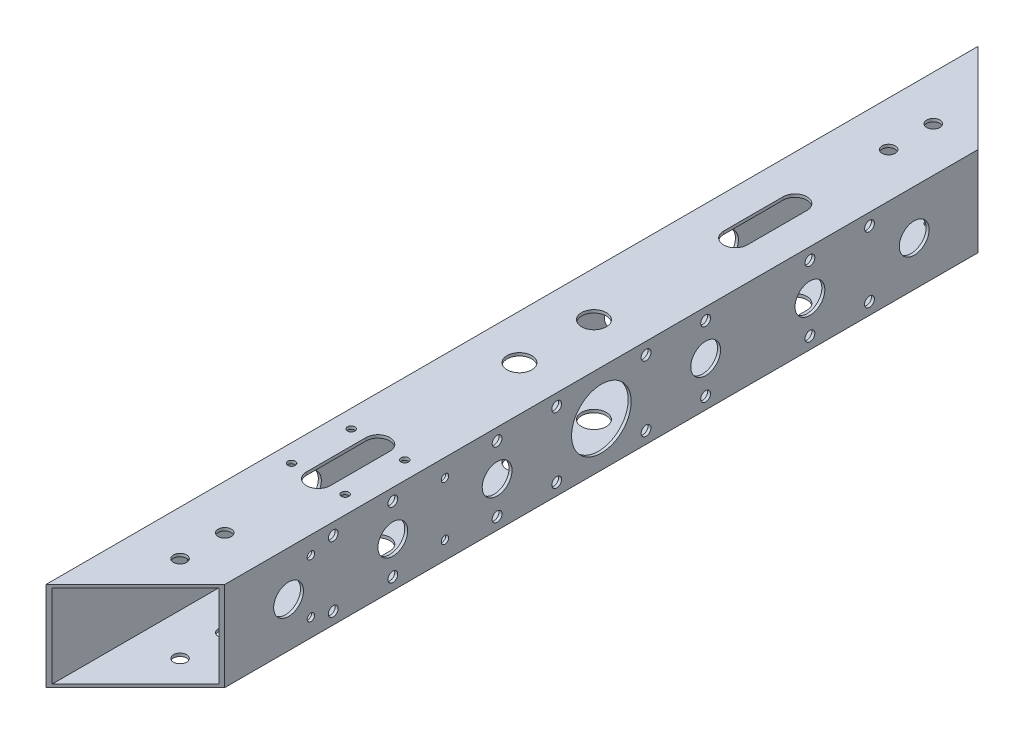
ISO-10303-21;
HEADER;
FILE_DESCRIPTION(('STEP AP214'),'2;1');
FILE_NAME('part.step','',(''),(''),'','','');
FILE_SCHEMA(('AUTOMOTIVE_DESIGN { 1 0 10303 214 1 1 1 1 }'));
ENDSEC;
DATA;
#1=APPLICATION_CONTEXT('core data for automotive mechanical design processes');
#2=APPLICATION_PROTOCOL_DEFINITION('international standard','automotive_design',2000,#1);
#3=PRODUCT_CONTEXT('',#1,'mechanical');
#4=PRODUCT('Part','Part','',(#3));
#5=PRODUCT_RELATED_PRODUCT_CATEGORY('part','',(#4));
#6=PRODUCT_DEFINITION_FORMATION('','',#4);
#7=PRODUCT_DEFINITION_CONTEXT('part definition',#1,'design');
#8=PRODUCT_DEFINITION('design','',#6,#7);
#9=PRODUCT_DEFINITION_SHAPE('','',#8);
#10=(LENGTH_UNIT() NAMED_UNIT(*) SI_UNIT(.MILLI.,.METRE.));
#11=(NAMED_UNIT(*) PLANE_ANGLE_UNIT() SI_UNIT($,.RADIAN.));
#12=(NAMED_UNIT(*) SI_UNIT($,.STERADIAN.) SOLID_ANGLE_UNIT());
#13=UNCERTAINTY_MEASURE_WITH_UNIT(LENGTH_MEASURE(1.E-05),#10,'distance_accuracy_value','');
#14=(GEOMETRIC_REPRESENTATION_CONTEXT(3) GLOBAL_UNCERTAINTY_ASSIGNED_CONTEXT((#13)) GLOBAL_UNIT_ASSIGNED_CONTEXT((#10,
#11,#12)) REPRESENTATION_CONTEXT('',''));
#15=CARTESIAN_POINT('',(0.,0.,0.));
#16=DIRECTION('',(0.,0.,1.));
#17=DIRECTION('',(1.,0.,0.));
#18=AXIS2_PLACEMENT_3D('',#15,#16,#17);
#19=CARTESIAN_POINT('',(4.,15.,201.42135623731));
#20=DIRECTION('',(1.,0.,0.));
#21=DIRECTION('',(0.,0.,-1.));
#22=AXIS2_PLACEMENT_3D('',#19,#20,#21);
#23=PLANE('',#22);
#24=DIRECTION('',(0.,0.,-1.));
#25=VECTOR('',#24,1.);
#26=CARTESIAN_POINT('',(4.,-14.,325.269119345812));
#27=LINE('',#26,#25);
#28=CARTESIAN_POINT('',(4.,-14.,221.42135623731));
#29=VERTEX_POINT('',#28);
#30=CARTESIAN_POINT('',(4.,-14.,201.42135623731));
#31=VERTEX_POINT('',#30);
#32=EDGE_CURVE('E539',#29,#31,#27,.T.);
#33=ORIENTED_EDGE('',*,*,#32,.T.);
#34=DIRECTION('',(0.,-1.,0.));
#35=VECTOR('',#34,1.);
#36=CARTESIAN_POINT('',(4.,15.,201.42135623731));
#37=LINE('',#36,#35);
#38=CARTESIAN_POINT('',(4.,-15.,201.42135623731));
#39=VERTEX_POINT('',#38);
#40=EDGE_CURVE('E718',#31,#39,#37,.T.);
#41=ORIENTED_EDGE('',*,*,#40,.T.);
#42=DIRECTION('',(0.,0.,1.));
#43=VECTOR('',#42,1.);
#44=CARTESIAN_POINT('',(4.,-15.,201.42135623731));
#45=LINE('',#44,#43);
#46=CARTESIAN_POINT('',(4.,-15.,221.42135623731));
#47=VERTEX_POINT('',#46);
#48=EDGE_CURVE('E486',#39,#47,#45,.T.);
#49=ORIENTED_EDGE('',*,*,#48,.T.);
#50=DIRECTION('',(0.,-1.,0.));
#51=VECTOR('',#50,1.);
#52=CARTESIAN_POINT('',(4.,15.,221.42135623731));
#53=LINE('',#52,#51);
#54=EDGE_CURVE('E11',#29,#47,#53,.T.);
#55=ORIENTED_EDGE('',*,*,#54,.F.);
#56=EDGE_LOOP('',(#33,#41,#49,#55));
#57=FACE_BOUND('',#56,.T.);
#58=ADVANCED_FACE('F17',(#57),#23,.F.);
#59=CARTESIAN_POINT('',(0.,15.,221.42135623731));
#60=DIRECTION('',(0.,-1.,0.));
#61=DIRECTION('',(0.,0.,-1.));
#62=AXIS2_PLACEMENT_3D('',#59,#60,#61);
#63=CYLINDRICAL_SURFACE('',#62,4.);
#64=CARTESIAN_POINT('',(0.,-14.,221.42135623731));
#65=DIRECTION('',(0.,1.,0.));
#66=DIRECTION('',(0.,0.,1.));
#67=AXIS2_PLACEMENT_3D('',#64,#65,#66);
#68=CIRCLE('',#67,4.);
#69=CARTESIAN_POINT('',(-4.,-14.,221.42135623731));
#70=VERTEX_POINT('',#69);
#71=EDGE_CURVE('E534',#70,#29,#68,.T.);
#72=ORIENTED_EDGE('',*,*,#71,.T.);
#73=ORIENTED_EDGE('',*,*,#54,.T.);
#74=CARTESIAN_POINT('',(0.,-15.,221.42135623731));
#75=DIRECTION('',(0.,-1.,0.));
#76=DIRECTION('',(0.,0.,-1.));
#77=AXIS2_PLACEMENT_3D('',#74,#75,#76);
#78=CIRCLE('',#77,4.);
#79=CARTESIAN_POINT('',(-4.,-15.,221.42135623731));
#80=VERTEX_POINT('',#79);
#81=EDGE_CURVE('E567',#47,#80,#78,.T.);
#82=ORIENTED_EDGE('',*,*,#81,.T.);
#83=DIRECTION('',(0.,-1.,0.));
#84=VECTOR('',#83,1.);
#85=CARTESIAN_POINT('',(-4.,15.,221.42135623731));
#86=LINE('',#85,#84);
#87=EDGE_CURVE('E25',#70,#80,#86,.T.);
#88=ORIENTED_EDGE('',*,*,#87,.F.);
#89=EDGE_LOOP('',(#72,#73,#82,#88));
#90=FACE_BOUND('',#89,.T.);
#91=ADVANCED_FACE('F708',(#90),#63,.F.);
#92=CARTESIAN_POINT('',(-4.,15.,201.42135623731));
#93=DIRECTION('',(-1.,0.,0.));
#94=DIRECTION('',(0.,1.,0.));
#95=AXIS2_PLACEMENT_3D('',#92,#93,#94);
#96=PLANE('',#95);
#97=DIRECTION('',(0.,0.,1.));
#98=VECTOR('',#97,1.);
#99=CARTESIAN_POINT('',(-4.,-14.,325.269119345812));
#100=LINE('',#99,#98);
#101=CARTESIAN_POINT('',(-4.,-14.,201.42135623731));
#102=VERTEX_POINT('',#101);
#103=EDGE_CURVE('E538',#102,#70,#100,.T.);
#104=ORIENTED_EDGE('',*,*,#103,.T.);
#105=ORIENTED_EDGE('',*,*,#87,.T.);
#106=DIRECTION('',(0.,0.,-1.));
#107=VECTOR('',#106,1.);
#108=CARTESIAN_POINT('',(-4.,-15.,201.42135623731));
#109=LINE('',#108,#107);
#110=CARTESIAN_POINT('',(-4.,-15.,201.42135623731));
#111=VERTEX_POINT('',#110);
#112=EDGE_CURVE('E490',#80,#111,#109,.T.);
#113=ORIENTED_EDGE('',*,*,#112,.T.);
#114=DIRECTION('',(0.,-1.,0.));
#115=VECTOR('',#114,1.);
#116=CARTESIAN_POINT('',(-4.,15.,201.42135623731));
#117=LINE('',#116,#115);
#118=EDGE_CURVE('E453',#102,#111,#117,.T.);
#119=ORIENTED_EDGE('',*,*,#118,.F.);
#120=EDGE_LOOP('',(#104,#105,#113,#119));
#121=FACE_BOUND('',#120,.T.);
#122=ADVANCED_FACE('F701',(#121),#96,.F.);
#123=CARTESIAN_POINT('',(-4.,15.,81.4213562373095));
#124=DIRECTION('',(-1.,0.,0.));
#125=DIRECTION('',(0.,0.,1.));
#126=AXIS2_PLACEMENT_3D('',#123,#124,#125);
#127=PLANE('',#126);
#128=DIRECTION('',(0.,0.,1.));
#129=VECTOR('',#128,1.);
#130=CARTESIAN_POINT('',(-4.,-14.,325.269119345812));
#131=LINE('',#130,#129);
#132=CARTESIAN_POINT('',(-4.,-14.,61.4213562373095));
#133=VERTEX_POINT('',#132);
#134=CARTESIAN_POINT('',(-4.,-14.,81.4213562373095));
#135=VERTEX_POINT('',#134);
#136=EDGE_CURVE('E639',#133,#135,#131,.T.);
#137=ORIENTED_EDGE('',*,*,#136,.T.);
#138=DIRECTION('',(0.,-1.,0.));
#139=VECTOR('',#138,1.);
#140=CARTESIAN_POINT('',(-4.,15.,81.4213562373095));
#141=LINE('',#140,#139);
#142=CARTESIAN_POINT('',(-4.,-15.,81.4213562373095));
#143=VERTEX_POINT('',#142);
#144=EDGE_CURVE('E682',#135,#143,#141,.T.);
#145=ORIENTED_EDGE('',*,*,#144,.T.);
#146=DIRECTION('',(0.,0.,-1.));
#147=VECTOR('',#146,1.);
#148=CARTESIAN_POINT('',(-4.,-15.,81.4213562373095));
#149=LINE('',#148,#147);
#150=CARTESIAN_POINT('',(-4.,-15.,61.4213562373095));
#151=VERTEX_POINT('',#150);
#152=EDGE_CURVE('E571',#143,#151,#149,.T.);
#153=ORIENTED_EDGE('',*,*,#152,.T.);
#154=DIRECTION('',(0.,-1.,0.));
#155=VECTOR('',#154,1.);
#156=CARTESIAN_POINT('',(-4.,15.,61.4213562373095));
#157=LINE('',#156,#155);
#158=EDGE_CURVE('E457',#133,#151,#157,.T.);
#159=ORIENTED_EDGE('',*,*,#158,.F.);
#160=EDGE_LOOP('',(#137,#145,#153,#159));
#161=FACE_BOUND('',#160,.T.);
#162=ADVANCED_FACE('F1103',(#161),#127,.F.);
#163=CARTESIAN_POINT('',(4.,15.,81.4213562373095));
#164=DIRECTION('',(1.,0.,0.));
#165=DIRECTION('',(0.,0.,1.));
#166=AXIS2_PLACEMENT_3D('',#163,#164,#165);
#167=PLANE('',#166);
#168=DIRECTION('',(0.,0.,-1.));
#169=VECTOR('',#168,1.);
#170=CARTESIAN_POINT('',(4.,-14.,325.269119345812));
#171=LINE('',#170,#169);
#172=CARTESIAN_POINT('',(4.,-14.,81.4213562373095));
#173=VERTEX_POINT('',#172);
#174=CARTESIAN_POINT('',(4.,-14.,61.4213562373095));
#175=VERTEX_POINT('',#174);
#176=EDGE_CURVE('E643',#173,#175,#171,.T.);
#177=ORIENTED_EDGE('',*,*,#176,.T.);
#178=DIRECTION('',(0.,-1.,0.));
#179=VECTOR('',#178,1.);
#180=CARTESIAN_POINT('',(4.,15.,61.4213562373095));
#181=LINE('',#180,#179);
#182=CARTESIAN_POINT('',(4.,-15.,61.4213562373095));
#183=VERTEX_POINT('',#182);
#184=EDGE_CURVE('E1052',#175,#183,#181,.T.);
#185=ORIENTED_EDGE('',*,*,#184,.T.);
#186=DIRECTION('',(0.,0.,1.));
#187=VECTOR('',#186,1.);
#188=CARTESIAN_POINT('',(4.,-15.,81.4213562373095));
#189=LINE('',#188,#187);
#190=CARTESIAN_POINT('',(4.,-15.,81.4213562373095));
#191=VERTEX_POINT('',#190);
#192=EDGE_CURVE('E264',#183,#191,#189,.T.);
#193=ORIENTED_EDGE('',*,*,#192,.T.);
#194=DIRECTION('',(0.,-1.,0.));
#195=VECTOR('',#194,1.);
#196=CARTESIAN_POINT('',(4.,15.,81.4213562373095));
#197=LINE('',#196,#195);
#198=EDGE_CURVE('E694',#173,#191,#197,.T.);
#199=ORIENTED_EDGE('',*,*,#198,.F.);
#200=EDGE_LOOP('',(#177,#185,#193,#199));
#201=FACE_BOUND('',#200,.T.);
#202=ADVANCED_FACE('F1107',(#201),#167,.F.);
#203=CARTESIAN_POINT('',(0.,15.,81.4213562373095));
#204=DIRECTION('',(0.,-1.,0.));
#205=DIRECTION('',(0.,0.,-1.));
#206=AXIS2_PLACEMENT_3D('',#203,#204,#205);
#207=CYLINDRICAL_SURFACE('',#206,4.);
#208=CARTESIAN_POINT('',(0.,-14.,81.4213562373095));
#209=DIRECTION('',(0.,1.,0.));
#210=DIRECTION('',(0.,0.,1.));
#211=AXIS2_PLACEMENT_3D('',#208,#209,#210);
#212=CIRCLE('',#211,4.);
#213=EDGE_CURVE('E635',#135,#173,#212,.T.);
#214=ORIENTED_EDGE('',*,*,#213,.T.);
#215=ORIENTED_EDGE('',*,*,#198,.T.);
#216=CARTESIAN_POINT('',(0.,-15.,81.4213562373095));
#217=DIRECTION('',(0.,-1.,0.));
#218=DIRECTION('',(0.,0.,1.));
#219=AXIS2_PLACEMENT_3D('',#216,#217,#218);
#220=CIRCLE('',#219,4.);
#221=EDGE_CURVE('E271',#191,#143,#220,.T.);
#222=ORIENTED_EDGE('',*,*,#221,.T.);
#223=ORIENTED_EDGE('',*,*,#144,.F.);
#224=EDGE_LOOP('',(#214,#215,#222,#223));
#225=FACE_BOUND('',#224,.T.);
#226=ADVANCED_FACE('F1091',(#225),#207,.F.);
#227=CARTESIAN_POINT('',(-4.,15.,201.42135623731));
#228=DIRECTION('',(-1.,0.,0.));
#229=DIRECTION('',(0.,1.,0.));
#230=AXIS2_PLACEMENT_3D('',#227,#228,#229);
#231=PLANE('',#230);
#232=DIRECTION('',(0.,0.,-1.));
#233=VECTOR('',#232,1.);
#234=CARTESIAN_POINT('',(-4.,14.,325.269119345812));
#235=LINE('',#234,#233);
#236=CARTESIAN_POINT('',(-4.,14.,221.42135623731));
#237=VERTEX_POINT('',#236);
#238=CARTESIAN_POINT('',(-4.,14.,201.42135623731));
#239=VERTEX_POINT('',#238);
#240=EDGE_CURVE('E659',#237,#239,#235,.T.);
#241=ORIENTED_EDGE('',*,*,#240,.T.);
#242=DIRECTION('',(0.,-1.,0.));
#243=VECTOR('',#242,1.);
#244=CARTESIAN_POINT('',(-4.,15.,201.42135623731));
#245=LINE('',#244,#243);
#246=CARTESIAN_POINT('',(-4.,15.,201.42135623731));
#247=VERTEX_POINT('',#246);
#248=EDGE_CURVE('E693',#247,#239,#245,.T.);
#249=ORIENTED_EDGE('',*,*,#248,.F.);
#250=DIRECTION('',(0.,0.,-1.));
#251=VECTOR('',#250,1.);
#252=CARTESIAN_POINT('',(-4.,15.,201.42135623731));
#253=LINE('',#252,#251);
#254=CARTESIAN_POINT('',(-4.,15.,221.42135623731));
#255=VERTEX_POINT('',#254);
#256=EDGE_CURVE('E478',#255,#247,#253,.T.);
#257=ORIENTED_EDGE('',*,*,#256,.F.);
#258=DIRECTION('',(0.,-1.,0.));
#259=VECTOR('',#258,1.);
#260=CARTESIAN_POINT('',(-4.,15.,221.42135623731));
#261=LINE('',#260,#259);
#262=EDGE_CURVE('E690',#255,#237,#261,.T.);
#263=ORIENTED_EDGE('',*,*,#262,.T.);
#264=EDGE_LOOP('',(#241,#249,#257,#263));
#265=FACE_BOUND('',#264,.T.);
#266=ADVANCED_FACE('F1071',(#265),#231,.F.);
#267=CARTESIAN_POINT('',(0.,15.,221.42135623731));
#268=DIRECTION('',(0.,-1.,0.));
#269=DIRECTION('',(0.,0.,-1.));
#270=AXIS2_PLACEMENT_3D('',#267,#268,#269);
#271=CYLINDRICAL_SURFACE('',#270,4.);
#272=CARTESIAN_POINT('',(0.,14.,221.42135623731));
#273=DIRECTION('',(0.,-1.,0.));
#274=DIRECTION('',(0.,0.,-1.));
#275=AXIS2_PLACEMENT_3D('',#272,#273,#274);
#276=CIRCLE('',#275,4.);
#277=CARTESIAN_POINT('',(4.,14.,221.42135623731));
#278=VERTEX_POINT('',#277);
#279=EDGE_CURVE('E663',#278,#237,#276,.T.);
#280=ORIENTED_EDGE('',*,*,#279,.T.);
#281=ORIENTED_EDGE('',*,*,#262,.F.);
#282=CARTESIAN_POINT('',(0.,15.,221.42135623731));
#283=DIRECTION('',(0.,-1.,0.));
#284=DIRECTION('',(0.,0.,-1.));
#285=AXIS2_PLACEMENT_3D('',#282,#283,#284);
#286=CIRCLE('',#285,4.);
#287=CARTESIAN_POINT('',(4.,15.,221.42135623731));
#288=VERTEX_POINT('',#287);
#289=EDGE_CURVE('E593',#288,#255,#286,.T.);
#290=ORIENTED_EDGE('',*,*,#289,.F.);
#291=DIRECTION('',(0.,-1.,0.));
#292=VECTOR('',#291,1.);
#293=CARTESIAN_POINT('',(4.,15.,221.42135623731));
#294=LINE('',#293,#292);
#295=EDGE_CURVE('E687',#288,#278,#294,.T.);
#296=ORIENTED_EDGE('',*,*,#295,.T.);
#297=EDGE_LOOP('',(#280,#281,#290,#296));
#298=FACE_BOUND('',#297,.T.);
#299=ADVANCED_FACE('F1081',(#298),#271,.F.);
#300=CARTESIAN_POINT('',(4.,15.,201.42135623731));
#301=DIRECTION('',(1.,0.,0.));
#302=DIRECTION('',(0.,0.,-1.));
#303=AXIS2_PLACEMENT_3D('',#300,#301,#302);
#304=PLANE('',#303);
#305=DIRECTION('',(0.,0.,1.));
#306=VECTOR('',#305,1.);
#307=CARTESIAN_POINT('',(4.,14.,325.269119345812));
#308=LINE('',#307,#306);
#309=CARTESIAN_POINT('',(4.,14.,201.42135623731));
#310=VERTEX_POINT('',#309);
#311=EDGE_CURVE('E506',#310,#278,#308,.T.);
#312=ORIENTED_EDGE('',*,*,#311,.T.);
#313=ORIENTED_EDGE('',*,*,#295,.F.);
#314=DIRECTION('',(0.,0.,1.));
#315=VECTOR('',#314,1.);
#316=CARTESIAN_POINT('',(4.,15.,201.42135623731));
#317=LINE('',#316,#315);
#318=CARTESIAN_POINT('',(4.,15.,201.42135623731));
#319=VERTEX_POINT('',#318);
#320=EDGE_CURVE('E482',#319,#288,#317,.T.);
#321=ORIENTED_EDGE('',*,*,#320,.F.);
#322=DIRECTION('',(0.,-1.,0.));
#323=VECTOR('',#322,1.);
#324=CARTESIAN_POINT('',(4.,15.,201.42135623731));
#325=LINE('',#324,#323);
#326=EDGE_CURVE('E281',#319,#310,#325,.T.);
#327=ORIENTED_EDGE('',*,*,#326,.T.);
#328=EDGE_LOOP('',(#312,#313,#321,#327));
#329=FACE_BOUND('',#328,.T.);
#330=ADVANCED_FACE('F1078',(#329),#304,.F.);
#331=CARTESIAN_POINT('',(0.,15.,81.4213562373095));
#332=DIRECTION('',(0.,-1.,0.));
#333=DIRECTION('',(0.,0.,-1.));
#334=AXIS2_PLACEMENT_3D('',#331,#332,#333);
#335=CYLINDRICAL_SURFACE('',#334,4.);
#336=CARTESIAN_POINT('',(0.,14.,81.4213562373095));
#337=DIRECTION('',(0.,-1.,0.));
#338=DIRECTION('',(0.,0.,-1.));
#339=AXIS2_PLACEMENT_3D('',#336,#337,#338);
#340=CIRCLE('',#339,4.);
#341=CARTESIAN_POINT('',(4.,14.,81.4213562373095));
#342=VERTEX_POINT('',#341);
#343=CARTESIAN_POINT('',(-4.,14.,81.4213562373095));
#344=VERTEX_POINT('',#343);
#345=EDGE_CURVE('E501',#342,#344,#340,.T.);
#346=ORIENTED_EDGE('',*,*,#345,.T.);
#347=DIRECTION('',(0.,-1.,0.));
#348=VECTOR('',#347,1.);
#349=CARTESIAN_POINT('',(-4.,15.,81.4213562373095));
#350=LINE('',#349,#348);
#351=CARTESIAN_POINT('',(-4.,15.,81.4213562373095));
#352=VERTEX_POINT('',#351);
#353=EDGE_CURVE('E49',#352,#344,#350,.T.);
#354=ORIENTED_EDGE('',*,*,#353,.F.);
#355=CARTESIAN_POINT('',(0.,15.,81.4213562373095));
#356=DIRECTION('',(0.,-1.,0.));
#357=DIRECTION('',(0.,0.,1.));
#358=AXIS2_PLACEMENT_3D('',#355,#356,#357);
#359=CIRCLE('',#358,4.);
#360=CARTESIAN_POINT('',(4.,15.,81.4213562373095));
#361=VERTEX_POINT('',#360);
#362=EDGE_CURVE('E601',#361,#352,#359,.T.);
#363=ORIENTED_EDGE('',*,*,#362,.F.);
#364=DIRECTION('',(0.,-1.,0.));
#365=VECTOR('',#364,1.);
#366=CARTESIAN_POINT('',(4.,15.,81.4213562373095));
#367=LINE('',#366,#365);
#368=EDGE_CURVE('E386',#361,#342,#367,.T.);
#369=ORIENTED_EDGE('',*,*,#368,.T.);
#370=EDGE_LOOP('',(#346,#354,#363,#369));
#371=FACE_BOUND('',#370,.T.);
#372=ADVANCED_FACE('F1089',(#371),#335,.F.);
#373=CARTESIAN_POINT('',(4.,15.,81.4213562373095));
#374=DIRECTION('',(1.,0.,0.));
#375=DIRECTION('',(0.,0.,1.));
#376=AXIS2_PLACEMENT_3D('',#373,#374,#375);
#377=PLANE('',#376);
#378=DIRECTION('',(0.,0.,1.));
#379=VECTOR('',#378,1.);
#380=CARTESIAN_POINT('',(4.,14.,325.269119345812));
#381=LINE('',#380,#379);
#382=CARTESIAN_POINT('',(4.,14.,61.4213562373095));
#383=VERTEX_POINT('',#382);
#384=EDGE_CURVE('E505',#383,#342,#381,.T.);
#385=ORIENTED_EDGE('',*,*,#384,.T.);
#386=ORIENTED_EDGE('',*,*,#368,.F.);
#387=DIRECTION('',(0.,0.,1.));
#388=VECTOR('',#387,1.);
#389=CARTESIAN_POINT('',(4.,15.,81.4213562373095));
#390=LINE('',#389,#388);
#391=CARTESIAN_POINT('',(4.,15.,61.4213562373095));
#392=VERTEX_POINT('',#391);
#393=EDGE_CURVE('E597',#392,#361,#390,.T.);
#394=ORIENTED_EDGE('',*,*,#393,.F.);
#395=DIRECTION('',(0.,-1.,0.));
#396=VECTOR('',#395,1.);
#397=CARTESIAN_POINT('',(4.,15.,61.4213562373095));
#398=LINE('',#397,#396);
#399=EDGE_CURVE('E296',#392,#383,#398,.T.);
#400=ORIENTED_EDGE('',*,*,#399,.T.);
#401=EDGE_LOOP('',(#385,#386,#394,#400));
#402=FACE_BOUND('',#401,.T.);
#403=ADVANCED_FACE('F1112',(#402),#377,.F.);
#404=CARTESIAN_POINT('',(-4.,15.,81.4213562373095));
#405=DIRECTION('',(-1.,0.,0.));
#406=DIRECTION('',(0.,0.,1.));
#407=AXIS2_PLACEMENT_3D('',#404,#405,#406);
#408=PLANE('',#407);
#409=DIRECTION('',(0.,0.,-1.));
#410=VECTOR('',#409,1.);
#411=CARTESIAN_POINT('',(-4.,14.,325.269119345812));
#412=LINE('',#411,#410);
#413=CARTESIAN_POINT('',(-4.,14.,61.4213562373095));
#414=VERTEX_POINT('',#413);
#415=EDGE_CURVE('E670',#344,#414,#412,.T.);
#416=ORIENTED_EDGE('',*,*,#415,.T.);
#417=DIRECTION('',(0.,-1.,0.));
#418=VECTOR('',#417,1.);
#419=CARTESIAN_POINT('',(-4.,15.,61.4213562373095));
#420=LINE('',#419,#418);
#421=CARTESIAN_POINT('',(-4.,15.,61.4213562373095));
#422=VERTEX_POINT('',#421);
#423=EDGE_CURVE('E387',#422,#414,#420,.T.);
#424=ORIENTED_EDGE('',*,*,#423,.F.);
#425=DIRECTION('',(0.,0.,-1.));
#426=VECTOR('',#425,1.);
#427=CARTESIAN_POINT('',(-4.,15.,81.4213562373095));
#428=LINE('',#427,#426);
#429=EDGE_CURVE('E605',#352,#422,#428,.T.);
#430=ORIENTED_EDGE('',*,*,#429,.F.);
#431=ORIENTED_EDGE('',*,*,#353,.T.);
#432=EDGE_LOOP('',(#416,#424,#430,#431));
#433=FACE_BOUND('',#432,.T.);
#434=ADVANCED_FACE('F1115',(#433),#408,.F.);
#435=CARTESIAN_POINT('',(141.421356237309,-15.,141.421356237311));
#436=DIRECTION('',(0.707106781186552,0.,-0.707106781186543));
#437=DIRECTION('',(0.,-1.,0.));
#438=AXIS2_PLACEMENT_3D('',#435,#436,#437);
#439=PLANE('',#438);
#440=DIRECTION('',(0.,-1.,0.));
#441=VECTOR('',#440,1.);
#442=CARTESIAN_POINT('',(-14.,-15.,-14.0000000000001));
#443=LINE('',#442,#441);
#444=CARTESIAN_POINT('',(-14.,14.,-14.0000000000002));
#445=VERTEX_POINT('',#444);
#446=CARTESIAN_POINT('',(-14.,-14.,-14.0000000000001));
#447=VERTEX_POINT('',#446);
#448=EDGE_CURVE('E246',#445,#447,#443,.T.);
#449=ORIENTED_EDGE('',*,*,#448,.T.);
#450=DIRECTION('',(-0.707106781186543,0.,-0.707106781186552));
#451=VECTOR('',#450,1.);
#452=CARTESIAN_POINT('',(155.634559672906,-14.,155.634559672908));
#453=LINE('',#452,#451);
#454=CARTESIAN_POINT('',(14.,-14.,14.0000000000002));
#455=VERTEX_POINT('',#454);
#456=EDGE_CURVE('E620',#455,#447,#453,.T.);
#457=ORIENTED_EDGE('',*,*,#456,.F.);
#458=DIRECTION('',(0.,-1.,0.));
#459=VECTOR('',#458,1.);
#460=CARTESIAN_POINT('',(14.,-14.,14.0000000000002));
#461=LINE('',#460,#459);
#462=CARTESIAN_POINT('',(14.,14.,14.0000000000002));
#463=VERTEX_POINT('',#462);
#464=EDGE_CURVE('E673',#463,#455,#461,.T.);
#465=ORIENTED_EDGE('',*,*,#464,.F.);
#466=DIRECTION('',(0.707106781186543,0.,0.707106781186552));
#467=VECTOR('',#466,1.);
#468=CARTESIAN_POINT('',(155.634559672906,14.,155.634559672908));
#469=LINE('',#468,#467);
#470=EDGE_CURVE('E658',#445,#463,#469,.T.);
#471=ORIENTED_EDGE('',*,*,#470,.F.);
#472=EDGE_LOOP('',(#449,#457,#465,#471));
#473=FACE_BOUND('',#472,.T.);
#474=DIRECTION('',(0.,1.,0.));
#475=VECTOR('',#474,1.);
#476=CARTESIAN_POINT('',(-15.,-15.,-15.));
#477=LINE('',#476,#475);
#478=CARTESIAN_POINT('',(-15.,-15.,-15.));
#479=VERTEX_POINT('',#478);
#480=CARTESIAN_POINT('',(-15.,15.,-15.));
#481=VERTEX_POINT('',#480);
#482=EDGE_CURVE('E235',#479,#481,#477,.T.);
#483=ORIENTED_EDGE('',*,*,#482,.T.);
#484=DIRECTION('',(-0.707106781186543,0.,-0.707106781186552));
#485=VECTOR('',#484,1.);
#486=CARTESIAN_POINT('',(141.421356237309,15.,141.421356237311));
#487=LINE('',#486,#485);
#488=CARTESIAN_POINT('',(15.,15.,15.0000000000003));
#489=VERTEX_POINT('',#488);
#490=EDGE_CURVE('E239',#489,#481,#487,.T.);
#491=ORIENTED_EDGE('',*,*,#490,.F.);
#492=DIRECTION('',(0.,1.,0.));
#493=VECTOR('',#492,1.);
#494=CARTESIAN_POINT('',(15.,-15.,15.0000000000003));
#495=LINE('',#494,#493);
#496=CARTESIAN_POINT('',(15.,-15.,15.0000000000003));
#497=VERTEX_POINT('',#496);
#498=EDGE_CURVE('E609',#497,#489,#495,.T.);
#499=ORIENTED_EDGE('',*,*,#498,.F.);
#500=DIRECTION('',(-0.707106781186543,0.,-0.707106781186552));
#501=VECTOR('',#500,1.);
#502=CARTESIAN_POINT('',(141.421356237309,-15.,141.421356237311));
#503=LINE('',#502,#501);
#504=EDGE_CURVE('E241',#497,#479,#503,.T.);
#505=ORIENTED_EDGE('',*,*,#504,.T.);
#506=EDGE_LOOP('',(#483,#491,#499,#505));
#507=FACE_BOUND('',#506,.T.);
#508=ADVANCED_FACE('F237',(#473,#507),#439,.T.);
#509=CARTESIAN_POINT('',(-14.,-14.,325.269119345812));
#510=DIRECTION('',(1.,0.,0.));
#511=DIRECTION('',(0.,1.,0.));
#512=AXIS2_PLACEMENT_3D('',#509,#510,#511);
#513=PLANE('',#512);
#514=CARTESIAN_POINT('',(-14.,0.,141.421356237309));
#515=DIRECTION('',(1.,0.,0.));
#516=DIRECTION('',(0.,0.,-1.));
#517=AXIS2_PLACEMENT_3D('',#514,#515,#516);
#518=CIRCLE('',#517,10.);
#519=CARTESIAN_POINT('',(-14.,0.,131.421356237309));
#520=VERTEX_POINT('',#519);
#521=EDGE_CURVE('E528',#520,#520,#518,.T.);
#522=ORIENTED_EDGE('',*,*,#521,.F.);
#523=EDGE_LOOP('',(#522));
#524=FACE_BOUND('',#523,.T.);
#525=CARTESIAN_POINT('',(-14.,-2.4440369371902E-13,106.421356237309));
#526=DIRECTION('',(1.,0.,0.));
#527=DIRECTION('',(0.,0.,-1.));
#528=AXIS2_PLACEMENT_3D('',#525,#526,#527);
#529=CIRCLE('',#528,5.);
#530=CARTESIAN_POINT('',(-14.,-2.4440369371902E-13,101.421356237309));
#531=VERTEX_POINT('',#530);
#532=EDGE_CURVE('E523',#531,#531,#529,.T.);
#533=ORIENTED_EDGE('',*,*,#532,.F.);
#534=EDGE_LOOP('',(#533));
#535=FACE_BOUND('',#534,.T.);
#536=CARTESIAN_POINT('',(-14.,0.,246.42135623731));
#537=DIRECTION('',(1.,0.,0.));
#538=DIRECTION('',(0.,0.,-1.));
#539=AXIS2_PLACEMENT_3D('',#536,#537,#538);
#540=CIRCLE('',#539,5.);
#541=CARTESIAN_POINT('',(-14.,0.,241.42135623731));
#542=VERTEX_POINT('',#541);
#543=EDGE_CURVE('E515',#542,#542,#540,.T.);
#544=ORIENTED_EDGE('',*,*,#543,.F.);
#545=EDGE_LOOP('',(#544));
#546=FACE_BOUND('',#545,.T.);
#547=CARTESIAN_POINT('',(-14.,0.,211.421356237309));
#548=DIRECTION('',(1.,0.,0.));
#549=DIRECTION('',(0.,0.,-1.));
#550=AXIS2_PLACEMENT_3D('',#547,#548,#549);
#551=CIRCLE('',#550,5.);
#552=CARTESIAN_POINT('',(-14.,0.,206.421356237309));
#553=VERTEX_POINT('',#552);
#554=EDGE_CURVE('E507',#553,#553,#551,.T.);
#555=ORIENTED_EDGE('',*,*,#554,.F.);
#556=EDGE_LOOP('',(#555));
#557=FACE_BOUND('',#556,.T.);
#558=CARTESIAN_POINT('',(-14.,0.,176.421356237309));
#559=DIRECTION('',(1.,0.,0.));
#560=DIRECTION('',(0.,0.,-1.));
#561=AXIS2_PLACEMENT_3D('',#558,#559,#560);
#562=CIRCLE('',#561,5.);
#563=CARTESIAN_POINT('',(-14.,0.,171.421356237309));
#564=VERTEX_POINT('',#563);
#565=EDGE_CURVE('E290',#564,#564,#562,.T.);
#566=ORIENTED_EDGE('',*,*,#565,.F.);
#567=EDGE_LOOP('',(#566));
#568=FACE_BOUND('',#567,.T.);
#569=CARTESIAN_POINT('',(-14.,-4.88807387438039E-13,71.4213562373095));
#570=DIRECTION('',(1.,0.,0.));
#571=DIRECTION('',(0.,0.,-1.));
#572=AXIS2_PLACEMENT_3D('',#569,#570,#571);
#573=CIRCLE('',#572,5.);
#574=CARTESIAN_POINT('',(-14.,-4.88807387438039E-13,66.4213562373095));
#575=VERTEX_POINT('',#574);
#576=EDGE_CURVE('E291',#575,#575,#573,.T.);
#577=ORIENTED_EDGE('',*,*,#576,.F.);
#578=EDGE_LOOP('',(#577));
#579=FACE_BOUND('',#578,.T.);
#580=CARTESIAN_POINT('',(-14.,-7.33211081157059E-13,36.4213562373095));
#581=DIRECTION('',(1.,0.,0.));
#582=DIRECTION('',(0.,0.,-1.));
#583=AXIS2_PLACEMENT_3D('',#580,#581,#582);
#584=CIRCLE('',#583,5.);
#585=CARTESIAN_POINT('',(-14.,-7.33211081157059E-13,31.4213562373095));
#586=VERTEX_POINT('',#585);
#587=EDGE_CURVE('E474',#586,#586,#584,.T.);
#588=ORIENTED_EDGE('',*,*,#587,.F.);
#589=EDGE_LOOP('',(#588));
#590=FACE_BOUND('',#589,.T.);
#591=CARTESIAN_POINT('',(-14.,-11.,176.421356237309));
#592=DIRECTION('',(1.,0.,0.));
#593=DIRECTION('',(0.,0.,-1.));
#594=AXIS2_PLACEMENT_3D('',#591,#592,#593);
#595=CIRCLE('',#594,1.65);
#596=CARTESIAN_POINT('',(-14.,-11.,174.771356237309));
#597=VERTEX_POINT('',#596);
#598=EDGE_CURVE('E766',#597,#597,#595,.T.);
#599=ORIENTED_EDGE('',*,*,#598,.F.);
#600=EDGE_LOOP('',(#599));
#601=FACE_BOUND('',#600,.T.);
#602=CARTESIAN_POINT('',(-14.,11.0000000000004,231.42135623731));
#603=DIRECTION('',(1.,0.,0.));
#604=DIRECTION('',(0.,0.,-1.));
#605=AXIS2_PLACEMENT_3D('',#602,#603,#604);
#606=CIRCLE('',#605,1.65);
#607=CARTESIAN_POINT('',(-14.,11.0000000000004,229.771356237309));
#608=VERTEX_POINT('',#607);
#609=EDGE_CURVE('E1029',#608,#608,#606,.T.);
#610=ORIENTED_EDGE('',*,*,#609,.F.);
#611=EDGE_LOOP('',(#610));
#612=FACE_BOUND('',#611,.T.);
#613=CARTESIAN_POINT('',(-14.,11.,211.421356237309));
#614=DIRECTION('',(1.,0.,0.));
#615=DIRECTION('',(0.,0.,-1.));
#616=AXIS2_PLACEMENT_3D('',#613,#614,#615);
#617=CIRCLE('',#616,1.65000000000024);
#618=CARTESIAN_POINT('',(-14.,11.,209.771356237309));
#619=VERTEX_POINT('',#618);
#620=EDGE_CURVE('E932',#619,#619,#617,.T.);
#621=ORIENTED_EDGE('',*,*,#620,.F.);
#622=EDGE_LOOP('',(#621));
#623=FACE_BOUND('',#622,.T.);
#624=CARTESIAN_POINT('',(-14.,11.,176.421356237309));
#625=DIRECTION('',(1.,0.,0.));
#626=DIRECTION('',(0.,0.,-1.));
#627=AXIS2_PLACEMENT_3D('',#624,#625,#626);
#628=CIRCLE('',#627,1.65);
#629=CARTESIAN_POINT('',(-14.,11.,174.771356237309));
#630=VERTEX_POINT('',#629);
#631=EDGE_CURVE('E857',#630,#630,#628,.T.);
#632=ORIENTED_EDGE('',*,*,#631,.F.);
#633=EDGE_LOOP('',(#632));
#634=FACE_BOUND('',#633,.T.);
#635=CARTESIAN_POINT('',(-14.,11.,156.421356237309));
#636=DIRECTION('',(1.,0.,0.));
#637=DIRECTION('',(0.,0.,-1.));
#638=AXIS2_PLACEMENT_3D('',#635,#636,#637);
#639=CIRCLE('',#638,1.65);
#640=CARTESIAN_POINT('',(-14.,11.,154.771356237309));
#641=VERTEX_POINT('',#640);
#642=EDGE_CURVE('E1003',#641,#641,#639,.T.);
#643=ORIENTED_EDGE('',*,*,#642,.F.);
#644=EDGE_LOOP('',(#643));
#645=FACE_BOUND('',#644,.T.);
#646=CARTESIAN_POINT('',(-14.,11.,126.421356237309));
#647=DIRECTION('',(1.,0.,0.));
#648=DIRECTION('',(0.,0.,-1.));
#649=AXIS2_PLACEMENT_3D('',#646,#647,#648);
#650=CIRCLE('',#649,1.65);
#651=CARTESIAN_POINT('',(-14.,11.,124.771356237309));
#652=VERTEX_POINT('',#651);
#653=EDGE_CURVE('E907',#652,#652,#650,.T.);
#654=ORIENTED_EDGE('',*,*,#653,.F.);
#655=EDGE_LOOP('',(#654));
#656=FACE_BOUND('',#655,.T.);
#657=CARTESIAN_POINT('',(-14.,11.,106.421356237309));
#658=DIRECTION('',(1.,0.,0.));
#659=DIRECTION('',(0.,0.,-1.));
#660=AXIS2_PLACEMENT_3D('',#657,#658,#659);
#661=CIRCLE('',#660,1.65);
#662=CARTESIAN_POINT('',(-14.,11.,104.771356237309));
#663=VERTEX_POINT('',#662);
#664=EDGE_CURVE('E898',#663,#663,#661,.T.);
#665=ORIENTED_EDGE('',*,*,#664,.F.);
#666=EDGE_LOOP('',(#665));
#667=FACE_BOUND('',#666,.T.);
#668=CARTESIAN_POINT('',(-14.,11.,71.4213562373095));
#669=DIRECTION('',(1.,0.,0.));
#670=DIRECTION('',(0.,0.,-1.));
#671=AXIS2_PLACEMENT_3D('',#668,#669,#670);
#672=CIRCLE('',#671,1.65000000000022);
#673=CARTESIAN_POINT('',(-14.,11.,69.7713562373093));
#674=VERTEX_POINT('',#673);
#675=EDGE_CURVE('E899',#674,#674,#672,.T.);
#676=ORIENTED_EDGE('',*,*,#675,.F.);
#677=EDGE_LOOP('',(#676));
#678=FACE_BOUND('',#677,.T.);
#679=CARTESIAN_POINT('',(-14.,11.0000000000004,51.4213562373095));
#680=DIRECTION('',(1.,0.,0.));
#681=DIRECTION('',(0.,0.,-1.));
#682=AXIS2_PLACEMENT_3D('',#679,#680,#681);
#683=CIRCLE('',#682,1.65);
#684=CARTESIAN_POINT('',(-14.,11.0000000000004,49.7713562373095));
#685=VERTEX_POINT('',#684);
#686=EDGE_CURVE('E800',#685,#685,#683,.T.);
#687=ORIENTED_EDGE('',*,*,#686,.F.);
#688=EDGE_LOOP('',(#687));
#689=FACE_BOUND('',#688,.T.);
#690=CARTESIAN_POINT('',(-14.,-11.0000000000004,51.4213562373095));
#691=DIRECTION('',(1.,0.,0.));
#692=DIRECTION('',(0.,0.,-1.));
#693=AXIS2_PLACEMENT_3D('',#690,#691,#692);
#694=CIRCLE('',#693,1.65);
#695=CARTESIAN_POINT('',(-14.,-11.0000000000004,49.7713562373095));
#696=VERTEX_POINT('',#695);
#697=EDGE_CURVE('E801',#696,#696,#694,.T.);
#698=ORIENTED_EDGE('',*,*,#697,.F.);
#699=EDGE_LOOP('',(#698));
#700=FACE_BOUND('',#699,.T.);
#701=CARTESIAN_POINT('',(-14.,-11.,71.4213562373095));
#702=DIRECTION('',(1.,0.,0.));
#703=DIRECTION('',(0.,0.,-1.));
#704=AXIS2_PLACEMENT_3D('',#701,#702,#703);
#705=CIRCLE('',#704,1.65000000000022);
#706=CARTESIAN_POINT('',(-14.,-11.,69.7713562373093));
#707=VERTEX_POINT('',#706);
#708=EDGE_CURVE('E984',#707,#707,#705,.T.);
#709=ORIENTED_EDGE('',*,*,#708,.F.);
#710=EDGE_LOOP('',(#709));
#711=FACE_BOUND('',#710,.T.);
#712=CARTESIAN_POINT('',(-14.,-11.,106.421356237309));
#713=DIRECTION('',(1.,0.,0.));
#714=DIRECTION('',(0.,0.,-1.));
#715=AXIS2_PLACEMENT_3D('',#712,#713,#714);
#716=CIRCLE('',#715,1.65);
#717=CARTESIAN_POINT('',(-14.,-11.,104.771356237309));
#718=VERTEX_POINT('',#717);
#719=EDGE_CURVE('E973',#718,#718,#716,.T.);
#720=ORIENTED_EDGE('',*,*,#719,.F.);
#721=EDGE_LOOP('',(#720));
#722=FACE_BOUND('',#721,.T.);
#723=CARTESIAN_POINT('',(-14.,-11.,156.421356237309));
#724=DIRECTION('',(1.,0.,0.));
#725=DIRECTION('',(0.,0.,-1.));
#726=AXIS2_PLACEMENT_3D('',#723,#724,#725);
#727=CIRCLE('',#726,1.65);
#728=CARTESIAN_POINT('',(-14.,-11.,154.771356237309));
#729=VERTEX_POINT('',#728);
#730=EDGE_CURVE('E791',#729,#729,#727,.T.);
#731=ORIENTED_EDGE('',*,*,#730,.F.);
#732=EDGE_LOOP('',(#731));
#733=FACE_BOUND('',#732,.T.);
#734=CARTESIAN_POINT('',(-14.,-11.0000000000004,231.42135623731));
#735=DIRECTION('',(1.,0.,0.));
#736=DIRECTION('',(0.,0.,-1.));
#737=AXIS2_PLACEMENT_3D('',#734,#735,#736);
#738=CIRCLE('',#737,1.65);
#739=CARTESIAN_POINT('',(-14.,-11.0000000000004,229.771356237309));
#740=VERTEX_POINT('',#739);
#741=EDGE_CURVE('E792',#740,#740,#738,.T.);
#742=ORIENTED_EDGE('',*,*,#741,.F.);
#743=EDGE_LOOP('',(#742));
#744=FACE_BOUND('',#743,.T.);
#745=CARTESIAN_POINT('',(-14.,-11.,211.421356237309));
#746=DIRECTION('',(1.,0.,0.));
#747=DIRECTION('',(0.,0.,-1.));
#748=AXIS2_PLACEMENT_3D('',#745,#746,#747);
#749=CIRCLE('',#748,1.65000000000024);
#750=CARTESIAN_POINT('',(-14.,-11.,209.771356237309));
#751=VERTEX_POINT('',#750);
#752=EDGE_CURVE('E748',#751,#751,#749,.T.);
#753=ORIENTED_EDGE('',*,*,#752,.F.);
#754=EDGE_LOOP('',(#753));
#755=FACE_BOUND('',#754,.T.);
#756=CARTESIAN_POINT('',(-14.,-11.,126.421356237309));
#757=DIRECTION('',(1.,0.,0.));
#758=DIRECTION('',(0.,0.,-1.));
#759=AXIS2_PLACEMENT_3D('',#756,#757,#758);
#760=CIRCLE('',#759,1.65);
#761=CARTESIAN_POINT('',(-14.,-11.,124.771356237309));
#762=VERTEX_POINT('',#761);
#763=EDGE_CURVE('E915',#762,#762,#760,.T.);
#764=ORIENTED_EDGE('',*,*,#763,.F.);
#765=EDGE_LOOP('',(#764));
#766=FACE_BOUND('',#765,.T.);
#767=ORIENTED_EDGE('',*,*,#448,.F.);
#768=DIRECTION('',(0.,0.,-1.));
#769=VECTOR('',#768,1.);
#770=CARTESIAN_POINT('',(-14.,14.,325.269119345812));
#771=LINE('',#770,#769);
#772=CARTESIAN_POINT('',(-14.,14.,296.84271247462));
#773=VERTEX_POINT('',#772);
#774=EDGE_CURVE('E654',#773,#445,#771,.T.);
#775=ORIENTED_EDGE('',*,*,#774,.F.);
#776=DIRECTION('',(0.,1.,0.));
#777=VECTOR('',#776,1.);
#778=CARTESIAN_POINT('',(-14.,-15.,296.84271247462));
#779=LINE('',#778,#777);
#780=CARTESIAN_POINT('',(-14.,-14.,296.84271247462));
#781=VERTEX_POINT('',#780);
#782=EDGE_CURVE('E247',#781,#773,#779,.T.);
#783=ORIENTED_EDGE('',*,*,#782,.F.);
#784=DIRECTION('',(0.,0.,-1.));
#785=VECTOR('',#784,1.);
#786=CARTESIAN_POINT('',(-14.,-14.,325.269119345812));
#787=LINE('',#786,#785);
#788=EDGE_CURVE('E615',#781,#447,#787,.T.);
#789=ORIENTED_EDGE('',*,*,#788,.T.);
#790=EDGE_LOOP('',(#767,#775,#783,#789));
#791=FACE_BOUND('',#790,.T.);
#792=ADVANCED_FACE('F1121',(#524,#535,#546,#557,#568,#579,#590,#601,#612,#623,#634,#645,#656,
#667,#678,#689,#700,#711,#722,#733,#744,#755,#766,#791),#513,.T.);
#793=CARTESIAN_POINT('',(-15.,-15.,325.269119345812));
#794=DIRECTION('',(1.,0.,0.));
#795=DIRECTION('',(0.,1.,0.));
#796=AXIS2_PLACEMENT_3D('',#793,#794,#795);
#797=PLANE('',#796);
#798=CARTESIAN_POINT('',(-15.,0.,141.421356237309));
#799=DIRECTION('',(-1.,0.,0.));
#800=DIRECTION('',(0.,0.,1.));
#801=AXIS2_PLACEMENT_3D('',#798,#799,#800);
#802=CIRCLE('',#801,10.);
#803=CARTESIAN_POINT('',(-15.,0.,151.421356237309));
#804=VERTEX_POINT('',#803);
#805=EDGE_CURVE('E529',#804,#804,#802,.T.);
#806=ORIENTED_EDGE('',*,*,#805,.F.);
#807=EDGE_LOOP('',(#806));
#808=FACE_BOUND('',#807,.T.);
#809=CARTESIAN_POINT('',(-15.,-2.4440369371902E-13,106.421356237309));
#810=DIRECTION('',(-1.,0.,0.));
#811=DIRECTION('',(0.,0.,1.));
#812=AXIS2_PLACEMENT_3D('',#809,#810,#811);
#813=CIRCLE('',#812,5.);
#814=CARTESIAN_POINT('',(-15.,-2.4440369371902E-13,111.421356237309));
#815=VERTEX_POINT('',#814);
#816=EDGE_CURVE('E524',#815,#815,#813,.T.);
#817=ORIENTED_EDGE('',*,*,#816,.F.);
#818=EDGE_LOOP('',(#817));
#819=FACE_BOUND('',#818,.T.);
#820=CARTESIAN_POINT('',(-15.,0.,246.42135623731));
#821=DIRECTION('',(-1.,0.,0.));
#822=DIRECTION('',(0.,0.,1.));
#823=AXIS2_PLACEMENT_3D('',#820,#821,#822);
#824=CIRCLE('',#823,5.);
#825=CARTESIAN_POINT('',(-15.,0.,251.421356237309));
#826=VERTEX_POINT('',#825);
#827=EDGE_CURVE('E519',#826,#826,#824,.T.);
#828=ORIENTED_EDGE('',*,*,#827,.F.);
#829=EDGE_LOOP('',(#828));
#830=FACE_BOUND('',#829,.T.);
#831=CARTESIAN_POINT('',(-15.,0.,211.421356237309));
#832=DIRECTION('',(-1.,0.,0.));
#833=DIRECTION('',(0.,0.,1.));
#834=AXIS2_PLACEMENT_3D('',#831,#832,#833);
#835=CIRCLE('',#834,5.);
#836=CARTESIAN_POINT('',(-15.,0.,216.421356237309));
#837=VERTEX_POINT('',#836);
#838=EDGE_CURVE('E511',#837,#837,#835,.T.);
#839=ORIENTED_EDGE('',*,*,#838,.F.);
#840=EDGE_LOOP('',(#839));
#841=FACE_BOUND('',#840,.T.);
#842=CARTESIAN_POINT('',(-15.,0.,176.421356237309));
#843=DIRECTION('',(-1.,0.,0.));
#844=DIRECTION('',(0.,0.,1.));
#845=AXIS2_PLACEMENT_3D('',#842,#843,#844);
#846=CIRCLE('',#845,5.);
#847=CARTESIAN_POINT('',(-15.,0.,181.421356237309));
#848=VERTEX_POINT('',#847);
#849=EDGE_CURVE('E500',#848,#848,#846,.T.);
#850=ORIENTED_EDGE('',*,*,#849,.F.);
#851=EDGE_LOOP('',(#850));
#852=FACE_BOUND('',#851,.T.);
#853=CARTESIAN_POINT('',(-15.,-4.88807387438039E-13,71.4213562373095));
#854=DIRECTION('',(-1.,0.,0.));
#855=DIRECTION('',(0.,0.,1.));
#856=AXIS2_PLACEMENT_3D('',#853,#854,#855);
#857=CIRCLE('',#856,5.);
#858=CARTESIAN_POINT('',(-15.,-4.88807387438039E-13,76.4213562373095));
#859=VERTEX_POINT('',#858);
#860=EDGE_CURVE('E286',#859,#859,#857,.T.);
#861=ORIENTED_EDGE('',*,*,#860,.F.);
#862=EDGE_LOOP('',(#861));
#863=FACE_BOUND('',#862,.T.);
#864=CARTESIAN_POINT('',(-15.,-7.33211081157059E-13,36.4213562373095));
#865=DIRECTION('',(-1.,0.,0.));
#866=DIRECTION('',(0.,0.,1.));
#867=AXIS2_PLACEMENT_3D('',#864,#865,#866);
#868=CIRCLE('',#867,5.);
#869=CARTESIAN_POINT('',(-15.,-7.33211081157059E-13,41.4213562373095));
#870=VERTEX_POINT('',#869);
#871=EDGE_CURVE('E338',#870,#870,#868,.T.);
#872=ORIENTED_EDGE('',*,*,#871,.F.);
#873=EDGE_LOOP('',(#872));
#874=FACE_BOUND('',#873,.T.);
#875=CARTESIAN_POINT('',(-15.,-11.,176.421356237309));
#876=DIRECTION('',(1.,0.,0.));
#877=DIRECTION('',(0.,0.,-1.));
#878=AXIS2_PLACEMENT_3D('',#875,#876,#877);
#879=CIRCLE('',#878,1.65);
#880=CARTESIAN_POINT('',(-15.,-11.,174.771356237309));
#881=VERTEX_POINT('',#880);
#882=EDGE_CURVE('E770',#881,#881,#879,.T.);
#883=ORIENTED_EDGE('',*,*,#882,.T.);
#884=EDGE_LOOP('',(#883));
#885=FACE_BOUND('',#884,.T.);
#886=CARTESIAN_POINT('',(-15.,11.0000000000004,231.42135623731));
#887=DIRECTION('',(1.,0.,0.));
#888=DIRECTION('',(0.,0.,1.));
#889=AXIS2_PLACEMENT_3D('',#886,#887,#888);
#890=CIRCLE('',#889,1.65);
#891=CARTESIAN_POINT('',(-15.,11.0000000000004,233.07135623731));
#892=VERTEX_POINT('',#891);
#893=EDGE_CURVE('E991',#892,#892,#890,.T.);
#894=ORIENTED_EDGE('',*,*,#893,.T.);
#895=EDGE_LOOP('',(#894));
#896=FACE_BOUND('',#895,.T.);
#897=CARTESIAN_POINT('',(-15.,11.,211.421356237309));
#898=DIRECTION('',(1.,0.,0.));
#899=DIRECTION('',(0.,0.,1.));
#900=AXIS2_PLACEMENT_3D('',#897,#898,#899);
#901=CIRCLE('',#900,1.65000000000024);
#902=CARTESIAN_POINT('',(-15.,11.,213.07135623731));
#903=VERTEX_POINT('',#902);
#904=EDGE_CURVE('E861',#903,#903,#901,.T.);
#905=ORIENTED_EDGE('',*,*,#904,.T.);
#906=EDGE_LOOP('',(#905));
#907=FACE_BOUND('',#906,.T.);
#908=CARTESIAN_POINT('',(-15.,11.,176.421356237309));
#909=DIRECTION('',(1.,0.,0.));
#910=DIRECTION('',(0.,0.,1.));
#911=AXIS2_PLACEMENT_3D('',#908,#909,#910);
#912=CIRCLE('',#911,1.65);
#913=CARTESIAN_POINT('',(-15.,11.,178.071356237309));
#914=VERTEX_POINT('',#913);
#915=EDGE_CURVE('E862',#914,#914,#912,.T.);
#916=ORIENTED_EDGE('',*,*,#915,.T.);
#917=EDGE_LOOP('',(#916));
#918=FACE_BOUND('',#917,.T.);
#919=CARTESIAN_POINT('',(-15.,11.,156.421356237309));
#920=DIRECTION('',(1.,0.,0.));
#921=DIRECTION('',(0.,0.,1.));
#922=AXIS2_PLACEMENT_3D('',#919,#920,#921);
#923=CIRCLE('',#922,1.65);
#924=CARTESIAN_POINT('',(-15.,11.,158.071356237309));
#925=VERTEX_POINT('',#924);
#926=EDGE_CURVE('E959',#925,#925,#923,.T.);
#927=ORIENTED_EDGE('',*,*,#926,.T.);
#928=EDGE_LOOP('',(#927));
#929=FACE_BOUND('',#928,.T.);
#930=CARTESIAN_POINT('',(-15.,11.,126.421356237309));
#931=DIRECTION('',(1.,0.,0.));
#932=DIRECTION('',(0.,0.,-1.));
#933=AXIS2_PLACEMENT_3D('',#930,#931,#932);
#934=CIRCLE('',#933,1.65);
#935=CARTESIAN_POINT('',(-15.,11.,124.771356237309));
#936=VERTEX_POINT('',#935);
#937=EDGE_CURVE('E903',#936,#936,#934,.T.);
#938=ORIENTED_EDGE('',*,*,#937,.T.);
#939=EDGE_LOOP('',(#938));
#940=FACE_BOUND('',#939,.T.);
#941=CARTESIAN_POINT('',(-15.,11.,106.421356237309));
#942=DIRECTION('',(1.,0.,0.));
#943=DIRECTION('',(0.,0.,-1.));
#944=AXIS2_PLACEMENT_3D('',#941,#942,#943);
#945=CIRCLE('',#944,1.65);
#946=CARTESIAN_POINT('',(-15.,11.,104.771356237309));
#947=VERTEX_POINT('',#946);
#948=EDGE_CURVE('E894',#947,#947,#945,.T.);
#949=ORIENTED_EDGE('',*,*,#948,.T.);
#950=EDGE_LOOP('',(#949));
#951=FACE_BOUND('',#950,.T.);
#952=CARTESIAN_POINT('',(-15.,11.,71.4213562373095));
#953=DIRECTION('',(1.,0.,0.));
#954=DIRECTION('',(0.,0.,-1.));
#955=AXIS2_PLACEMENT_3D('',#952,#953,#954);
#956=CIRCLE('',#955,1.65000000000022);
#957=CARTESIAN_POINT('',(-15.,11.,69.7713562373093));
#958=VERTEX_POINT('',#957);
#959=EDGE_CURVE('E1007',#958,#958,#956,.T.);
#960=ORIENTED_EDGE('',*,*,#959,.T.);
#961=EDGE_LOOP('',(#960));
#962=FACE_BOUND('',#961,.T.);
#963=CARTESIAN_POINT('',(-15.,11.0000000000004,51.4213562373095));
#964=DIRECTION('',(1.,0.,0.));
#965=DIRECTION('',(0.,0.,-1.));
#966=AXIS2_PLACEMENT_3D('',#963,#964,#965);
#967=CIRCLE('',#966,1.65);
#968=CARTESIAN_POINT('',(-15.,11.0000000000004,49.7713562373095));
#969=VERTEX_POINT('',#968);
#970=EDGE_CURVE('E796',#969,#969,#967,.T.);
#971=ORIENTED_EDGE('',*,*,#970,.T.);
#972=EDGE_LOOP('',(#971));
#973=FACE_BOUND('',#972,.T.);
#974=CARTESIAN_POINT('',(-15.,-11.0000000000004,51.4213562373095));
#975=DIRECTION('',(1.,0.,0.));
#976=DIRECTION('',(0.,0.,1.));
#977=AXIS2_PLACEMENT_3D('',#974,#975,#976);
#978=CIRCLE('',#977,1.65);
#979=CARTESIAN_POINT('',(-15.,-11.0000000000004,53.0713562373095));
#980=VERTEX_POINT('',#979);
#981=EDGE_CURVE('E875',#980,#980,#978,.T.);
#982=ORIENTED_EDGE('',*,*,#981,.T.);
#983=EDGE_LOOP('',(#982));
#984=FACE_BOUND('',#983,.T.);
#985=CARTESIAN_POINT('',(-15.,-11.,71.4213562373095));
#986=DIRECTION('',(1.,0.,0.));
#987=DIRECTION('',(0.,0.,1.));
#988=AXIS2_PLACEMENT_3D('',#985,#986,#987);
#989=CIRCLE('',#988,1.65000000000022);
#990=CARTESIAN_POINT('',(-15.,-11.,73.0713562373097));
#991=VERTEX_POINT('',#990);
#992=EDGE_CURVE('E977',#991,#991,#989,.T.);
#993=ORIENTED_EDGE('',*,*,#992,.T.);
#994=EDGE_LOOP('',(#993));
#995=FACE_BOUND('',#994,.T.);
#996=CARTESIAN_POINT('',(-15.,-11.,106.421356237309));
#997=DIRECTION('',(1.,0.,0.));
#998=DIRECTION('',(0.,0.,1.));
#999=AXIS2_PLACEMENT_3D('',#996,#997,#998);
#1000=CIRCLE('',#999,1.65);
#1001=CARTESIAN_POINT('',(-15.,-11.,108.071356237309));
#1002=VERTEX_POINT('',#1001);
#1003=EDGE_CURVE('E969',#1002,#1002,#1000,.T.);
#1004=ORIENTED_EDGE('',*,*,#1003,.T.);
#1005=EDGE_LOOP('',(#1004));
#1006=FACE_BOUND('',#1005,.T.);
#1007=CARTESIAN_POINT('',(-15.,-11.,156.421356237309));
#1008=DIRECTION('',(1.,0.,0.));
#1009=DIRECTION('',(0.,0.,-1.));
#1010=AXIS2_PLACEMENT_3D('',#1007,#1008,#1009);
#1011=CIRCLE('',#1010,1.65);
#1012=CARTESIAN_POINT('',(-15.,-11.,154.771356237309));
#1013=VERTEX_POINT('',#1012);
#1014=EDGE_CURVE('E787',#1013,#1013,#1011,.T.);
#1015=ORIENTED_EDGE('',*,*,#1014,.T.);
#1016=EDGE_LOOP('',(#1015));
#1017=FACE_BOUND('',#1016,.T.);
#1018=CARTESIAN_POINT('',(-15.,-11.0000000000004,231.42135623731));
#1019=DIRECTION('',(1.,0.,0.));
#1020=DIRECTION('',(0.,0.,-1.));
#1021=AXIS2_PLACEMENT_3D('',#1018,#1019,#1020);
#1022=CIRCLE('',#1021,1.65);
#1023=CARTESIAN_POINT('',(-15.,-11.0000000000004,229.771356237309));
#1024=VERTEX_POINT('',#1023);
#1025=EDGE_CURVE('E752',#1024,#1024,#1022,.T.);
#1026=ORIENTED_EDGE('',*,*,#1025,.T.);
#1027=EDGE_LOOP('',(#1026));
#1028=FACE_BOUND('',#1027,.T.);
#1029=CARTESIAN_POINT('',(-15.,-11.,211.421356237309));
#1030=DIRECTION('',(1.,0.,0.));
#1031=DIRECTION('',(0.,0.,-1.));
#1032=AXIS2_PLACEMENT_3D('',#1029,#1030,#1031);
#1033=CIRCLE('',#1032,1.65000000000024);
#1034=CARTESIAN_POINT('',(-15.,-11.,209.771356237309));
#1035=VERTEX_POINT('',#1034);
#1036=EDGE_CURVE('E753',#1035,#1035,#1033,.T.);
#1037=ORIENTED_EDGE('',*,*,#1036,.T.);
#1038=EDGE_LOOP('',(#1037));
#1039=FACE_BOUND('',#1038,.T.);
#1040=CARTESIAN_POINT('',(-15.,-11.,126.421356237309));
#1041=DIRECTION('',(1.,0.,0.));
#1042=DIRECTION('',(0.,0.,1.));
#1043=AXIS2_PLACEMENT_3D('',#1040,#1041,#1042);
#1044=CIRCLE('',#1043,1.65);
#1045=CARTESIAN_POINT('',(-15.,-11.,128.071356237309));
#1046=VERTEX_POINT('',#1045);
#1047=EDGE_CURVE('E936',#1046,#1046,#1044,.T.);
#1048=ORIENTED_EDGE('',*,*,#1047,.T.);
#1049=EDGE_LOOP('',(#1048));
#1050=FACE_BOUND('',#1049,.T.);
#1051=DIRECTION('',(0.,0.,-1.));
#1052=VECTOR('',#1051,1.);
#1053=CARTESIAN_POINT('',(-15.,-15.,325.269119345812));
#1054=LINE('',#1053,#1052);
#1055=CARTESIAN_POINT('',(-15.,-15.,297.842712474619));
#1056=VERTEX_POINT('',#1055);
#1057=EDGE_CURVE('E491',#1056,#479,#1054,.T.);
#1058=ORIENTED_EDGE('',*,*,#1057,.F.);
#1059=DIRECTION('',(0.,1.,0.));
#1060=VECTOR('',#1059,1.);
#1061=CARTESIAN_POINT('',(-15.,-15.,297.842712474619));
#1062=LINE('',#1061,#1060);
#1063=CARTESIAN_POINT('',(-15.,15.,297.842712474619));
#1064=VERTEX_POINT('',#1063);
#1065=EDGE_CURVE('E252',#1056,#1064,#1062,.T.);
#1066=ORIENTED_EDGE('',*,*,#1065,.T.);
#1067=DIRECTION('',(0.,0.,-1.));
#1068=VECTOR('',#1067,1.);
#1069=CARTESIAN_POINT('',(-15.,15.,325.269119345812));
#1070=LINE('',#1069,#1068);
#1071=EDGE_CURVE('E250',#1064,#481,#1070,.T.);
#1072=ORIENTED_EDGE('',*,*,#1071,.T.);
#1073=ORIENTED_EDGE('',*,*,#482,.F.);
#1074=EDGE_LOOP('',(#1058,#1066,#1072,#1073));
#1075=FACE_BOUND('',#1074,.T.);
#1076=ADVANCED_FACE('F251',(#808,#819,#830,#841,#852,#863,#874,#885,#896,#907,#918,#929,#940,
#951,#962,#973,#984,#995,#1006,#1017,#1028,#1039,#1050,#1075),#797,.F.);
#1077=CARTESIAN_POINT('',(141.421356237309,-15.,141.421356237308));
#1078=DIRECTION('',(-0.707106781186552,0.,-0.707106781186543));
#1079=DIRECTION('',(-0.707106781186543,0.,0.707106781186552));
#1080=AXIS2_PLACEMENT_3D('',#1077,#1078,#1079);
#1081=PLANE('',#1080);
#1082=DIRECTION('',(-0.707106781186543,0.,0.707106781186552));
#1083=VECTOR('',#1082,1.);
#1084=CARTESIAN_POINT('',(-28.2132034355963,-14.,311.055915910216));
#1085=LINE('',#1084,#1083);
#1086=CARTESIAN_POINT('',(14.,-14.,268.842712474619));
#1087=VERTEX_POINT('',#1086);
#1088=EDGE_CURVE('E610',#1087,#781,#1085,.T.);
#1089=ORIENTED_EDGE('',*,*,#1088,.T.);
#1090=ORIENTED_EDGE('',*,*,#782,.T.);
#1091=DIRECTION('',(0.707106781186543,0.,-0.707106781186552));
#1092=VECTOR('',#1091,1.);
#1093=CARTESIAN_POINT('',(-28.2132034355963,14.,311.055915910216));
#1094=LINE('',#1093,#1092);
#1095=CARTESIAN_POINT('',(14.,14.,268.842712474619));
#1096=VERTEX_POINT('',#1095);
#1097=EDGE_CURVE('E650',#773,#1096,#1094,.T.);
#1098=ORIENTED_EDGE('',*,*,#1097,.T.);
#1099=DIRECTION('',(0.,-1.,0.));
#1100=VECTOR('',#1099,1.);
#1101=CARTESIAN_POINT('',(14.,-14.,268.842712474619));
#1102=LINE('',#1101,#1100);
#1103=EDGE_CURVE('E676',#1096,#1087,#1102,.T.);
#1104=ORIENTED_EDGE('',*,*,#1103,.T.);
#1105=EDGE_LOOP('',(#1089,#1090,#1098,#1104));
#1106=FACE_BOUND('',#1105,.T.);
#1107=DIRECTION('',(-0.707106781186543,0.,0.707106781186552));
#1108=VECTOR('',#1107,1.);
#1109=CARTESIAN_POINT('',(141.421356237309,15.,141.421356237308));
#1110=LINE('',#1109,#1108);
#1111=CARTESIAN_POINT('',(15.,15.,267.842712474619));
#1112=VERTEX_POINT('',#1111);
#1113=EDGE_CURVE('E257',#1112,#1064,#1110,.T.);
#1114=ORIENTED_EDGE('',*,*,#1113,.T.);
#1115=ORIENTED_EDGE('',*,*,#1065,.F.);
#1116=DIRECTION('',(-0.707106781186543,0.,0.707106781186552));
#1117=VECTOR('',#1116,1.);
#1118=CARTESIAN_POINT('',(141.421356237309,-15.,141.421356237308));
#1119=LINE('',#1118,#1117);
#1120=CARTESIAN_POINT('',(15.,-15.,267.842712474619));
#1121=VERTEX_POINT('',#1120);
#1122=EDGE_CURVE('E492',#1121,#1056,#1119,.T.);
#1123=ORIENTED_EDGE('',*,*,#1122,.F.);
#1124=DIRECTION('',(0.,1.,0.));
#1125=VECTOR('',#1124,1.);
#1126=CARTESIAN_POINT('',(15.,-15.,267.842712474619));
#1127=LINE('',#1126,#1125);
#1128=EDGE_CURVE('E618',#1121,#1112,#1127,.T.);
#1129=ORIENTED_EDGE('',*,*,#1128,.T.);
#1130=EDGE_LOOP('',(#1114,#1115,#1123,#1129));
#1131=FACE_BOUND('',#1130,.T.);
#1132=ADVANCED_FACE('F1199',(#1106,#1131),#1081,.F.);
#1133=CARTESIAN_POINT('',(14.,-14.,325.269119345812));
#1134=DIRECTION('',(-1.,0.,0.));
#1135=DIRECTION('',(0.,0.,1.));
#1136=AXIS2_PLACEMENT_3D('',#1133,#1134,#1135);
#1137=PLANE('',#1136);
#1138=CARTESIAN_POINT('',(14.,0.,141.421356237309));
#1139=DIRECTION('',(-1.,0.,0.));
#1140=DIRECTION('',(0.,0.,1.));
#1141=AXIS2_PLACEMENT_3D('',#1138,#1139,#1140);
#1142=CIRCLE('',#1141,10.);
#1143=CARTESIAN_POINT('',(14.,0.,151.421356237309));
#1144=VERTEX_POINT('',#1143);
#1145=EDGE_CURVE('E473',#1144,#1144,#1142,.T.);
#1146=ORIENTED_EDGE('',*,*,#1145,.F.);
#1147=EDGE_LOOP('',(#1146));
#1148=FACE_BOUND('',#1147,.T.);
#1149=CARTESIAN_POINT('',(14.,-2.4440369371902E-13,106.421356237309));
#1150=DIRECTION('',(-1.,0.,0.));
#1151=DIRECTION('',(0.,0.,1.));
#1152=AXIS2_PLACEMENT_3D('',#1149,#1150,#1151);
#1153=CIRCLE('',#1152,5.);
#1154=CARTESIAN_POINT('',(14.,-2.4440369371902E-13,111.421356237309));
#1155=VERTEX_POINT('',#1154);
#1156=EDGE_CURVE('E465',#1155,#1155,#1153,.T.);
#1157=ORIENTED_EDGE('',*,*,#1156,.F.);
#1158=EDGE_LOOP('',(#1157));
#1159=FACE_BOUND('',#1158,.T.);
#1160=CARTESIAN_POINT('',(14.,0.,246.42135623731));
#1161=DIRECTION('',(-1.,0.,0.));
#1162=DIRECTION('',(0.,0.,1.));
#1163=AXIS2_PLACEMENT_3D('',#1160,#1161,#1162);
#1164=CIRCLE('',#1163,5.);
#1165=CARTESIAN_POINT('',(14.,0.,251.421356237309));
#1166=VERTEX_POINT('',#1165);
#1167=EDGE_CURVE('E452',#1166,#1166,#1164,.T.);
#1168=ORIENTED_EDGE('',*,*,#1167,.F.);
#1169=EDGE_LOOP('',(#1168));
#1170=FACE_BOUND('',#1169,.T.);
#1171=CARTESIAN_POINT('',(14.,0.,211.421356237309));
#1172=DIRECTION('',(-1.,0.,0.));
#1173=DIRECTION('',(0.,0.,1.));
#1174=AXIS2_PLACEMENT_3D('',#1171,#1172,#1173);
#1175=CIRCLE('',#1174,5.);
#1176=CARTESIAN_POINT('',(14.,0.,216.421356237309));
#1177=VERTEX_POINT('',#1176);
#1178=EDGE_CURVE('E444',#1177,#1177,#1175,.T.);
#1179=ORIENTED_EDGE('',*,*,#1178,.F.);
#1180=EDGE_LOOP('',(#1179));
#1181=FACE_BOUND('',#1180,.T.);
#1182=CARTESIAN_POINT('',(14.,0.,176.421356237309));
#1183=DIRECTION('',(-1.,0.,0.));
#1184=DIRECTION('',(0.,0.,1.));
#1185=AXIS2_PLACEMENT_3D('',#1182,#1183,#1184);
#1186=CIRCLE('',#1185,5.);
#1187=CARTESIAN_POINT('',(14.,0.,181.421356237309));
#1188=VERTEX_POINT('',#1187);
#1189=EDGE_CURVE('E439',#1188,#1188,#1186,.T.);
#1190=ORIENTED_EDGE('',*,*,#1189,.F.);
#1191=EDGE_LOOP('',(#1190));
#1192=FACE_BOUND('',#1191,.T.);
#1193=CARTESIAN_POINT('',(14.,-4.88807387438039E-13,71.4213562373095));
#1194=DIRECTION('',(-1.,0.,0.));
#1195=DIRECTION('',(0.,0.,1.));
#1196=AXIS2_PLACEMENT_3D('',#1193,#1194,#1195);
#1197=CIRCLE('',#1196,5.);
#1198=CARTESIAN_POINT('',(14.,-4.88807387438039E-13,76.4213562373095));
#1199=VERTEX_POINT('',#1198);
#1200=EDGE_CURVE('E431',#1199,#1199,#1197,.T.);
#1201=ORIENTED_EDGE('',*,*,#1200,.F.);
#1202=EDGE_LOOP('',(#1201));
#1203=FACE_BOUND('',#1202,.T.);
#1204=CARTESIAN_POINT('',(14.,-7.33211081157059E-13,36.4213562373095));
#1205=DIRECTION('',(-1.,0.,0.));
#1206=DIRECTION('',(0.,0.,1.));
#1207=AXIS2_PLACEMENT_3D('',#1204,#1205,#1206);
#1208=CIRCLE('',#1207,5.);
#1209=CARTESIAN_POINT('',(14.,-7.33211081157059E-13,41.4213562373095));
#1210=VERTEX_POINT('',#1209);
#1211=EDGE_CURVE('E423',#1210,#1210,#1208,.T.);
#1212=ORIENTED_EDGE('',*,*,#1211,.F.);
#1213=EDGE_LOOP('',(#1212));
#1214=FACE_BOUND('',#1213,.T.);
#1215=CARTESIAN_POINT('',(14.,9.,238.92135623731));
#1216=DIRECTION('',(-1.,0.,0.));
#1217=DIRECTION('',(0.,0.,1.));
#1218=AXIS2_PLACEMENT_3D('',#1215,#1216,#1217);
#1219=CIRCLE('',#1218,1.25);
#1220=CARTESIAN_POINT('',(14.,9.,240.17135623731));
#1221=VERTEX_POINT('',#1220);
#1222=EDGE_CURVE('E375',#1221,#1221,#1219,.T.);
#1223=ORIENTED_EDGE('',*,*,#1222,.F.);
#1224=EDGE_LOOP('',(#1223));
#1225=FACE_BOUND('',#1224,.T.);
#1226=CARTESIAN_POINT('',(14.,9.,193.921356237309));
#1227=DIRECTION('',(-1.,0.,0.));
#1228=DIRECTION('',(0.,0.,1.));
#1229=AXIS2_PLACEMENT_3D('',#1226,#1227,#1228);
#1230=CIRCLE('',#1229,1.25);
#1231=CARTESIAN_POINT('',(14.,9.,195.171356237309));
#1232=VERTEX_POINT('',#1231);
#1233=EDGE_CURVE('E367',#1232,#1232,#1230,.T.);
#1234=ORIENTED_EDGE('',*,*,#1233,.F.);
#1235=EDGE_LOOP('',(#1234));
#1236=FACE_BOUND('',#1235,.T.);
#1237=CARTESIAN_POINT('',(14.,-9.,193.921356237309));
#1238=DIRECTION('',(-1.,0.,0.));
#1239=DIRECTION('',(0.,0.,1.));
#1240=AXIS2_PLACEMENT_3D('',#1237,#1238,#1239);
#1241=CIRCLE('',#1240,1.25);
#1242=CARTESIAN_POINT('',(14.,-9.,195.171356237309));
#1243=VERTEX_POINT('',#1242);
#1244=EDGE_CURVE('E362',#1243,#1243,#1241,.T.);
#1245=ORIENTED_EDGE('',*,*,#1244,.F.);
#1246=EDGE_LOOP('',(#1245));
#1247=FACE_BOUND('',#1246,.T.);
#1248=CARTESIAN_POINT('',(14.,-9.,238.92135623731));
#1249=DIRECTION('',(-1.,0.,0.));
#1250=DIRECTION('',(0.,0.,1.));
#1251=AXIS2_PLACEMENT_3D('',#1248,#1249,#1250);
#1252=CIRCLE('',#1251,1.25);
#1253=CARTESIAN_POINT('',(14.,-9.,240.17135623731));
#1254=VERTEX_POINT('',#1253);
#1255=EDGE_CURVE('E357',#1254,#1254,#1252,.T.);
#1256=ORIENTED_EDGE('',*,*,#1255,.F.);
#1257=EDGE_LOOP('',(#1256));
#1258=FACE_BOUND('',#1257,.T.);
#1259=CARTESIAN_POINT('',(14.,-11.,176.421356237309));
#1260=DIRECTION('',(-1.,0.,0.));
#1261=DIRECTION('',(0.,0.,1.));
#1262=AXIS2_PLACEMENT_3D('',#1259,#1260,#1261);
#1263=CIRCLE('',#1262,1.65);
#1264=CARTESIAN_POINT('',(14.,-11.,178.071356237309));
#1265=VERTEX_POINT('',#1264);
#1266=EDGE_CURVE('E849',#1265,#1265,#1263,.T.);
#1267=ORIENTED_EDGE('',*,*,#1266,.F.);
#1268=EDGE_LOOP('',(#1267));
#1269=FACE_BOUND('',#1268,.T.);
#1270=CARTESIAN_POINT('',(14.,11.0000000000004,231.42135623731));
#1271=DIRECTION('',(-1.,0.,0.));
#1272=DIRECTION('',(0.,0.,1.));
#1273=AXIS2_PLACEMENT_3D('',#1270,#1271,#1272);
#1274=CIRCLE('',#1273,1.65);
#1275=CARTESIAN_POINT('',(14.,11.0000000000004,233.07135623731));
#1276=VERTEX_POINT('',#1275);
#1277=EDGE_CURVE('E764',#1276,#1276,#1274,.T.);
#1278=ORIENTED_EDGE('',*,*,#1277,.F.);
#1279=EDGE_LOOP('',(#1278));
#1280=FACE_BOUND('',#1279,.T.);
#1281=CARTESIAN_POINT('',(14.,11.,211.421356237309));
#1282=DIRECTION('',(-1.,0.,0.));
#1283=DIRECTION('',(0.,0.,1.));
#1284=AXIS2_PLACEMENT_3D('',#1281,#1282,#1283);
#1285=CIRCLE('',#1284,1.65000000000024);
#1286=CARTESIAN_POINT('',(14.,11.,213.07135623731));
#1287=VERTEX_POINT('',#1286);
#1288=EDGE_CURVE('E765',#1287,#1287,#1285,.T.);
#1289=ORIENTED_EDGE('',*,*,#1288,.F.);
#1290=EDGE_LOOP('',(#1289));
#1291=FACE_BOUND('',#1290,.T.);
#1292=CARTESIAN_POINT('',(14.,11.,176.421356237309));
#1293=DIRECTION('',(-1.,0.,0.));
#1294=DIRECTION('',(0.,0.,1.));
#1295=AXIS2_PLACEMENT_3D('',#1292,#1293,#1294);
#1296=CIRCLE('',#1295,1.65);
#1297=CARTESIAN_POINT('',(14.,11.,178.071356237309));
#1298=VERTEX_POINT('',#1297);
#1299=EDGE_CURVE('E921',#1298,#1298,#1296,.T.);
#1300=ORIENTED_EDGE('',*,*,#1299,.F.);
#1301=EDGE_LOOP('',(#1300));
#1302=FACE_BOUND('',#1301,.T.);
#1303=CARTESIAN_POINT('',(14.,11.,156.421356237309));
#1304=DIRECTION('',(-1.,0.,0.));
#1305=DIRECTION('',(0.,0.,1.));
#1306=AXIS2_PLACEMENT_3D('',#1303,#1304,#1305);
#1307=CIRCLE('',#1306,1.65);
#1308=CARTESIAN_POINT('',(14.,11.,158.071356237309));
#1309=VERTEX_POINT('',#1308);
#1310=EDGE_CURVE('E823',#1309,#1309,#1307,.T.);
#1311=ORIENTED_EDGE('',*,*,#1310,.F.);
#1312=EDGE_LOOP('',(#1311));
#1313=FACE_BOUND('',#1312,.T.);
#1314=CARTESIAN_POINT('',(14.,11.,126.421356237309));
#1315=DIRECTION('',(-1.,0.,0.));
#1316=DIRECTION('',(0.,0.,1.));
#1317=AXIS2_PLACEMENT_3D('',#1314,#1315,#1316);
#1318=CIRCLE('',#1317,1.65);
#1319=CARTESIAN_POINT('',(14.,11.,128.071356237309));
#1320=VERTEX_POINT('',#1319);
#1321=EDGE_CURVE('E824',#1320,#1320,#1318,.T.);
#1322=ORIENTED_EDGE('',*,*,#1321,.F.);
#1323=EDGE_LOOP('',(#1322));
#1324=FACE_BOUND('',#1323,.T.);
#1325=CARTESIAN_POINT('',(14.,11.,106.421356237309));
#1326=DIRECTION('',(-1.,0.,0.));
#1327=DIRECTION('',(0.,0.,1.));
#1328=AXIS2_PLACEMENT_3D('',#1325,#1326,#1327);
#1329=CIRCLE('',#1328,1.65);
#1330=CARTESIAN_POINT('',(14.,11.,108.071356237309));
#1331=VERTEX_POINT('',#1330);
#1332=EDGE_CURVE('E833',#1331,#1331,#1329,.T.);
#1333=ORIENTED_EDGE('',*,*,#1332,.F.);
#1334=EDGE_LOOP('',(#1333));
#1335=FACE_BOUND('',#1334,.T.);
#1336=CARTESIAN_POINT('',(14.,11.,71.4213562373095));
#1337=DIRECTION('',(-1.,0.,0.));
#1338=DIRECTION('',(0.,0.,1.));
#1339=AXIS2_PLACEMENT_3D('',#1336,#1337,#1338);
#1340=CIRCLE('',#1339,1.65000000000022);
#1341=CARTESIAN_POINT('',(14.,11.,73.0713562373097));
#1342=VERTEX_POINT('',#1341);
#1343=EDGE_CURVE('E883',#1342,#1342,#1340,.T.);
#1344=ORIENTED_EDGE('',*,*,#1343,.F.);
#1345=EDGE_LOOP('',(#1344));
#1346=FACE_BOUND('',#1345,.T.);
#1347=CARTESIAN_POINT('',(14.,11.0000000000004,51.4213562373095));
#1348=DIRECTION('',(-1.,0.,0.));
#1349=DIRECTION('',(0.,0.,1.));
#1350=AXIS2_PLACEMENT_3D('',#1347,#1348,#1349);
#1351=CIRCLE('',#1350,1.65);
#1352=CARTESIAN_POINT('',(14.,11.0000000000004,53.0713562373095));
#1353=VERTEX_POINT('',#1352);
#1354=EDGE_CURVE('E871',#1353,#1353,#1351,.T.);
#1355=ORIENTED_EDGE('',*,*,#1354,.F.);
#1356=EDGE_LOOP('',(#1355));
#1357=FACE_BOUND('',#1356,.T.);
#1358=CARTESIAN_POINT('',(14.,-11.0000000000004,51.4213562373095));
#1359=DIRECTION('',(-1.,0.,0.));
#1360=DIRECTION('',(0.,0.,1.));
#1361=AXIS2_PLACEMENT_3D('',#1358,#1359,#1360);
#1362=CIRCLE('',#1361,1.65);
#1363=CARTESIAN_POINT('',(14.,-11.0000000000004,53.0713562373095));
#1364=VERTEX_POINT('',#1363);
#1365=EDGE_CURVE('E841',#1364,#1364,#1362,.T.);
#1366=ORIENTED_EDGE('',*,*,#1365,.F.);
#1367=EDGE_LOOP('',(#1366));
#1368=FACE_BOUND('',#1367,.T.);
#1369=CARTESIAN_POINT('',(14.,-11.,71.4213562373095));
#1370=DIRECTION('',(-1.,0.,0.));
#1371=DIRECTION('',(0.,0.,1.));
#1372=AXIS2_PLACEMENT_3D('',#1369,#1370,#1371);
#1373=CIRCLE('',#1372,1.65000000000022);
#1374=CARTESIAN_POINT('',(14.,-11.,73.0713562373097));
#1375=VERTEX_POINT('',#1374);
#1376=EDGE_CURVE('E828',#1375,#1375,#1373,.T.);
#1377=ORIENTED_EDGE('',*,*,#1376,.F.);
#1378=EDGE_LOOP('',(#1377));
#1379=FACE_BOUND('',#1378,.T.);
#1380=CARTESIAN_POINT('',(14.,-11.,106.421356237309));
#1381=DIRECTION('',(-1.,0.,0.));
#1382=DIRECTION('',(0.,0.,1.));
#1383=AXIS2_PLACEMENT_3D('',#1380,#1381,#1382);
#1384=CIRCLE('',#1383,1.65);
#1385=CARTESIAN_POINT('',(14.,-11.,108.071356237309));
#1386=VERTEX_POINT('',#1385);
#1387=EDGE_CURVE('E814',#1386,#1386,#1384,.T.);
#1388=ORIENTED_EDGE('',*,*,#1387,.F.);
#1389=EDGE_LOOP('',(#1388));
#1390=FACE_BOUND('',#1389,.T.);
#1391=CARTESIAN_POINT('',(14.,-11.,156.421356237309));
#1392=DIRECTION('',(-1.,0.,0.));
#1393=DIRECTION('',(0.,0.,1.));
#1394=AXIS2_PLACEMENT_3D('',#1391,#1392,#1393);
#1395=CIRCLE('',#1394,1.65);
#1396=CARTESIAN_POINT('',(14.,-11.,158.071356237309));
#1397=VERTEX_POINT('',#1396);
#1398=EDGE_CURVE('E754',#1397,#1397,#1395,.T.);
#1399=ORIENTED_EDGE('',*,*,#1398,.F.);
#1400=EDGE_LOOP('',(#1399));
#1401=FACE_BOUND('',#1400,.T.);
#1402=CARTESIAN_POINT('',(14.,-11.0000000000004,231.42135623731));
#1403=DIRECTION('',(-1.,0.,0.));
#1404=DIRECTION('',(0.,0.,1.));
#1405=AXIS2_PLACEMENT_3D('',#1402,#1403,#1404);
#1406=CIRCLE('',#1405,1.65);
#1407=CARTESIAN_POINT('',(14.,-11.0000000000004,233.07135623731));
#1408=VERTEX_POINT('',#1407);
#1409=EDGE_CURVE('E777',#1408,#1408,#1406,.T.);
#1410=ORIENTED_EDGE('',*,*,#1409,.F.);
#1411=EDGE_LOOP('',(#1410));
#1412=FACE_BOUND('',#1411,.T.);
#1413=CARTESIAN_POINT('',(14.,-11.,211.421356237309));
#1414=DIRECTION('',(-1.,0.,0.));
#1415=DIRECTION('',(0.,0.,1.));
#1416=AXIS2_PLACEMENT_3D('',#1413,#1414,#1415);
#1417=CIRCLE('',#1416,1.65000000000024);
#1418=CARTESIAN_POINT('',(14.,-11.,213.07135623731));
#1419=VERTEX_POINT('',#1418);
#1420=EDGE_CURVE('E740',#1419,#1419,#1417,.T.);
#1421=ORIENTED_EDGE('',*,*,#1420,.F.);
#1422=EDGE_LOOP('',(#1421));
#1423=FACE_BOUND('',#1422,.T.);
#1424=CARTESIAN_POINT('',(14.,-11.,126.421356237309));
#1425=DIRECTION('',(-1.,0.,0.));
#1426=DIRECTION('',(0.,0.,1.));
#1427=AXIS2_PLACEMENT_3D('',#1424,#1425,#1426);
#1428=CIRCLE('',#1427,1.65);
#1429=CARTESIAN_POINT('',(14.,-11.,128.071356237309));
#1430=VERTEX_POINT('',#1429);
#1431=EDGE_CURVE('E732',#1430,#1430,#1428,.T.);
#1432=ORIENTED_EDGE('',*,*,#1431,.F.);
#1433=EDGE_LOOP('',(#1432));
#1434=FACE_BOUND('',#1433,.T.);
#1435=DIRECTION('',(0.,0.,-1.));
#1436=VECTOR('',#1435,1.);
#1437=CARTESIAN_POINT('',(14.,14.,325.269119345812));
#1438=LINE('',#1437,#1436);
#1439=EDGE_CURVE('E646',#1096,#463,#1438,.T.);
#1440=ORIENTED_EDGE('',*,*,#1439,.T.);
#1441=ORIENTED_EDGE('',*,*,#464,.T.);
#1442=DIRECTION('',(0.,0.,-1.));
#1443=VECTOR('',#1442,1.);
#1444=CARTESIAN_POINT('',(14.,-14.,325.269119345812));
#1445=LINE('',#1444,#1443);
#1446=EDGE_CURVE('E614',#1087,#455,#1445,.T.);
#1447=ORIENTED_EDGE('',*,*,#1446,.F.);
#1448=ORIENTED_EDGE('',*,*,#1103,.F.);
#1449=EDGE_LOOP('',(#1440,#1441,#1447,#1448));
#1450=FACE_BOUND('',#1449,.T.);
#1451=ADVANCED_FACE('F1202',(#1148,#1159,#1170,#1181,#1192,#1203,#1214,#1225,#1236,#1247,#1258,
#1269,#1280,#1291,#1302,#1313,#1324,#1335,#1346,#1357,#1368,#1379,#1390,#1401,#1412,#1423,#1434,
#1450),#1137,.T.);
#1452=CARTESIAN_POINT('',(-14.,14.,325.269119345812));
#1453=DIRECTION('',(0.,-1.,0.));
#1454=DIRECTION('',(0.,0.,-1.));
#1455=AXIS2_PLACEMENT_3D('',#1452,#1453,#1454);
#1456=PLANE('',#1455);
#1457=CARTESIAN_POINT('',(0.,14.,153.921356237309));
#1458=DIRECTION('',(0.,-1.,0.));
#1459=DIRECTION('',(0.,0.,-1.));
#1460=AXIS2_PLACEMENT_3D('',#1457,#1458,#1459);
#1461=CIRCLE('',#1460,4.15);
#1462=CARTESIAN_POINT('',(0.,14.,149.77135623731));
#1463=VERTEX_POINT('',#1462);
#1464=EDGE_CURVE('E562',#1463,#1463,#1461,.T.);
#1465=ORIENTED_EDGE('',*,*,#1464,.F.);
#1466=EDGE_LOOP('',(#1465));
#1467=FACE_BOUND('',#1466,.T.);
#1468=CARTESIAN_POINT('',(0.,14.,128.921356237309));
#1469=DIRECTION('',(0.,-1.,0.));
#1470=DIRECTION('',(0.,0.,-1.));
#1471=AXIS2_PLACEMENT_3D('',#1468,#1469,#1470);
#1472=CIRCLE('',#1471,4.15);
#1473=CARTESIAN_POINT('',(0.,14.,124.771356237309));
#1474=VERTEX_POINT('',#1473);
#1475=EDGE_CURVE('E552',#1474,#1474,#1472,.T.);
#1476=ORIENTED_EDGE('',*,*,#1475,.F.);
#1477=EDGE_LOOP('',(#1476));
#1478=FACE_BOUND('',#1477,.T.);
#1479=CARTESIAN_POINT('',(9.,14.,201.42135623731));
#1480=DIRECTION('',(0.,-1.,0.));
#1481=DIRECTION('',(0.,0.,-1.));
#1482=AXIS2_PLACEMENT_3D('',#1479,#1480,#1481);
#1483=CIRCLE('',#1482,1.25);
#1484=CARTESIAN_POINT('',(9.,14.,200.17135623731));
#1485=VERTEX_POINT('',#1484);
#1486=EDGE_CURVE('E411',#1485,#1485,#1483,.T.);
#1487=ORIENTED_EDGE('',*,*,#1486,.F.);
#1488=EDGE_LOOP('',(#1487));
#1489=FACE_BOUND('',#1488,.T.);
#1490=CARTESIAN_POINT('',(-9.,14.,221.42135623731));
#1491=DIRECTION('',(0.,-1.,0.));
#1492=DIRECTION('',(0.,0.,-1.));
#1493=AXIS2_PLACEMENT_3D('',#1490,#1491,#1492);
#1494=CIRCLE('',#1493,1.25);
#1495=CARTESIAN_POINT('',(-9.,14.,220.17135623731));
#1496=VERTEX_POINT('',#1495);
#1497=EDGE_CURVE('E403',#1496,#1496,#1494,.T.);
#1498=ORIENTED_EDGE('',*,*,#1497,.F.);
#1499=EDGE_LOOP('',(#1498));
#1500=FACE_BOUND('',#1499,.T.);
#1501=CARTESIAN_POINT('',(9.,14.,221.42135623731));
#1502=DIRECTION('',(0.,-1.,0.));
#1503=DIRECTION('',(0.,0.,-1.));
#1504=AXIS2_PLACEMENT_3D('',#1501,#1502,#1503);
#1505=CIRCLE('',#1504,1.25);
#1506=CARTESIAN_POINT('',(9.,14.,220.17135623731));
#1507=VERTEX_POINT('',#1506);
#1508=EDGE_CURVE('E395',#1507,#1507,#1505,.T.);
#1509=ORIENTED_EDGE('',*,*,#1508,.F.);
#1510=EDGE_LOOP('',(#1509));
#1511=FACE_BOUND('',#1510,.T.);
#1512=CARTESIAN_POINT('',(-9.,14.,201.42135623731));
#1513=DIRECTION('',(0.,-1.,0.));
#1514=DIRECTION('',(0.,0.,-1.));
#1515=AXIS2_PLACEMENT_3D('',#1512,#1513,#1514);
#1516=CIRCLE('',#1515,1.25);
#1517=CARTESIAN_POINT('',(-9.,14.,200.17135623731));
#1518=VERTEX_POINT('',#1517);
#1519=EDGE_CURVE('E383',#1518,#1518,#1516,.T.);
#1520=ORIENTED_EDGE('',*,*,#1519,.F.);
#1521=EDGE_LOOP('',(#1520));
#1522=FACE_BOUND('',#1521,.T.);
#1523=CARTESIAN_POINT('',(-4.7947756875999E-12,14.,30.0000000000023));
#1524=DIRECTION('',(0.,-1.,0.));
#1525=DIRECTION('',(0.,0.,-1.));
#1526=AXIS2_PLACEMENT_3D('',#1523,#1524,#1525);
#1527=CIRCLE('',#1526,2.19999999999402);
#1528=CARTESIAN_POINT('',(-4.7947756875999E-12,14.,27.8000000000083));
#1529=VERTEX_POINT('',#1528);
#1530=EDGE_CURVE('E353',#1529,#1529,#1527,.T.);
#1531=ORIENTED_EDGE('',*,*,#1530,.F.);
#1532=EDGE_LOOP('',(#1531));
#1533=FACE_BOUND('',#1532,.T.);
#1534=CARTESIAN_POINT('',(-6.16173778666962E-12,14.,252.842712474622));
#1535=DIRECTION('',(0.,-1.,0.));
#1536=DIRECTION('',(0.,0.,-1.));
#1537=AXIS2_PLACEMENT_3D('',#1534,#1535,#1536);
#1538=CIRCLE('',#1537,2.19999999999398);
#1539=CARTESIAN_POINT('',(-6.16173778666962E-12,14.,250.642712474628));
#1540=VERTEX_POINT('',#1539);
#1541=EDGE_CURVE('E347',#1540,#1540,#1538,.T.);
#1542=ORIENTED_EDGE('',*,*,#1541,.F.);
#1543=EDGE_LOOP('',(#1542));
#1544=FACE_BOUND('',#1543,.T.);
#1545=CARTESIAN_POINT('',(-6.23112672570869E-12,14.,267.842712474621));
#1546=DIRECTION('',(0.,-1.,0.));
#1547=DIRECTION('',(0.,0.,-1.));
#1548=AXIS2_PLACEMENT_3D('',#1545,#1546,#1547);
#1549=CIRCLE('',#1548,2.19999999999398);
#1550=CARTESIAN_POINT('',(-6.23112672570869E-12,14.,265.642712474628));
#1551=VERTEX_POINT('',#1550);
#1552=EDGE_CURVE('E346',#1551,#1551,#1549,.T.);
#1553=ORIENTED_EDGE('',*,*,#1552,.F.);
#1554=EDGE_LOOP('',(#1553));
#1555=FACE_BOUND('',#1554,.T.);
#1556=CARTESIAN_POINT('',(-4.71844785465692E-12,14.,15.0000000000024));
#1557=DIRECTION('',(0.,-1.,0.));
#1558=DIRECTION('',(0.,0.,-1.));
#1559=AXIS2_PLACEMENT_3D('',#1556,#1557,#1558);
#1560=CIRCLE('',#1559,2.19999999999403);
#1561=CARTESIAN_POINT('',(-4.71844785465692E-12,14.,12.8000000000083));
#1562=VERTEX_POINT('',#1561);
#1563=EDGE_CURVE('E334',#1562,#1562,#1560,.T.);
#1564=ORIENTED_EDGE('',*,*,#1563,.F.);
#1565=EDGE_LOOP('',(#1564));
#1566=FACE_BOUND('',#1565,.T.);
#1567=ORIENTED_EDGE('',*,*,#345,.F.);
#1568=ORIENTED_EDGE('',*,*,#384,.F.);
#1569=CARTESIAN_POINT('',(0.,14.,61.4213562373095));
#1570=DIRECTION('',(0.,-1.,0.));
#1571=DIRECTION('',(0.,0.,-1.));
#1572=AXIS2_PLACEMENT_3D('',#1569,#1570,#1571);
#1573=CIRCLE('',#1572,4.);
#1574=EDGE_CURVE('E38',#414,#383,#1573,.T.);
#1575=ORIENTED_EDGE('',*,*,#1574,.F.);
#1576=ORIENTED_EDGE('',*,*,#415,.F.);
#1577=EDGE_LOOP('',(#1567,#1568,#1575,#1576));
#1578=FACE_BOUND('',#1577,.T.);
#1579=CARTESIAN_POINT('',(0.,14.,201.42135623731));
#1580=DIRECTION('',(0.,-1.,0.));
#1581=DIRECTION('',(0.,0.,-1.));
#1582=AXIS2_PLACEMENT_3D('',#1579,#1580,#1581);
#1583=CIRCLE('',#1582,4.);
#1584=EDGE_CURVE('E277',#239,#310,#1583,.T.);
#1585=ORIENTED_EDGE('',*,*,#1584,.F.);
#1586=ORIENTED_EDGE('',*,*,#240,.F.);
#1587=ORIENTED_EDGE('',*,*,#279,.F.);
#1588=ORIENTED_EDGE('',*,*,#311,.F.);
#1589=EDGE_LOOP('',(#1585,#1586,#1587,#1588));
#1590=FACE_BOUND('',#1589,.T.);
#1591=ORIENTED_EDGE('',*,*,#1439,.F.);
#1592=ORIENTED_EDGE('',*,*,#1097,.F.);
#1593=ORIENTED_EDGE('',*,*,#774,.T.);
#1594=ORIENTED_EDGE('',*,*,#470,.T.);
#1595=EDGE_LOOP('',(#1591,#1592,#1593,#1594));
#1596=FACE_BOUND('',#1595,.T.);
#1597=ADVANCED_FACE('F1075',(#1467,#1478,#1489,#1500,#1511,#1522,#1533,#1544,#1555,#1566,#1578,
#1590,#1596),#1456,.T.);
#1598=CARTESIAN_POINT('',(-14.,-14.,325.269119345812));
#1599=DIRECTION('',(0.,1.,0.));
#1600=DIRECTION('',(1.,0.,0.));
#1601=AXIS2_PLACEMENT_3D('',#1598,#1599,#1600);
#1602=PLANE('',#1601);
#1603=CARTESIAN_POINT('',(0.,-14.,153.921356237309));
#1604=DIRECTION('',(0.,1.,0.));
#1605=DIRECTION('',(0.,0.,1.));
#1606=AXIS2_PLACEMENT_3D('',#1603,#1604,#1605);
#1607=CIRCLE('',#1606,4.15);
#1608=CARTESIAN_POINT('',(0.,-14.,158.071356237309));
#1609=VERTEX_POINT('',#1608);
#1610=EDGE_CURVE('E548',#1609,#1609,#1607,.T.);
#1611=ORIENTED_EDGE('',*,*,#1610,.F.);
#1612=EDGE_LOOP('',(#1611));
#1613=FACE_BOUND('',#1612,.T.);
#1614=CARTESIAN_POINT('',(0.,-14.,128.921356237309));
#1615=DIRECTION('',(0.,1.,0.));
#1616=DIRECTION('',(0.,0.,1.));
#1617=AXIS2_PLACEMENT_3D('',#1614,#1615,#1616);
#1618=CIRCLE('',#1617,4.15);
#1619=CARTESIAN_POINT('',(0.,-14.,133.071356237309));
#1620=VERTEX_POINT('',#1619);
#1621=EDGE_CURVE('E543',#1620,#1620,#1618,.T.);
#1622=ORIENTED_EDGE('',*,*,#1621,.F.);
#1623=EDGE_LOOP('',(#1622));
#1624=FACE_BOUND('',#1623,.T.);
#1625=CARTESIAN_POINT('',(-4.7947756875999E-12,-14.,30.0000000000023));
#1626=DIRECTION('',(0.,1.,0.));
#1627=DIRECTION('',(0.,0.,1.));
#1628=AXIS2_PLACEMENT_3D('',#1625,#1626,#1627);
#1629=CIRCLE('',#1628,2.19999999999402);
#1630=CARTESIAN_POINT('',(-4.7947756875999E-12,-14.,32.1999999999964));
#1631=VERTEX_POINT('',#1630);
#1632=EDGE_CURVE('E322',#1631,#1631,#1629,.T.);
#1633=ORIENTED_EDGE('',*,*,#1632,.F.);
#1634=EDGE_LOOP('',(#1633));
#1635=FACE_BOUND('',#1634,.T.);
#1636=CARTESIAN_POINT('',(-6.16173778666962E-12,-14.,252.842712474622));
#1637=DIRECTION('',(0.,1.,0.));
#1638=DIRECTION('',(0.,0.,1.));
#1639=AXIS2_PLACEMENT_3D('',#1636,#1637,#1638);
#1640=CIRCLE('',#1639,2.19999999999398);
#1641=CARTESIAN_POINT('',(-6.16173778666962E-12,-14.,255.042712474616));
#1642=VERTEX_POINT('',#1641);
#1643=EDGE_CURVE('E314',#1642,#1642,#1640,.T.);
#1644=ORIENTED_EDGE('',*,*,#1643,.F.);
#1645=EDGE_LOOP('',(#1644));
#1646=FACE_BOUND('',#1645,.T.);
#1647=CARTESIAN_POINT('',(-6.23112672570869E-12,-14.,267.842712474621));
#1648=DIRECTION('',(0.,1.,0.));
#1649=DIRECTION('',(0.,0.,1.));
#1650=AXIS2_PLACEMENT_3D('',#1647,#1648,#1649);
#1651=CIRCLE('',#1650,2.19999999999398);
#1652=CARTESIAN_POINT('',(-6.23112672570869E-12,-14.,270.042712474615));
#1653=VERTEX_POINT('',#1652);
#1654=EDGE_CURVE('E309',#1653,#1653,#1651,.T.);
#1655=ORIENTED_EDGE('',*,*,#1654,.F.);
#1656=EDGE_LOOP('',(#1655));
#1657=FACE_BOUND('',#1656,.T.);
#1658=CARTESIAN_POINT('',(-4.71844785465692E-12,-14.,15.0000000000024));
#1659=DIRECTION('',(0.,1.,0.));
#1660=DIRECTION('',(0.,0.,1.));
#1661=AXIS2_PLACEMENT_3D('',#1658,#1659,#1660);
#1662=CIRCLE('',#1661,2.19999999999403);
#1663=CARTESIAN_POINT('',(-4.71844785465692E-12,-14.,17.1999999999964));
#1664=VERTEX_POINT('',#1663);
#1665=EDGE_CURVE('E301',#1664,#1664,#1662,.T.);
#1666=ORIENTED_EDGE('',*,*,#1665,.F.);
#1667=EDGE_LOOP('',(#1666));
#1668=FACE_BOUND('',#1667,.T.);
#1669=ORIENTED_EDGE('',*,*,#213,.F.);
#1670=ORIENTED_EDGE('',*,*,#136,.F.);
#1671=CARTESIAN_POINT('',(0.,-14.,61.4213562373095));
#1672=DIRECTION('',(0.,1.,0.));
#1673=DIRECTION('',(0.,0.,1.));
#1674=AXIS2_PLACEMENT_3D('',#1671,#1672,#1673);
#1675=CIRCLE('',#1674,4.);
#1676=EDGE_CURVE('E1043',#175,#133,#1675,.T.);
#1677=ORIENTED_EDGE('',*,*,#1676,.F.);
#1678=ORIENTED_EDGE('',*,*,#176,.F.);
#1679=EDGE_LOOP('',(#1669,#1670,#1677,#1678));
#1680=FACE_BOUND('',#1679,.T.);
#1681=CARTESIAN_POINT('',(0.,-14.,201.42135623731));
#1682=DIRECTION('',(0.,1.,0.));
#1683=DIRECTION('',(0.,0.,1.));
#1684=AXIS2_PLACEMENT_3D('',#1681,#1682,#1683);
#1685=CIRCLE('',#1684,4.);
#1686=EDGE_CURVE('E719',#31,#102,#1685,.T.);
#1687=ORIENTED_EDGE('',*,*,#1686,.F.);
#1688=ORIENTED_EDGE('',*,*,#32,.F.);
#1689=ORIENTED_EDGE('',*,*,#71,.F.);
#1690=ORIENTED_EDGE('',*,*,#103,.F.);
#1691=EDGE_LOOP('',(#1687,#1688,#1689,#1690));
#1692=FACE_BOUND('',#1691,.T.);
#1693=ORIENTED_EDGE('',*,*,#456,.T.);
#1694=ORIENTED_EDGE('',*,*,#788,.F.);
#1695=ORIENTED_EDGE('',*,*,#1088,.F.);
#1696=ORIENTED_EDGE('',*,*,#1446,.T.);
#1697=EDGE_LOOP('',(#1693,#1694,#1695,#1696));
#1698=FACE_BOUND('',#1697,.T.);
#1699=ADVANCED_FACE('F724',(#1613,#1624,#1635,#1646,#1657,#1668,#1680,#1692,#1698),#1602,.T.);
#1700=CARTESIAN_POINT('',(15.,-15.,325.269119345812));
#1701=DIRECTION('',(-1.,0.,0.));
#1702=DIRECTION('',(0.,0.,1.));
#1703=AXIS2_PLACEMENT_3D('',#1700,#1701,#1702);
#1704=PLANE('',#1703);
#1705=CARTESIAN_POINT('',(15.,0.,141.421356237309));
#1706=DIRECTION('',(-1.,0.,0.));
#1707=DIRECTION('',(0.,0.,1.));
#1708=AXIS2_PLACEMENT_3D('',#1705,#1706,#1707);
#1709=CIRCLE('',#1708,10.);
#1710=CARTESIAN_POINT('',(15.,0.,151.421356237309));
#1711=VERTEX_POINT('',#1710);
#1712=EDGE_CURVE('E469',#1711,#1711,#1709,.T.);
#1713=ORIENTED_EDGE('',*,*,#1712,.T.);
#1714=EDGE_LOOP('',(#1713));
#1715=FACE_BOUND('',#1714,.T.);
#1716=CARTESIAN_POINT('',(15.,-2.4440369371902E-13,106.421356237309));
#1717=DIRECTION('',(-1.,0.,0.));
#1718=DIRECTION('',(0.,0.,1.));
#1719=AXIS2_PLACEMENT_3D('',#1716,#1717,#1718);
#1720=CIRCLE('',#1719,5.);
#1721=CARTESIAN_POINT('',(15.,-2.4440369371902E-13,111.421356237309));
#1722=VERTEX_POINT('',#1721);
#1723=EDGE_CURVE('E461',#1722,#1722,#1720,.T.);
#1724=ORIENTED_EDGE('',*,*,#1723,.T.);
#1725=EDGE_LOOP('',(#1724));
#1726=FACE_BOUND('',#1725,.T.);
#1727=CARTESIAN_POINT('',(15.,0.,246.42135623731));
#1728=DIRECTION('',(-1.,0.,0.));
#1729=DIRECTION('',(0.,0.,1.));
#1730=AXIS2_PLACEMENT_3D('',#1727,#1728,#1729);
#1731=CIRCLE('',#1730,5.);
#1732=CARTESIAN_POINT('',(15.,0.,251.421356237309));
#1733=VERTEX_POINT('',#1732);
#1734=EDGE_CURVE('E448',#1733,#1733,#1731,.T.);
#1735=ORIENTED_EDGE('',*,*,#1734,.T.);
#1736=EDGE_LOOP('',(#1735));
#1737=FACE_BOUND('',#1736,.T.);
#1738=CARTESIAN_POINT('',(15.,0.,211.421356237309));
#1739=DIRECTION('',(-1.,0.,0.));
#1740=DIRECTION('',(0.,0.,1.));
#1741=AXIS2_PLACEMENT_3D('',#1738,#1739,#1740);
#1742=CIRCLE('',#1741,5.);
#1743=CARTESIAN_POINT('',(15.,0.,216.421356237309));
#1744=VERTEX_POINT('',#1743);
#1745=EDGE_CURVE('E440',#1744,#1744,#1742,.T.);
#1746=ORIENTED_EDGE('',*,*,#1745,.T.);
#1747=EDGE_LOOP('',(#1746));
#1748=FACE_BOUND('',#1747,.T.);
#1749=CARTESIAN_POINT('',(15.,0.,176.421356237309));
#1750=DIRECTION('',(-1.,0.,0.));
#1751=DIRECTION('',(0.,0.,1.));
#1752=AXIS2_PLACEMENT_3D('',#1749,#1750,#1751);
#1753=CIRCLE('',#1752,5.);
#1754=CARTESIAN_POINT('',(15.,0.,181.421356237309));
#1755=VERTEX_POINT('',#1754);
#1756=EDGE_CURVE('E435',#1755,#1755,#1753,.T.);
#1757=ORIENTED_EDGE('',*,*,#1756,.T.);
#1758=EDGE_LOOP('',(#1757));
#1759=FACE_BOUND('',#1758,.T.);
#1760=CARTESIAN_POINT('',(15.,-4.88807387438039E-13,71.4213562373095));
#1761=DIRECTION('',(-1.,0.,0.));
#1762=DIRECTION('',(0.,0.,1.));
#1763=AXIS2_PLACEMENT_3D('',#1760,#1761,#1762);
#1764=CIRCLE('',#1763,5.);
#1765=CARTESIAN_POINT('',(15.,-4.88807387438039E-13,76.4213562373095));
#1766=VERTEX_POINT('',#1765);
#1767=EDGE_CURVE('E427',#1766,#1766,#1764,.T.);
#1768=ORIENTED_EDGE('',*,*,#1767,.T.);
#1769=EDGE_LOOP('',(#1768));
#1770=FACE_BOUND('',#1769,.T.);
#1771=CARTESIAN_POINT('',(15.,-7.33211081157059E-13,36.4213562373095));
#1772=DIRECTION('',(-1.,0.,0.));
#1773=DIRECTION('',(0.,0.,1.));
#1774=AXIS2_PLACEMENT_3D('',#1771,#1772,#1773);
#1775=CIRCLE('',#1774,5.);
#1776=CARTESIAN_POINT('',(15.,-7.33211081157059E-13,41.4213562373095));
#1777=VERTEX_POINT('',#1776);
#1778=EDGE_CURVE('E419',#1777,#1777,#1775,.T.);
#1779=ORIENTED_EDGE('',*,*,#1778,.T.);
#1780=EDGE_LOOP('',(#1779));
#1781=FACE_BOUND('',#1780,.T.);
#1782=CARTESIAN_POINT('',(15.,9.,238.92135623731));
#1783=DIRECTION('',(1.,0.,0.));
#1784=DIRECTION('',(0.,0.,-1.));
#1785=AXIS2_PLACEMENT_3D('',#1782,#1783,#1784);
#1786=CIRCLE('',#1785,1.25);
#1787=CARTESIAN_POINT('',(15.,9.,237.67135623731));
#1788=VERTEX_POINT('',#1787);
#1789=EDGE_CURVE('E379',#1788,#1788,#1786,.T.);
#1790=ORIENTED_EDGE('',*,*,#1789,.F.);
#1791=EDGE_LOOP('',(#1790));
#1792=FACE_BOUND('',#1791,.T.);
#1793=CARTESIAN_POINT('',(15.,9.,193.921356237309));
#1794=DIRECTION('',(1.,0.,0.));
#1795=DIRECTION('',(0.,0.,-1.));
#1796=AXIS2_PLACEMENT_3D('',#1793,#1794,#1795);
#1797=CIRCLE('',#1796,1.25);
#1798=CARTESIAN_POINT('',(15.,9.,192.671356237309));
#1799=VERTEX_POINT('',#1798);
#1800=EDGE_CURVE('E371',#1799,#1799,#1797,.T.);
#1801=ORIENTED_EDGE('',*,*,#1800,.F.);
#1802=EDGE_LOOP('',(#1801));
#1803=FACE_BOUND('',#1802,.T.);
#1804=CARTESIAN_POINT('',(15.,-9.,193.921356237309));
#1805=DIRECTION('',(1.,0.,0.));
#1806=DIRECTION('',(0.,0.,-1.));
#1807=AXIS2_PLACEMENT_3D('',#1804,#1805,#1806);
#1808=CIRCLE('',#1807,1.25);
#1809=CARTESIAN_POINT('',(15.,-9.,192.671356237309));
#1810=VERTEX_POINT('',#1809);
#1811=EDGE_CURVE('E366',#1810,#1810,#1808,.T.);
#1812=ORIENTED_EDGE('',*,*,#1811,.F.);
#1813=EDGE_LOOP('',(#1812));
#1814=FACE_BOUND('',#1813,.T.);
#1815=CARTESIAN_POINT('',(15.,-9.,238.92135623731));
#1816=DIRECTION('',(1.,0.,0.));
#1817=DIRECTION('',(0.,0.,-1.));
#1818=AXIS2_PLACEMENT_3D('',#1815,#1816,#1817);
#1819=CIRCLE('',#1818,1.25);
#1820=CARTESIAN_POINT('',(15.,-9.,237.67135623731));
#1821=VERTEX_POINT('',#1820);
#1822=EDGE_CURVE('E361',#1821,#1821,#1819,.T.);
#1823=ORIENTED_EDGE('',*,*,#1822,.F.);
#1824=EDGE_LOOP('',(#1823));
#1825=FACE_BOUND('',#1824,.T.);
#1826=CARTESIAN_POINT('',(15.,-11.,176.421356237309));
#1827=DIRECTION('',(1.,0.,0.));
#1828=DIRECTION('',(0.,0.,-1.));
#1829=AXIS2_PLACEMENT_3D('',#1826,#1827,#1828);
#1830=CIRCLE('',#1829,1.65);
#1831=CARTESIAN_POINT('',(15.,-11.,174.771356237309));
#1832=VERTEX_POINT('',#1831);
#1833=EDGE_CURVE('E946',#1832,#1832,#1830,.T.);
#1834=ORIENTED_EDGE('',*,*,#1833,.F.);
#1835=EDGE_LOOP('',(#1834));
#1836=FACE_BOUND('',#1835,.T.);
#1837=CARTESIAN_POINT('',(15.,11.0000000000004,231.42135623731));
#1838=DIRECTION('',(1.,0.,0.));
#1839=DIRECTION('',(0.,0.,1.));
#1840=AXIS2_PLACEMENT_3D('',#1837,#1838,#1839);
#1841=CIRCLE('',#1840,1.65);
#1842=CARTESIAN_POINT('',(15.,11.0000000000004,233.07135623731));
#1843=VERTEX_POINT('',#1842);
#1844=EDGE_CURVE('E845',#1843,#1843,#1841,.T.);
#1845=ORIENTED_EDGE('',*,*,#1844,.F.);
#1846=EDGE_LOOP('',(#1845));
#1847=FACE_BOUND('',#1846,.T.);
#1848=CARTESIAN_POINT('',(15.,11.,211.421356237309));
#1849=DIRECTION('',(1.,0.,0.));
#1850=DIRECTION('',(0.,0.,1.));
#1851=AXIS2_PLACEMENT_3D('',#1848,#1849,#1850);
#1852=CIRCLE('',#1851,1.65000000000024);
#1853=CARTESIAN_POINT('',(15.,11.,213.07135623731));
#1854=VERTEX_POINT('',#1853);
#1855=EDGE_CURVE('E760',#1854,#1854,#1852,.T.);
#1856=ORIENTED_EDGE('',*,*,#1855,.F.);
#1857=EDGE_LOOP('',(#1856));
#1858=FACE_BOUND('',#1857,.T.);
#1859=CARTESIAN_POINT('',(15.,11.,176.421356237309));
#1860=DIRECTION('',(1.,0.,0.));
#1861=DIRECTION('',(0.,0.,1.));
#1862=AXIS2_PLACEMENT_3D('',#1859,#1860,#1861);
#1863=CIRCLE('',#1862,1.65);
#1864=CARTESIAN_POINT('',(15.,11.,178.071356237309));
#1865=VERTEX_POINT('',#1864);
#1866=EDGE_CURVE('E925',#1865,#1865,#1863,.T.);
#1867=ORIENTED_EDGE('',*,*,#1866,.F.);
#1868=EDGE_LOOP('',(#1867));
#1869=FACE_BOUND('',#1868,.T.);
#1870=CARTESIAN_POINT('',(15.,11.,156.421356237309));
#1871=DIRECTION('',(1.,0.,0.));
#1872=DIRECTION('',(0.,0.,1.));
#1873=AXIS2_PLACEMENT_3D('',#1870,#1871,#1872);
#1874=CIRCLE('',#1873,1.65);
#1875=CARTESIAN_POINT('',(15.,11.,158.071356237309));
#1876=VERTEX_POINT('',#1875);
#1877=EDGE_CURVE('E911',#1876,#1876,#1874,.T.);
#1878=ORIENTED_EDGE('',*,*,#1877,.F.);
#1879=EDGE_LOOP('',(#1878));
#1880=FACE_BOUND('',#1879,.T.);
#1881=CARTESIAN_POINT('',(15.,11.,126.421356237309));
#1882=DIRECTION('',(1.,0.,0.));
#1883=DIRECTION('',(0.,0.,-1.));
#1884=AXIS2_PLACEMENT_3D('',#1881,#1882,#1883);
#1885=CIRCLE('',#1884,1.65);
#1886=CARTESIAN_POINT('',(15.,11.,124.771356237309));
#1887=VERTEX_POINT('',#1886);
#1888=EDGE_CURVE('E819',#1887,#1887,#1885,.T.);
#1889=ORIENTED_EDGE('',*,*,#1888,.F.);
#1890=EDGE_LOOP('',(#1889));
#1891=FACE_BOUND('',#1890,.T.);
#1892=CARTESIAN_POINT('',(15.,11.,106.421356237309));
#1893=DIRECTION('',(1.,0.,0.));
#1894=DIRECTION('',(0.,0.,-1.));
#1895=AXIS2_PLACEMENT_3D('',#1892,#1893,#1894);
#1896=CIRCLE('',#1895,1.65);
#1897=CARTESIAN_POINT('',(15.,11.,104.771356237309));
#1898=VERTEX_POINT('',#1897);
#1899=EDGE_CURVE('E829',#1898,#1898,#1896,.T.);
#1900=ORIENTED_EDGE('',*,*,#1899,.F.);
#1901=EDGE_LOOP('',(#1900));
#1902=FACE_BOUND('',#1901,.T.);
#1903=CARTESIAN_POINT('',(15.,11.,71.4213562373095));
#1904=DIRECTION('',(1.,0.,0.));
#1905=DIRECTION('',(0.,0.,-1.));
#1906=AXIS2_PLACEMENT_3D('',#1903,#1904,#1905);
#1907=CIRCLE('',#1906,1.65000000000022);
#1908=CARTESIAN_POINT('',(15.,11.,69.7713562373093));
#1909=VERTEX_POINT('',#1908);
#1910=EDGE_CURVE('E887',#1909,#1909,#1907,.T.);
#1911=ORIENTED_EDGE('',*,*,#1910,.F.);
#1912=EDGE_LOOP('',(#1911));
#1913=FACE_BOUND('',#1912,.T.);
#1914=CARTESIAN_POINT('',(15.,11.0000000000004,51.4213562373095));
#1915=DIRECTION('',(1.,0.,0.));
#1916=DIRECTION('',(0.,0.,-1.));
#1917=AXIS2_PLACEMENT_3D('',#1914,#1915,#1916);
#1918=CIRCLE('',#1917,1.65);
#1919=CARTESIAN_POINT('',(15.,11.0000000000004,49.7713562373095));
#1920=VERTEX_POINT('',#1919);
#1921=EDGE_CURVE('E879',#1920,#1920,#1918,.T.);
#1922=ORIENTED_EDGE('',*,*,#1921,.F.);
#1923=EDGE_LOOP('',(#1922));
#1924=FACE_BOUND('',#1923,.T.);
#1925=CARTESIAN_POINT('',(15.,-11.0000000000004,51.4213562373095));
#1926=DIRECTION('',(1.,0.,0.));
#1927=DIRECTION('',(0.,0.,1.));
#1928=AXIS2_PLACEMENT_3D('',#1925,#1926,#1927);
#1929=CIRCLE('',#1928,1.65);
#1930=CARTESIAN_POINT('',(15.,-11.0000000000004,53.0713562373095));
#1931=VERTEX_POINT('',#1930);
#1932=EDGE_CURVE('E856',#1931,#1931,#1929,.T.);
#1933=ORIENTED_EDGE('',*,*,#1932,.F.);
#1934=EDGE_LOOP('',(#1933));
#1935=FACE_BOUND('',#1934,.T.);
#1936=CARTESIAN_POINT('',(15.,-11.,71.4213562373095));
#1937=DIRECTION('',(1.,0.,0.));
#1938=DIRECTION('',(0.,0.,1.));
#1939=AXIS2_PLACEMENT_3D('',#1936,#1937,#1938);
#1940=CIRCLE('',#1939,1.65000000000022);
#1941=CARTESIAN_POINT('',(15.,-11.,73.0713562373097));
#1942=VERTEX_POINT('',#1941);
#1943=EDGE_CURVE('E837',#1942,#1942,#1940,.T.);
#1944=ORIENTED_EDGE('',*,*,#1943,.F.);
#1945=EDGE_LOOP('',(#1944));
#1946=FACE_BOUND('',#1945,.T.);
#1947=CARTESIAN_POINT('',(15.,-11.,106.421356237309));
#1948=DIRECTION('',(1.,0.,0.));
#1949=DIRECTION('',(0.,0.,1.));
#1950=AXIS2_PLACEMENT_3D('',#1947,#1948,#1949);
#1951=CIRCLE('',#1950,1.65);
#1952=CARTESIAN_POINT('',(15.,-11.,108.071356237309));
#1953=VERTEX_POINT('',#1952);
#1954=EDGE_CURVE('E818',#1953,#1953,#1951,.T.);
#1955=ORIENTED_EDGE('',*,*,#1954,.F.);
#1956=EDGE_LOOP('',(#1955));
#1957=FACE_BOUND('',#1956,.T.);
#1958=CARTESIAN_POINT('',(15.,-11.,156.421356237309));
#1959=DIRECTION('',(1.,0.,0.));
#1960=DIRECTION('',(0.,0.,-1.));
#1961=AXIS2_PLACEMENT_3D('',#1958,#1959,#1960);
#1962=CIRCLE('',#1961,1.65);
#1963=CARTESIAN_POINT('',(15.,-11.,154.771356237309));
#1964=VERTEX_POINT('',#1963);
#1965=EDGE_CURVE('E758',#1964,#1964,#1962,.T.);
#1966=ORIENTED_EDGE('',*,*,#1965,.F.);
#1967=EDGE_LOOP('',(#1966));
#1968=FACE_BOUND('',#1967,.T.);
#1969=CARTESIAN_POINT('',(15.,-11.0000000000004,231.42135623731));
#1970=DIRECTION('',(1.,0.,0.));
#1971=DIRECTION('',(0.,0.,-1.));
#1972=AXIS2_PLACEMENT_3D('',#1969,#1970,#1971);
#1973=CIRCLE('',#1972,1.65);
#1974=CARTESIAN_POINT('',(15.,-11.0000000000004,229.771356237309));
#1975=VERTEX_POINT('',#1974);
#1976=EDGE_CURVE('E759',#1975,#1975,#1973,.T.);
#1977=ORIENTED_EDGE('',*,*,#1976,.F.);
#1978=EDGE_LOOP('',(#1977));
#1979=FACE_BOUND('',#1978,.T.);
#1980=CARTESIAN_POINT('',(15.,-11.,211.421356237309));
#1981=DIRECTION('',(1.,0.,0.));
#1982=DIRECTION('',(0.,0.,-1.));
#1983=AXIS2_PLACEMENT_3D('',#1980,#1981,#1982);
#1984=CIRCLE('',#1983,1.65000000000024);
#1985=CARTESIAN_POINT('',(15.,-11.,209.771356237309));
#1986=VERTEX_POINT('',#1985);
#1987=EDGE_CURVE('E744',#1986,#1986,#1984,.T.);
#1988=ORIENTED_EDGE('',*,*,#1987,.F.);
#1989=EDGE_LOOP('',(#1988));
#1990=FACE_BOUND('',#1989,.T.);
#1991=CARTESIAN_POINT('',(15.,-11.,126.421356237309));
#1992=DIRECTION('',(1.,0.,0.));
#1993=DIRECTION('',(0.,0.,1.));
#1994=AXIS2_PLACEMENT_3D('',#1991,#1992,#1993);
#1995=CIRCLE('',#1994,1.65);
#1996=CARTESIAN_POINT('',(15.,-11.,128.071356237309));
#1997=VERTEX_POINT('',#1996);
#1998=EDGE_CURVE('E736',#1997,#1997,#1995,.T.);
#1999=ORIENTED_EDGE('',*,*,#1998,.F.);
#2000=EDGE_LOOP('',(#1999));
#2001=FACE_BOUND('',#2000,.T.);
#2002=ORIENTED_EDGE('',*,*,#498,.T.);
#2003=DIRECTION('',(0.,0.,-1.));
#2004=VECTOR('',#2003,1.);
#2005=CARTESIAN_POINT('',(15.,15.,325.269119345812));
#2006=LINE('',#2005,#2004);
#2007=EDGE_CURVE('E262',#1112,#489,#2006,.T.);
#2008=ORIENTED_EDGE('',*,*,#2007,.F.);
#2009=ORIENTED_EDGE('',*,*,#1128,.F.);
#2010=DIRECTION('',(0.,0.,-1.));
#2011=VECTOR('',#2010,1.);
#2012=CARTESIAN_POINT('',(15.,-15.,325.269119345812));
#2013=LINE('',#2012,#2011);
#2014=EDGE_CURVE('E496',#1121,#497,#2013,.T.);
#2015=ORIENTED_EDGE('',*,*,#2014,.T.);
#2016=EDGE_LOOP('',(#2002,#2008,#2009,#2015));
#2017=FACE_BOUND('',#2016,.T.);
#2018=ADVANCED_FACE('F1132',(#1715,#1726,#1737,#1748,#1759,#1770,#1781,#1792,#1803,#1814,#1825,
#1836,#1847,#1858,#1869,#1880,#1891,#1902,#1913,#1924,#1935,#1946,#1957,#1968,#1979,#1990,#2001,
#2017),#1704,.F.);
#2019=CARTESIAN_POINT('',(-15.,15.,325.269119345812));
#2020=DIRECTION('',(0.,-1.,0.));
#2021=DIRECTION('',(0.,0.,-1.));
#2022=AXIS2_PLACEMENT_3D('',#2019,#2020,#2021);
#2023=PLANE('',#2022);
#2024=CARTESIAN_POINT('',(0.,15.,153.921356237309));
#2025=DIRECTION('',(0.,1.,0.));
#2026=DIRECTION('',(0.,0.,1.));
#2027=AXIS2_PLACEMENT_3D('',#2024,#2025,#2026);
#2028=CIRCLE('',#2027,4.15);
#2029=CARTESIAN_POINT('',(0.,15.,158.071356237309));
#2030=VERTEX_POINT('',#2029);
#2031=EDGE_CURVE('E566',#2030,#2030,#2028,.T.);
#2032=ORIENTED_EDGE('',*,*,#2031,.F.);
#2033=EDGE_LOOP('',(#2032));
#2034=FACE_BOUND('',#2033,.T.);
#2035=CARTESIAN_POINT('',(0.,15.,128.921356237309));
#2036=DIRECTION('',(0.,1.,0.));
#2037=DIRECTION('',(0.,0.,1.));
#2038=AXIS2_PLACEMENT_3D('',#2035,#2036,#2037);
#2039=CIRCLE('',#2038,4.15);
#2040=CARTESIAN_POINT('',(0.,15.,133.071356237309));
#2041=VERTEX_POINT('',#2040);
#2042=EDGE_CURVE('E556',#2041,#2041,#2039,.T.);
#2043=ORIENTED_EDGE('',*,*,#2042,.F.);
#2044=EDGE_LOOP('',(#2043));
#2045=FACE_BOUND('',#2044,.T.);
#2046=CARTESIAN_POINT('',(9.,15.,201.42135623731));
#2047=DIRECTION('',(0.,1.,0.));
#2048=DIRECTION('',(0.,0.,1.));
#2049=AXIS2_PLACEMENT_3D('',#2046,#2047,#2048);
#2050=CIRCLE('',#2049,1.25);
#2051=CARTESIAN_POINT('',(9.,15.,202.67135623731));
#2052=VERTEX_POINT('',#2051);
#2053=EDGE_CURVE('E415',#2052,#2052,#2050,.T.);
#2054=ORIENTED_EDGE('',*,*,#2053,.F.);
#2055=EDGE_LOOP('',(#2054));
#2056=FACE_BOUND('',#2055,.T.);
#2057=CARTESIAN_POINT('',(-9.,15.,221.42135623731));
#2058=DIRECTION('',(0.,1.,0.));
#2059=DIRECTION('',(0.,0.,1.));
#2060=AXIS2_PLACEMENT_3D('',#2057,#2058,#2059);
#2061=CIRCLE('',#2060,1.25);
#2062=CARTESIAN_POINT('',(-9.,15.,222.67135623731));
#2063=VERTEX_POINT('',#2062);
#2064=EDGE_CURVE('E407',#2063,#2063,#2061,.T.);
#2065=ORIENTED_EDGE('',*,*,#2064,.F.);
#2066=EDGE_LOOP('',(#2065));
#2067=FACE_BOUND('',#2066,.T.);
#2068=CARTESIAN_POINT('',(9.,15.,221.42135623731));
#2069=DIRECTION('',(0.,1.,0.));
#2070=DIRECTION('',(0.,0.,1.));
#2071=AXIS2_PLACEMENT_3D('',#2068,#2069,#2070);
#2072=CIRCLE('',#2071,1.25);
#2073=CARTESIAN_POINT('',(9.,15.,222.67135623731));
#2074=VERTEX_POINT('',#2073);
#2075=EDGE_CURVE('E399',#2074,#2074,#2072,.T.);
#2076=ORIENTED_EDGE('',*,*,#2075,.F.);
#2077=EDGE_LOOP('',(#2076));
#2078=FACE_BOUND('',#2077,.T.);
#2079=CARTESIAN_POINT('',(-9.,15.,201.42135623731));
#2080=DIRECTION('',(0.,1.,0.));
#2081=DIRECTION('',(0.,0.,1.));
#2082=AXIS2_PLACEMENT_3D('',#2079,#2080,#2081);
#2083=CIRCLE('',#2082,1.25);
#2084=CARTESIAN_POINT('',(-9.,15.,202.67135623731));
#2085=VERTEX_POINT('',#2084);
#2086=EDGE_CURVE('E391',#2085,#2085,#2083,.T.);
#2087=ORIENTED_EDGE('',*,*,#2086,.F.);
#2088=EDGE_LOOP('',(#2087));
#2089=FACE_BOUND('',#2088,.T.);
#2090=CARTESIAN_POINT('',(-4.7947756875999E-12,15.,30.0000000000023));
#2091=DIRECTION('',(0.,-1.,0.));
#2092=DIRECTION('',(0.,0.,-1.));
#2093=AXIS2_PLACEMENT_3D('',#2090,#2091,#2092);
#2094=CIRCLE('',#2093,2.19999999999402);
#2095=CARTESIAN_POINT('',(-4.7947756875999E-12,15.,27.8000000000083));
#2096=VERTEX_POINT('',#2095);
#2097=EDGE_CURVE('E351',#2096,#2096,#2094,.T.);
#2098=ORIENTED_EDGE('',*,*,#2097,.T.);
#2099=EDGE_LOOP('',(#2098));
#2100=FACE_BOUND('',#2099,.T.);
#2101=CARTESIAN_POINT('',(-6.16173778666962E-12,15.,252.842712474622));
#2102=DIRECTION('',(0.,-1.,0.));
#2103=DIRECTION('',(0.,0.,-1.));
#2104=AXIS2_PLACEMENT_3D('',#2101,#2102,#2103);
#2105=CIRCLE('',#2104,2.19999999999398);
#2106=CARTESIAN_POINT('',(-6.16173778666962E-12,15.,250.642712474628));
#2107=VERTEX_POINT('',#2106);
#2108=EDGE_CURVE('E352',#2107,#2107,#2105,.T.);
#2109=ORIENTED_EDGE('',*,*,#2108,.T.);
#2110=EDGE_LOOP('',(#2109));
#2111=FACE_BOUND('',#2110,.T.);
#2112=CARTESIAN_POINT('',(-6.23112672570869E-12,15.,267.842712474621));
#2113=DIRECTION('',(0.,-1.,0.));
#2114=DIRECTION('',(0.,0.,-1.));
#2115=AXIS2_PLACEMENT_3D('',#2112,#2113,#2114);
#2116=CIRCLE('',#2115,2.19999999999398);
#2117=CARTESIAN_POINT('',(-6.23112672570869E-12,15.,265.642712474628));
#2118=VERTEX_POINT('',#2117);
#2119=EDGE_CURVE('E342',#2118,#2118,#2116,.T.);
#2120=ORIENTED_EDGE('',*,*,#2119,.T.);
#2121=EDGE_LOOP('',(#2120));
#2122=FACE_BOUND('',#2121,.T.);
#2123=CARTESIAN_POINT('',(-4.71844785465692E-12,15.,15.0000000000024));
#2124=DIRECTION('',(0.,-1.,0.));
#2125=DIRECTION('',(0.,0.,-1.));
#2126=AXIS2_PLACEMENT_3D('',#2123,#2124,#2125);
#2127=CIRCLE('',#2126,2.19999999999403);
#2128=CARTESIAN_POINT('',(-4.71844785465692E-12,15.,12.8000000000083));
#2129=VERTEX_POINT('',#2128);
#2130=EDGE_CURVE('E330',#2129,#2129,#2127,.T.);
#2131=ORIENTED_EDGE('',*,*,#2130,.T.);
#2132=EDGE_LOOP('',(#2131));
#2133=FACE_BOUND('',#2132,.T.);
#2134=ORIENTED_EDGE('',*,*,#393,.T.);
#2135=ORIENTED_EDGE('',*,*,#362,.T.);
#2136=ORIENTED_EDGE('',*,*,#429,.T.);
#2137=CARTESIAN_POINT('',(0.,15.,61.4213562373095));
#2138=DIRECTION('',(0.,-1.,0.));
#2139=DIRECTION('',(0.,0.,1.));
#2140=AXIS2_PLACEMENT_3D('',#2137,#2138,#2139);
#2141=CIRCLE('',#2140,4.);
#2142=EDGE_CURVE('E285',#422,#392,#2141,.T.);
#2143=ORIENTED_EDGE('',*,*,#2142,.T.);
#2144=EDGE_LOOP('',(#2134,#2135,#2136,#2143));
#2145=FACE_BOUND('',#2144,.T.);
#2146=ORIENTED_EDGE('',*,*,#256,.T.);
#2147=CARTESIAN_POINT('',(0.,15.,201.42135623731));
#2148=DIRECTION('',(0.,-1.,0.));
#2149=DIRECTION('',(0.,0.,-1.));
#2150=AXIS2_PLACEMENT_3D('',#2147,#2148,#2149);
#2151=CIRCLE('',#2150,4.);
#2152=EDGE_CURVE('E275',#247,#319,#2151,.T.);
#2153=ORIENTED_EDGE('',*,*,#2152,.T.);
#2154=ORIENTED_EDGE('',*,*,#320,.T.);
#2155=ORIENTED_EDGE('',*,*,#289,.T.);
#2156=EDGE_LOOP('',(#2146,#2153,#2154,#2155));
#2157=FACE_BOUND('',#2156,.T.);
#2158=ORIENTED_EDGE('',*,*,#490,.T.);
#2159=ORIENTED_EDGE('',*,*,#1071,.F.);
#2160=ORIENTED_EDGE('',*,*,#1113,.F.);
#2161=ORIENTED_EDGE('',*,*,#2007,.T.);
#2162=EDGE_LOOP('',(#2158,#2159,#2160,#2161));
#2163=FACE_BOUND('',#2162,.T.);
#2164=ADVANCED_FACE('F260',(#2034,#2045,#2056,#2067,#2078,#2089,#2100,#2111,#2122,#2133,#2145,
#2157,#2163),#2023,.F.);
#2165=CARTESIAN_POINT('',(-15.,-15.,325.269119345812));
#2166=DIRECTION('',(0.,1.,0.));
#2167=DIRECTION('',(1.,0.,0.));
#2168=AXIS2_PLACEMENT_3D('',#2165,#2166,#2167);
#2169=PLANE('',#2168);
#2170=CARTESIAN_POINT('',(0.,-15.,153.921356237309));
#2171=DIRECTION('',(0.,1.,0.));
#2172=DIRECTION('',(0.,0.,1.));
#2173=AXIS2_PLACEMENT_3D('',#2170,#2171,#2172);
#2174=CIRCLE('',#2173,4.15);
#2175=CARTESIAN_POINT('',(0.,-15.,158.071356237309));
#2176=VERTEX_POINT('',#2175);
#2177=EDGE_CURVE('E544',#2176,#2176,#2174,.T.);
#2178=ORIENTED_EDGE('',*,*,#2177,.T.);
#2179=EDGE_LOOP('',(#2178));
#2180=FACE_BOUND('',#2179,.T.);
#2181=CARTESIAN_POINT('',(0.,-15.,128.921356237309));
#2182=DIRECTION('',(0.,1.,0.));
#2183=DIRECTION('',(0.,0.,1.));
#2184=AXIS2_PLACEMENT_3D('',#2181,#2182,#2183);
#2185=CIRCLE('',#2184,4.15);
#2186=CARTESIAN_POINT('',(0.,-15.,133.071356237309));
#2187=VERTEX_POINT('',#2186);
#2188=EDGE_CURVE('E533',#2187,#2187,#2185,.T.);
#2189=ORIENTED_EDGE('',*,*,#2188,.T.);
#2190=EDGE_LOOP('',(#2189));
#2191=FACE_BOUND('',#2190,.T.);
#2192=CARTESIAN_POINT('',(-4.7947756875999E-12,-15.,30.0000000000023));
#2193=DIRECTION('',(0.,-1.,0.));
#2194=DIRECTION('',(0.,0.,-1.));
#2195=AXIS2_PLACEMENT_3D('',#2192,#2193,#2194);
#2196=CIRCLE('',#2195,2.19999999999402);
#2197=CARTESIAN_POINT('',(-4.7947756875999E-12,-15.,27.8000000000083));
#2198=VERTEX_POINT('',#2197);
#2199=EDGE_CURVE('E326',#2198,#2198,#2196,.T.);
#2200=ORIENTED_EDGE('',*,*,#2199,.F.);
#2201=EDGE_LOOP('',(#2200));
#2202=FACE_BOUND('',#2201,.T.);
#2203=CARTESIAN_POINT('',(-6.16173778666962E-12,-15.,252.842712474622));
#2204=DIRECTION('',(0.,-1.,0.));
#2205=DIRECTION('',(0.,0.,-1.));
#2206=AXIS2_PLACEMENT_3D('',#2203,#2204,#2205);
#2207=CIRCLE('',#2206,2.19999999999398);
#2208=CARTESIAN_POINT('',(-6.16173778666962E-12,-15.,250.642712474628));
#2209=VERTEX_POINT('',#2208);
#2210=EDGE_CURVE('E318',#2209,#2209,#2207,.T.);
#2211=ORIENTED_EDGE('',*,*,#2210,.F.);
#2212=EDGE_LOOP('',(#2211));
#2213=FACE_BOUND('',#2212,.T.);
#2214=CARTESIAN_POINT('',(-6.23112672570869E-12,-15.,267.842712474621));
#2215=DIRECTION('',(0.,-1.,0.));
#2216=DIRECTION('',(0.,0.,-1.));
#2217=AXIS2_PLACEMENT_3D('',#2214,#2215,#2216);
#2218=CIRCLE('',#2217,2.19999999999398);
#2219=CARTESIAN_POINT('',(-6.23112672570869E-12,-15.,265.642712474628));
#2220=VERTEX_POINT('',#2219);
#2221=EDGE_CURVE('E313',#2220,#2220,#2218,.T.);
#2222=ORIENTED_EDGE('',*,*,#2221,.F.);
#2223=EDGE_LOOP('',(#2222));
#2224=FACE_BOUND('',#2223,.T.);
#2225=CARTESIAN_POINT('',(-4.71844785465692E-12,-15.,15.0000000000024));
#2226=DIRECTION('',(0.,-1.,0.));
#2227=DIRECTION('',(0.,0.,-1.));
#2228=AXIS2_PLACEMENT_3D('',#2225,#2226,#2227);
#2229=CIRCLE('',#2228,2.19999999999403);
#2230=CARTESIAN_POINT('',(-4.71844785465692E-12,-15.,12.8000000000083));
#2231=VERTEX_POINT('',#2230);
#2232=EDGE_CURVE('E305',#2231,#2231,#2229,.T.);
#2233=ORIENTED_EDGE('',*,*,#2232,.F.);
#2234=EDGE_LOOP('',(#2233));
#2235=FACE_BOUND('',#2234,.T.);
#2236=ORIENTED_EDGE('',*,*,#152,.F.);
#2237=ORIENTED_EDGE('',*,*,#221,.F.);
#2238=ORIENTED_EDGE('',*,*,#192,.F.);
#2239=CARTESIAN_POINT('',(0.,-15.,61.4213562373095));
#2240=DIRECTION('',(0.,-1.,0.));
#2241=DIRECTION('',(0.,0.,1.));
#2242=AXIS2_PLACEMENT_3D('',#2239,#2240,#2241);
#2243=CIRCLE('',#2242,4.);
#2244=EDGE_CURVE('E1049',#151,#183,#2243,.T.);
#2245=ORIENTED_EDGE('',*,*,#2244,.F.);
#2246=EDGE_LOOP('',(#2236,#2237,#2238,#2245));
#2247=FACE_BOUND('',#2246,.T.);
#2248=ORIENTED_EDGE('',*,*,#48,.F.);
#2249=CARTESIAN_POINT('',(0.,-15.,201.42135623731));
#2250=DIRECTION('',(0.,-1.,0.));
#2251=DIRECTION('',(0.,0.,-1.));
#2252=AXIS2_PLACEMENT_3D('',#2249,#2250,#2251);
#2253=CIRCLE('',#2252,4.);
#2254=EDGE_CURVE('E713',#111,#39,#2253,.T.);
#2255=ORIENTED_EDGE('',*,*,#2254,.F.);
#2256=ORIENTED_EDGE('',*,*,#112,.F.);
#2257=ORIENTED_EDGE('',*,*,#81,.F.);
#2258=EDGE_LOOP('',(#2248,#2255,#2256,#2257));
#2259=FACE_BOUND('',#2258,.T.);
#2260=ORIENTED_EDGE('',*,*,#504,.F.);
#2261=ORIENTED_EDGE('',*,*,#2014,.F.);
#2262=ORIENTED_EDGE('',*,*,#1122,.T.);
#2263=ORIENTED_EDGE('',*,*,#1057,.T.);
#2264=EDGE_LOOP('',(#2260,#2261,#2262,#2263));
#2265=FACE_BOUND('',#2264,.T.);
#2266=ADVANCED_FACE('F710',(#2180,#2191,#2202,#2213,#2224,#2235,#2247,#2259,#2265),#2169,.F.);
#2267=CARTESIAN_POINT('',(0.,-15.,153.921356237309));
#2268=DIRECTION('',(0.,1.,0.));
#2269=DIRECTION('',(0.,0.,1.));
#2270=AXIS2_PLACEMENT_3D('',#2267,#2268,#2269);
#2271=CYLINDRICAL_SURFACE('',#2270,4.15);
#2272=ORIENTED_EDGE('',*,*,#2031,.T.);
#2273=EDGE_LOOP('',(#2272));
#2274=FACE_BOUND('',#2273,.T.);
#2275=ORIENTED_EDGE('',*,*,#1464,.T.);
#2276=EDGE_LOOP('',(#2275));
#2277=FACE_BOUND('',#2276,.T.);
#2278=ADVANCED_FACE('F1139',(#2274,#2277),#2271,.F.);
#2279=CARTESIAN_POINT('',(0.,-15.,128.921356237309));
#2280=DIRECTION('',(0.,1.,0.));
#2281=DIRECTION('',(0.,0.,1.));
#2282=AXIS2_PLACEMENT_3D('',#2279,#2280,#2281);
#2283=CYLINDRICAL_SURFACE('',#2282,4.15);
#2284=ORIENTED_EDGE('',*,*,#2042,.T.);
#2285=EDGE_LOOP('',(#2284));
#2286=FACE_BOUND('',#2285,.T.);
#2287=ORIENTED_EDGE('',*,*,#1475,.T.);
#2288=EDGE_LOOP('',(#2287));
#2289=FACE_BOUND('',#2288,.T.);
#2290=ADVANCED_FACE('F1188',(#2286,#2289),#2283,.F.);
#2291=CARTESIAN_POINT('',(0.,-15.,153.921356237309));
#2292=DIRECTION('',(0.,1.,0.));
#2293=DIRECTION('',(0.,0.,1.));
#2294=AXIS2_PLACEMENT_3D('',#2291,#2292,#2293);
#2295=CYLINDRICAL_SURFACE('',#2294,4.15);
#2296=ORIENTED_EDGE('',*,*,#1610,.T.);
#2297=EDGE_LOOP('',(#2296));
#2298=FACE_BOUND('',#2297,.T.);
#2299=ORIENTED_EDGE('',*,*,#2177,.F.);
#2300=EDGE_LOOP('',(#2299));
#2301=FACE_BOUND('',#2300,.T.);
#2302=ADVANCED_FACE('F1181',(#2298,#2301),#2295,.F.);
#2303=CARTESIAN_POINT('',(0.,-15.,128.921356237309));
#2304=DIRECTION('',(0.,1.,0.));
#2305=DIRECTION('',(0.,0.,1.));
#2306=AXIS2_PLACEMENT_3D('',#2303,#2304,#2305);
#2307=CYLINDRICAL_SURFACE('',#2306,4.15);
#2308=ORIENTED_EDGE('',*,*,#1621,.T.);
#2309=EDGE_LOOP('',(#2308));
#2310=FACE_BOUND('',#2309,.T.);
#2311=ORIENTED_EDGE('',*,*,#2188,.F.);
#2312=EDGE_LOOP('',(#2311));
#2313=FACE_BOUND('',#2312,.T.);
#2314=ADVANCED_FACE('F1178',(#2310,#2313),#2307,.F.);
#2315=CARTESIAN_POINT('',(15.,0.,141.421356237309));
#2316=DIRECTION('',(-1.,0.,0.));
#2317=DIRECTION('',(0.,0.,1.));
#2318=AXIS2_PLACEMENT_3D('',#2315,#2316,#2317);
#2319=CYLINDRICAL_SURFACE('',#2318,10.);
#2320=ORIENTED_EDGE('',*,*,#805,.T.);
#2321=EDGE_LOOP('',(#2320));
#2322=FACE_BOUND('',#2321,.T.);
#2323=ORIENTED_EDGE('',*,*,#521,.T.);
#2324=EDGE_LOOP('',(#2323));
#2325=FACE_BOUND('',#2324,.T.);
#2326=ADVANCED_FACE('F1176',(#2322,#2325),#2319,.F.);
#2327=CARTESIAN_POINT('',(15.,-2.4440369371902E-13,106.421356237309));
#2328=DIRECTION('',(-1.,0.,0.));
#2329=DIRECTION('',(0.,0.,1.));
#2330=AXIS2_PLACEMENT_3D('',#2327,#2328,#2329);
#2331=CYLINDRICAL_SURFACE('',#2330,5.);
#2332=ORIENTED_EDGE('',*,*,#816,.T.);
#2333=EDGE_LOOP('',(#2332));
#2334=FACE_BOUND('',#2333,.T.);
#2335=ORIENTED_EDGE('',*,*,#532,.T.);
#2336=EDGE_LOOP('',(#2335));
#2337=FACE_BOUND('',#2336,.T.);
#2338=ADVANCED_FACE('F1173',(#2334,#2337),#2331,.F.);
#2339=CARTESIAN_POINT('',(15.,0.,246.42135623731));
#2340=DIRECTION('',(-1.,0.,0.));
#2341=DIRECTION('',(0.,0.,1.));
#2342=AXIS2_PLACEMENT_3D('',#2339,#2340,#2341);
#2343=CYLINDRICAL_SURFACE('',#2342,5.);
#2344=ORIENTED_EDGE('',*,*,#827,.T.);
#2345=EDGE_LOOP('',(#2344));
#2346=FACE_BOUND('',#2345,.T.);
#2347=ORIENTED_EDGE('',*,*,#543,.T.);
#2348=EDGE_LOOP('',(#2347));
#2349=FACE_BOUND('',#2348,.T.);
#2350=ADVANCED_FACE('F1168',(#2346,#2349),#2343,.F.);
#2351=CARTESIAN_POINT('',(15.,0.,211.421356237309));
#2352=DIRECTION('',(-1.,0.,0.));
#2353=DIRECTION('',(0.,0.,1.));
#2354=AXIS2_PLACEMENT_3D('',#2351,#2352,#2353);
#2355=CYLINDRICAL_SURFACE('',#2354,5.);
#2356=ORIENTED_EDGE('',*,*,#838,.T.);
#2357=EDGE_LOOP('',(#2356));
#2358=FACE_BOUND('',#2357,.T.);
#2359=ORIENTED_EDGE('',*,*,#554,.T.);
#2360=EDGE_LOOP('',(#2359));
#2361=FACE_BOUND('',#2360,.T.);
#2362=ADVANCED_FACE('F1164',(#2358,#2361),#2355,.F.);
#2363=CARTESIAN_POINT('',(15.,0.,176.421356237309));
#2364=DIRECTION('',(-1.,0.,0.));
#2365=DIRECTION('',(0.,0.,1.));
#2366=AXIS2_PLACEMENT_3D('',#2363,#2364,#2365);
#2367=CYLINDRICAL_SURFACE('',#2366,5.);
#2368=ORIENTED_EDGE('',*,*,#849,.T.);
#2369=EDGE_LOOP('',(#2368));
#2370=FACE_BOUND('',#2369,.T.);
#2371=ORIENTED_EDGE('',*,*,#565,.T.);
#2372=EDGE_LOOP('',(#2371));
#2373=FACE_BOUND('',#2372,.T.);
#2374=ADVANCED_FACE('F1160',(#2370,#2373),#2367,.F.);
#2375=CARTESIAN_POINT('',(15.,-4.88807387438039E-13,71.4213562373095));
#2376=DIRECTION('',(-1.,0.,0.));
#2377=DIRECTION('',(0.,0.,1.));
#2378=AXIS2_PLACEMENT_3D('',#2375,#2376,#2377);
#2379=CYLINDRICAL_SURFACE('',#2378,5.);
#2380=ORIENTED_EDGE('',*,*,#860,.T.);
#2381=EDGE_LOOP('',(#2380));
#2382=FACE_BOUND('',#2381,.T.);
#2383=ORIENTED_EDGE('',*,*,#576,.T.);
#2384=EDGE_LOOP('',(#2383));
#2385=FACE_BOUND('',#2384,.T.);
#2386=ADVANCED_FACE('F1156',(#2382,#2385),#2379,.F.);
#2387=CARTESIAN_POINT('',(15.,-7.33211081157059E-13,36.4213562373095));
#2388=DIRECTION('',(-1.,0.,0.));
#2389=DIRECTION('',(0.,0.,1.));
#2390=AXIS2_PLACEMENT_3D('',#2387,#2388,#2389);
#2391=CYLINDRICAL_SURFACE('',#2390,5.);
#2392=ORIENTED_EDGE('',*,*,#871,.T.);
#2393=EDGE_LOOP('',(#2392));
#2394=FACE_BOUND('',#2393,.T.);
#2395=ORIENTED_EDGE('',*,*,#587,.T.);
#2396=EDGE_LOOP('',(#2395));
#2397=FACE_BOUND('',#2396,.T.);
#2398=ADVANCED_FACE('F1152',(#2394,#2397),#2391,.F.);
#2399=CARTESIAN_POINT('',(15.,0.,141.421356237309));
#2400=DIRECTION('',(-1.,0.,0.));
#2401=DIRECTION('',(0.,0.,1.));
#2402=AXIS2_PLACEMENT_3D('',#2399,#2400,#2401);
#2403=CYLINDRICAL_SURFACE('',#2402,10.);
#2404=ORIENTED_EDGE('',*,*,#1145,.T.);
#2405=EDGE_LOOP('',(#2404));
#2406=FACE_BOUND('',#2405,.T.);
#2407=ORIENTED_EDGE('',*,*,#1712,.F.);
#2408=EDGE_LOOP('',(#2407));
#2409=FACE_BOUND('',#2408,.T.);
#2410=ADVANCED_FACE('F1148',(#2406,#2409),#2403,.F.);
#2411=CARTESIAN_POINT('',(15.,-2.4440369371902E-13,106.421356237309));
#2412=DIRECTION('',(-1.,0.,0.));
#2413=DIRECTION('',(0.,0.,1.));
#2414=AXIS2_PLACEMENT_3D('',#2411,#2412,#2413);
#2415=CYLINDRICAL_SURFACE('',#2414,5.);
#2416=ORIENTED_EDGE('',*,*,#1156,.T.);
#2417=EDGE_LOOP('',(#2416));
#2418=FACE_BOUND('',#2417,.T.);
#2419=ORIENTED_EDGE('',*,*,#1723,.F.);
#2420=EDGE_LOOP('',(#2419));
#2421=FACE_BOUND('',#2420,.T.);
#2422=ADVANCED_FACE('F1151',(#2418,#2421),#2415,.F.);
#2423=CARTESIAN_POINT('',(15.,0.,246.42135623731));
#2424=DIRECTION('',(-1.,0.,0.));
#2425=DIRECTION('',(0.,0.,1.));
#2426=AXIS2_PLACEMENT_3D('',#2423,#2424,#2425);
#2427=CYLINDRICAL_SURFACE('',#2426,5.);
#2428=ORIENTED_EDGE('',*,*,#1167,.T.);
#2429=EDGE_LOOP('',(#2428));
#2430=FACE_BOUND('',#2429,.T.);
#2431=ORIENTED_EDGE('',*,*,#1734,.F.);
#2432=EDGE_LOOP('',(#2431));
#2433=FACE_BOUND('',#2432,.T.);
#2434=ADVANCED_FACE('F1292',(#2430,#2433),#2427,.F.);
#2435=CARTESIAN_POINT('',(15.,0.,211.421356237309));
#2436=DIRECTION('',(-1.,0.,0.));
#2437=DIRECTION('',(0.,0.,1.));
#2438=AXIS2_PLACEMENT_3D('',#2435,#2436,#2437);
#2439=CYLINDRICAL_SURFACE('',#2438,5.);
#2440=ORIENTED_EDGE('',*,*,#1178,.T.);
#2441=EDGE_LOOP('',(#2440));
#2442=FACE_BOUND('',#2441,.T.);
#2443=ORIENTED_EDGE('',*,*,#1745,.F.);
#2444=EDGE_LOOP('',(#2443));
#2445=FACE_BOUND('',#2444,.T.);
#2446=ADVANCED_FACE('F1309',(#2442,#2445),#2439,.F.);
#2447=CARTESIAN_POINT('',(15.,0.,176.421356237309));
#2448=DIRECTION('',(-1.,0.,0.));
#2449=DIRECTION('',(0.,0.,1.));
#2450=AXIS2_PLACEMENT_3D('',#2447,#2448,#2449);
#2451=CYLINDRICAL_SURFACE('',#2450,5.);
#2452=ORIENTED_EDGE('',*,*,#1189,.T.);
#2453=EDGE_LOOP('',(#2452));
#2454=FACE_BOUND('',#2453,.T.);
#2455=ORIENTED_EDGE('',*,*,#1756,.F.);
#2456=EDGE_LOOP('',(#2455));
#2457=FACE_BOUND('',#2456,.T.);
#2458=ADVANCED_FACE('F1305',(#2454,#2457),#2451,.F.);
#2459=CARTESIAN_POINT('',(15.,-4.88807387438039E-13,71.4213562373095));
#2460=DIRECTION('',(-1.,0.,0.));
#2461=DIRECTION('',(0.,0.,1.));
#2462=AXIS2_PLACEMENT_3D('',#2459,#2460,#2461);
#2463=CYLINDRICAL_SURFACE('',#2462,5.);
#2464=ORIENTED_EDGE('',*,*,#1200,.T.);
#2465=EDGE_LOOP('',(#2464));
#2466=FACE_BOUND('',#2465,.T.);
#2467=ORIENTED_EDGE('',*,*,#1767,.F.);
#2468=EDGE_LOOP('',(#2467));
#2469=FACE_BOUND('',#2468,.T.);
#2470=ADVANCED_FACE('F1301',(#2466,#2469),#2463,.F.);
#2471=CARTESIAN_POINT('',(15.,-7.33211081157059E-13,36.4213562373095));
#2472=DIRECTION('',(-1.,0.,0.));
#2473=DIRECTION('',(0.,0.,1.));
#2474=AXIS2_PLACEMENT_3D('',#2471,#2472,#2473);
#2475=CYLINDRICAL_SURFACE('',#2474,5.);
#2476=ORIENTED_EDGE('',*,*,#1211,.T.);
#2477=EDGE_LOOP('',(#2476));
#2478=FACE_BOUND('',#2477,.T.);
#2479=ORIENTED_EDGE('',*,*,#1778,.F.);
#2480=EDGE_LOOP('',(#2479));
#2481=FACE_BOUND('',#2480,.T.);
#2482=ADVANCED_FACE('F1298',(#2478,#2481),#2475,.F.);
#2483=CARTESIAN_POINT('',(9.,5.,201.42135623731));
#2484=DIRECTION('',(0.,1.,0.));
#2485=DIRECTION('',(0.,0.,1.));
#2486=AXIS2_PLACEMENT_3D('',#2483,#2484,#2485);
#2487=CYLINDRICAL_SURFACE('',#2486,1.25);
#2488=ORIENTED_EDGE('',*,*,#2053,.T.);
#2489=EDGE_LOOP('',(#2488));
#2490=FACE_BOUND('',#2489,.T.);
#2491=ORIENTED_EDGE('',*,*,#1486,.T.);
#2492=EDGE_LOOP('',(#2491));
#2493=FACE_BOUND('',#2492,.T.);
#2494=ADVANCED_FACE('F1296',(#2490,#2493),#2487,.F.);
#2495=CARTESIAN_POINT('',(-9.,5.,221.42135623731));
#2496=DIRECTION('',(0.,1.,0.));
#2497=DIRECTION('',(0.,0.,1.));
#2498=AXIS2_PLACEMENT_3D('',#2495,#2496,#2497);
#2499=CYLINDRICAL_SURFACE('',#2498,1.25);
#2500=ORIENTED_EDGE('',*,*,#2064,.T.);
#2501=EDGE_LOOP('',(#2500));
#2502=FACE_BOUND('',#2501,.T.);
#2503=ORIENTED_EDGE('',*,*,#1497,.T.);
#2504=EDGE_LOOP('',(#2503));
#2505=FACE_BOUND('',#2504,.T.);
#2506=ADVANCED_FACE('F1288',(#2502,#2505),#2499,.F.);
#2507=CARTESIAN_POINT('',(9.,5.,221.42135623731));
#2508=DIRECTION('',(0.,1.,0.));
#2509=DIRECTION('',(0.,0.,1.));
#2510=AXIS2_PLACEMENT_3D('',#2507,#2508,#2509);
#2511=CYLINDRICAL_SURFACE('',#2510,1.25);
#2512=ORIENTED_EDGE('',*,*,#2075,.T.);
#2513=EDGE_LOOP('',(#2512));
#2514=FACE_BOUND('',#2513,.T.);
#2515=ORIENTED_EDGE('',*,*,#1508,.T.);
#2516=EDGE_LOOP('',(#2515));
#2517=FACE_BOUND('',#2516,.T.);
#2518=ADVANCED_FACE('F1284',(#2514,#2517),#2511,.F.);
#2519=CARTESIAN_POINT('',(-9.,5.,201.42135623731));
#2520=DIRECTION('',(0.,1.,0.));
#2521=DIRECTION('',(0.,0.,1.));
#2522=AXIS2_PLACEMENT_3D('',#2519,#2520,#2521);
#2523=CYLINDRICAL_SURFACE('',#2522,1.25);
#2524=ORIENTED_EDGE('',*,*,#2086,.T.);
#2525=EDGE_LOOP('',(#2524));
#2526=FACE_BOUND('',#2525,.T.);
#2527=ORIENTED_EDGE('',*,*,#1519,.T.);
#2528=EDGE_LOOP('',(#2527));
#2529=FACE_BOUND('',#2528,.T.);
#2530=ADVANCED_FACE('F1280',(#2526,#2529),#2523,.F.);
#2531=CARTESIAN_POINT('',(5.,9.,238.92135623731));
#2532=DIRECTION('',(1.,0.,0.));
#2533=DIRECTION('',(0.,0.,-1.));
#2534=AXIS2_PLACEMENT_3D('',#2531,#2532,#2533);
#2535=CYLINDRICAL_SURFACE('',#2534,1.25);
#2536=ORIENTED_EDGE('',*,*,#1789,.T.);
#2537=EDGE_LOOP('',(#2536));
#2538=FACE_BOUND('',#2537,.T.);
#2539=ORIENTED_EDGE('',*,*,#1222,.T.);
#2540=EDGE_LOOP('',(#2539));
#2541=FACE_BOUND('',#2540,.T.);
#2542=ADVANCED_FACE('F1276',(#2538,#2541),#2535,.F.);
#2543=CARTESIAN_POINT('',(5.,9.,193.921356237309));
#2544=DIRECTION('',(1.,0.,0.));
#2545=DIRECTION('',(0.,0.,-1.));
#2546=AXIS2_PLACEMENT_3D('',#2543,#2544,#2545);
#2547=CYLINDRICAL_SURFACE('',#2546,1.25);
#2548=ORIENTED_EDGE('',*,*,#1800,.T.);
#2549=EDGE_LOOP('',(#2548));
#2550=FACE_BOUND('',#2549,.T.);
#2551=ORIENTED_EDGE('',*,*,#1233,.T.);
#2552=EDGE_LOOP('',(#2551));
#2553=FACE_BOUND('',#2552,.T.);
#2554=ADVANCED_FACE('F1272',(#2550,#2553),#2547,.F.);
#2555=CARTESIAN_POINT('',(5.,-9.,193.921356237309));
#2556=DIRECTION('',(1.,0.,0.));
#2557=DIRECTION('',(0.,0.,-1.));
#2558=AXIS2_PLACEMENT_3D('',#2555,#2556,#2557);
#2559=CYLINDRICAL_SURFACE('',#2558,1.25);
#2560=ORIENTED_EDGE('',*,*,#1811,.T.);
#2561=EDGE_LOOP('',(#2560));
#2562=FACE_BOUND('',#2561,.T.);
#2563=ORIENTED_EDGE('',*,*,#1244,.T.);
#2564=EDGE_LOOP('',(#2563));
#2565=FACE_BOUND('',#2564,.T.);
#2566=ADVANCED_FACE('F1268',(#2562,#2565),#2559,.F.);
#2567=CARTESIAN_POINT('',(5.,-9.,238.92135623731));
#2568=DIRECTION('',(1.,0.,0.));
#2569=DIRECTION('',(0.,0.,-1.));
#2570=AXIS2_PLACEMENT_3D('',#2567,#2568,#2569);
#2571=CYLINDRICAL_SURFACE('',#2570,1.25);
#2572=ORIENTED_EDGE('',*,*,#1822,.T.);
#2573=EDGE_LOOP('',(#2572));
#2574=FACE_BOUND('',#2573,.T.);
#2575=ORIENTED_EDGE('',*,*,#1255,.T.);
#2576=EDGE_LOOP('',(#2575));
#2577=FACE_BOUND('',#2576,.T.);
#2578=ADVANCED_FACE('F1264',(#2574,#2577),#2571,.F.);
#2579=CARTESIAN_POINT('',(-4.7947756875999E-12,15.,30.0000000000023));
#2580=DIRECTION('',(0.,-1.,0.));
#2581=DIRECTION('',(0.,0.,-1.));
#2582=AXIS2_PLACEMENT_3D('',#2579,#2580,#2581);
#2583=CYLINDRICAL_SURFACE('',#2582,2.19999999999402);
#2584=ORIENTED_EDGE('',*,*,#1530,.T.);
#2585=EDGE_LOOP('',(#2584));
#2586=FACE_BOUND('',#2585,.T.);
#2587=ORIENTED_EDGE('',*,*,#2097,.F.);
#2588=EDGE_LOOP('',(#2587));
#2589=FACE_BOUND('',#2588,.T.);
#2590=ADVANCED_FACE('F1260',(#2586,#2589),#2583,.F.);
#2591=CARTESIAN_POINT('',(-6.16173778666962E-12,15.,252.842712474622));
#2592=DIRECTION('',(0.,-1.,0.));
#2593=DIRECTION('',(0.,0.,-1.));
#2594=AXIS2_PLACEMENT_3D('',#2591,#2592,#2593);
#2595=CYLINDRICAL_SURFACE('',#2594,2.19999999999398);
#2596=ORIENTED_EDGE('',*,*,#1541,.T.);
#2597=EDGE_LOOP('',(#2596));
#2598=FACE_BOUND('',#2597,.T.);
#2599=ORIENTED_EDGE('',*,*,#2108,.F.);
#2600=EDGE_LOOP('',(#2599));
#2601=FACE_BOUND('',#2600,.T.);
#2602=ADVANCED_FACE('F1253',(#2598,#2601),#2595,.F.);
#2603=CARTESIAN_POINT('',(-6.23112672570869E-12,15.,267.842712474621));
#2604=DIRECTION('',(0.,-1.,0.));
#2605=DIRECTION('',(0.,0.,-1.));
#2606=AXIS2_PLACEMENT_3D('',#2603,#2604,#2605);
#2607=CYLINDRICAL_SURFACE('',#2606,2.19999999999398);
#2608=ORIENTED_EDGE('',*,*,#1552,.T.);
#2609=EDGE_LOOP('',(#2608));
#2610=FACE_BOUND('',#2609,.T.);
#2611=ORIENTED_EDGE('',*,*,#2119,.F.);
#2612=EDGE_LOOP('',(#2611));
#2613=FACE_BOUND('',#2612,.T.);
#2614=ADVANCED_FACE('F1249',(#2610,#2613),#2607,.F.);
#2615=CARTESIAN_POINT('',(-4.71844785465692E-12,15.,15.0000000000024));
#2616=DIRECTION('',(0.,-1.,0.));
#2617=DIRECTION('',(0.,0.,-1.));
#2618=AXIS2_PLACEMENT_3D('',#2615,#2616,#2617);
#2619=CYLINDRICAL_SURFACE('',#2618,2.19999999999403);
#2620=ORIENTED_EDGE('',*,*,#1563,.T.);
#2621=EDGE_LOOP('',(#2620));
#2622=FACE_BOUND('',#2621,.T.);
#2623=ORIENTED_EDGE('',*,*,#2130,.F.);
#2624=EDGE_LOOP('',(#2623));
#2625=FACE_BOUND('',#2624,.T.);
#2626=ADVANCED_FACE('F1245',(#2622,#2625),#2619,.F.);
#2627=CARTESIAN_POINT('',(-4.7947756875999E-12,15.,30.0000000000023));
#2628=DIRECTION('',(0.,-1.,0.));
#2629=DIRECTION('',(0.,0.,-1.));
#2630=AXIS2_PLACEMENT_3D('',#2627,#2628,#2629);
#2631=CYLINDRICAL_SURFACE('',#2630,2.19999999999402);
#2632=ORIENTED_EDGE('',*,*,#2199,.T.);
#2633=EDGE_LOOP('',(#2632));
#2634=FACE_BOUND('',#2633,.T.);
#2635=ORIENTED_EDGE('',*,*,#1632,.T.);
#2636=EDGE_LOOP('',(#2635));
#2637=FACE_BOUND('',#2636,.T.);
#2638=ADVANCED_FACE('F1242',(#2634,#2637),#2631,.F.);
#2639=CARTESIAN_POINT('',(-6.16173778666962E-12,15.,252.842712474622));
#2640=DIRECTION('',(0.,-1.,0.));
#2641=DIRECTION('',(0.,0.,-1.));
#2642=AXIS2_PLACEMENT_3D('',#2639,#2640,#2641);
#2643=CYLINDRICAL_SURFACE('',#2642,2.19999999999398);
#2644=ORIENTED_EDGE('',*,*,#2210,.T.);
#2645=EDGE_LOOP('',(#2644));
#2646=FACE_BOUND('',#2645,.T.);
#2647=ORIENTED_EDGE('',*,*,#1643,.T.);
#2648=EDGE_LOOP('',(#2647));
#2649=FACE_BOUND('',#2648,.T.);
#2650=ADVANCED_FACE('F1240',(#2646,#2649),#2643,.F.);
#2651=CARTESIAN_POINT('',(-6.23112672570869E-12,15.,267.842712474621));
#2652=DIRECTION('',(0.,-1.,0.));
#2653=DIRECTION('',(0.,0.,-1.));
#2654=AXIS2_PLACEMENT_3D('',#2651,#2652,#2653);
#2655=CYLINDRICAL_SURFACE('',#2654,2.19999999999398);
#2656=ORIENTED_EDGE('',*,*,#2221,.T.);
#2657=EDGE_LOOP('',(#2656));
#2658=FACE_BOUND('',#2657,.T.);
#2659=ORIENTED_EDGE('',*,*,#1654,.T.);
#2660=EDGE_LOOP('',(#2659));
#2661=FACE_BOUND('',#2660,.T.);
#2662=ADVANCED_FACE('F1236',(#2658,#2661),#2655,.F.);
#2663=CARTESIAN_POINT('',(-4.71844785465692E-12,15.,15.0000000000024));
#2664=DIRECTION('',(0.,-1.,0.));
#2665=DIRECTION('',(0.,0.,-1.));
#2666=AXIS2_PLACEMENT_3D('',#2663,#2664,#2665);
#2667=CYLINDRICAL_SURFACE('',#2666,2.19999999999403);
#2668=ORIENTED_EDGE('',*,*,#2232,.T.);
#2669=EDGE_LOOP('',(#2668));
#2670=FACE_BOUND('',#2669,.T.);
#2671=ORIENTED_EDGE('',*,*,#1665,.T.);
#2672=EDGE_LOOP('',(#2671));
#2673=FACE_BOUND('',#2672,.T.);
#2674=ADVANCED_FACE('F1233',(#2670,#2673),#2667,.F.);
#2675=CARTESIAN_POINT('',(0.,15.,61.4213562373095));
#2676=DIRECTION('',(0.,-1.,0.));
#2677=DIRECTION('',(0.,0.,-1.));
#2678=AXIS2_PLACEMENT_3D('',#2675,#2676,#2677);
#2679=CYLINDRICAL_SURFACE('',#2678,4.);
#2680=ORIENTED_EDGE('',*,*,#2142,.F.);
#2681=ORIENTED_EDGE('',*,*,#423,.T.);
#2682=ORIENTED_EDGE('',*,*,#1574,.T.);
#2683=ORIENTED_EDGE('',*,*,#399,.F.);
#2684=EDGE_LOOP('',(#2680,#2681,#2682,#2683));
#2685=FACE_BOUND('',#2684,.T.);
#2686=ADVANCED_FACE('F1129',(#2685),#2679,.F.);
#2687=CARTESIAN_POINT('',(0.,15.,201.42135623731));
#2688=DIRECTION('',(0.,-1.,0.));
#2689=DIRECTION('',(0.,0.,-1.));
#2690=AXIS2_PLACEMENT_3D('',#2687,#2688,#2689);
#2691=CYLINDRICAL_SURFACE('',#2690,4.);
#2692=ORIENTED_EDGE('',*,*,#2152,.F.);
#2693=ORIENTED_EDGE('',*,*,#248,.T.);
#2694=ORIENTED_EDGE('',*,*,#1584,.T.);
#2695=ORIENTED_EDGE('',*,*,#326,.F.);
#2696=EDGE_LOOP('',(#2692,#2693,#2694,#2695));
#2697=FACE_BOUND('',#2696,.T.);
#2698=ADVANCED_FACE('F1069',(#2697),#2691,.F.);
#2699=CARTESIAN_POINT('',(0.,15.,61.4213562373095));
#2700=DIRECTION('',(0.,-1.,0.));
#2701=DIRECTION('',(0.,0.,-1.));
#2702=AXIS2_PLACEMENT_3D('',#2699,#2700,#2701);
#2703=CYLINDRICAL_SURFACE('',#2702,4.);
#2704=ORIENTED_EDGE('',*,*,#1676,.T.);
#2705=ORIENTED_EDGE('',*,*,#158,.T.);
#2706=ORIENTED_EDGE('',*,*,#2244,.T.);
#2707=ORIENTED_EDGE('',*,*,#184,.F.);
#2708=EDGE_LOOP('',(#2704,#2705,#2706,#2707));
#2709=FACE_BOUND('',#2708,.T.);
#2710=ADVANCED_FACE('F1214',(#2709),#2703,.F.);
#2711=CARTESIAN_POINT('',(0.,15.,201.42135623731));
#2712=DIRECTION('',(0.,-1.,0.));
#2713=DIRECTION('',(0.,0.,-1.));
#2714=AXIS2_PLACEMENT_3D('',#2711,#2712,#2713);
#2715=CYLINDRICAL_SURFACE('',#2714,4.);
#2716=ORIENTED_EDGE('',*,*,#1686,.T.);
#2717=ORIENTED_EDGE('',*,*,#118,.T.);
#2718=ORIENTED_EDGE('',*,*,#2254,.T.);
#2719=ORIENTED_EDGE('',*,*,#40,.F.);
#2720=EDGE_LOOP('',(#2716,#2717,#2718,#2719));
#2721=FACE_BOUND('',#2720,.T.);
#2722=ADVANCED_FACE('F721',(#2721),#2715,.F.);
#2723=CARTESIAN_POINT('',(-15.,-11.,176.421356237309));
#2724=DIRECTION('',(1.,0.,0.));
#2725=DIRECTION('',(0.,0.,-1.));
#2726=AXIS2_PLACEMENT_3D('',#2723,#2724,#2725);
#2727=CYLINDRICAL_SURFACE('',#2726,1.65);
#2728=ORIENTED_EDGE('',*,*,#598,.T.);
#2729=EDGE_LOOP('',(#2728));
#2730=FACE_BOUND('',#2729,.T.);
#2731=ORIENTED_EDGE('',*,*,#882,.F.);
#2732=EDGE_LOOP('',(#2731));
#2733=FACE_BOUND('',#2732,.T.);
#2734=ADVANCED_FACE('F1226',(#2730,#2733),#2727,.F.);
#2735=CARTESIAN_POINT('',(-15.,11.0000000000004,231.42135623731));
#2736=DIRECTION('',(1.,0.,0.));
#2737=DIRECTION('',(0.,0.,-1.));
#2738=AXIS2_PLACEMENT_3D('',#2735,#2736,#2737);
#2739=CYLINDRICAL_SURFACE('',#2738,1.65);
#2740=ORIENTED_EDGE('',*,*,#609,.T.);
#2741=EDGE_LOOP('',(#2740));
#2742=FACE_BOUND('',#2741,.T.);
#2743=ORIENTED_EDGE('',*,*,#893,.F.);
#2744=EDGE_LOOP('',(#2743));
#2745=FACE_BOUND('',#2744,.T.);
#2746=ADVANCED_FACE('F1476',(#2742,#2745),#2739,.F.);
#2747=CARTESIAN_POINT('',(-15.,11.,211.421356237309));
#2748=DIRECTION('',(1.,0.,0.));
#2749=DIRECTION('',(0.,0.,-1.));
#2750=AXIS2_PLACEMENT_3D('',#2747,#2748,#2749);
#2751=CYLINDRICAL_SURFACE('',#2750,1.65000000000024);
#2752=ORIENTED_EDGE('',*,*,#620,.T.);
#2753=EDGE_LOOP('',(#2752));
#2754=FACE_BOUND('',#2753,.T.);
#2755=ORIENTED_EDGE('',*,*,#904,.F.);
#2756=EDGE_LOOP('',(#2755));
#2757=FACE_BOUND('',#2756,.T.);
#2758=ADVANCED_FACE('F1472',(#2754,#2757),#2751,.F.);
#2759=CARTESIAN_POINT('',(-15.,11.,176.421356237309));
#2760=DIRECTION('',(1.,0.,0.));
#2761=DIRECTION('',(0.,0.,-1.));
#2762=AXIS2_PLACEMENT_3D('',#2759,#2760,#2761);
#2763=CYLINDRICAL_SURFACE('',#2762,1.65);
#2764=ORIENTED_EDGE('',*,*,#631,.T.);
#2765=EDGE_LOOP('',(#2764));
#2766=FACE_BOUND('',#2765,.T.);
#2767=ORIENTED_EDGE('',*,*,#915,.F.);
#2768=EDGE_LOOP('',(#2767));
#2769=FACE_BOUND('',#2768,.T.);
#2770=ADVANCED_FACE('F1467',(#2766,#2769),#2763,.F.);
#2771=CARTESIAN_POINT('',(-15.,11.,156.421356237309));
#2772=DIRECTION('',(1.,0.,0.));
#2773=DIRECTION('',(0.,0.,-1.));
#2774=AXIS2_PLACEMENT_3D('',#2771,#2772,#2773);
#2775=CYLINDRICAL_SURFACE('',#2774,1.65);
#2776=ORIENTED_EDGE('',*,*,#642,.T.);
#2777=EDGE_LOOP('',(#2776));
#2778=FACE_BOUND('',#2777,.T.);
#2779=ORIENTED_EDGE('',*,*,#926,.F.);
#2780=EDGE_LOOP('',(#2779));
#2781=FACE_BOUND('',#2780,.T.);
#2782=ADVANCED_FACE('F1412',(#2778,#2781),#2775,.F.);
#2783=CARTESIAN_POINT('',(-15.,11.,126.421356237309));
#2784=DIRECTION('',(1.,0.,0.));
#2785=DIRECTION('',(0.,0.,-1.));
#2786=AXIS2_PLACEMENT_3D('',#2783,#2784,#2785);
#2787=CYLINDRICAL_SURFACE('',#2786,1.65);
#2788=ORIENTED_EDGE('',*,*,#653,.T.);
#2789=EDGE_LOOP('',(#2788));
#2790=FACE_BOUND('',#2789,.T.);
#2791=ORIENTED_EDGE('',*,*,#937,.F.);
#2792=EDGE_LOOP('',(#2791));
#2793=FACE_BOUND('',#2792,.T.);
#2794=ADVANCED_FACE('F1408',(#2790,#2793),#2787,.F.);
#2795=CARTESIAN_POINT('',(-15.,11.,106.421356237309));
#2796=DIRECTION('',(1.,0.,0.));
#2797=DIRECTION('',(0.,0.,-1.));
#2798=AXIS2_PLACEMENT_3D('',#2795,#2796,#2797);
#2799=CYLINDRICAL_SURFACE('',#2798,1.65);
#2800=ORIENTED_EDGE('',*,*,#664,.T.);
#2801=EDGE_LOOP('',(#2800));
#2802=FACE_BOUND('',#2801,.T.);
#2803=ORIENTED_EDGE('',*,*,#948,.F.);
#2804=EDGE_LOOP('',(#2803));
#2805=FACE_BOUND('',#2804,.T.);
#2806=ADVANCED_FACE('F1411',(#2802,#2805),#2799,.F.);
#2807=CARTESIAN_POINT('',(-15.,11.,71.4213562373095));
#2808=DIRECTION('',(1.,0.,0.));
#2809=DIRECTION('',(0.,0.,-1.));
#2810=AXIS2_PLACEMENT_3D('',#2807,#2808,#2809);
#2811=CYLINDRICAL_SURFACE('',#2810,1.65000000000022);
#2812=ORIENTED_EDGE('',*,*,#675,.T.);
#2813=EDGE_LOOP('',(#2812));
#2814=FACE_BOUND('',#2813,.T.);
#2815=ORIENTED_EDGE('',*,*,#959,.F.);
#2816=EDGE_LOOP('',(#2815));
#2817=FACE_BOUND('',#2816,.T.);
#2818=ADVANCED_FACE('F1458',(#2814,#2817),#2811,.F.);
#2819=CARTESIAN_POINT('',(-15.,11.0000000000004,51.4213562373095));
#2820=DIRECTION('',(1.,0.,0.));
#2821=DIRECTION('',(0.,0.,-1.));
#2822=AXIS2_PLACEMENT_3D('',#2819,#2820,#2821);
#2823=CYLINDRICAL_SURFACE('',#2822,1.65);
#2824=ORIENTED_EDGE('',*,*,#686,.T.);
#2825=EDGE_LOOP('',(#2824));
#2826=FACE_BOUND('',#2825,.T.);
#2827=ORIENTED_EDGE('',*,*,#970,.F.);
#2828=EDGE_LOOP('',(#2827));
#2829=FACE_BOUND('',#2828,.T.);
#2830=ADVANCED_FACE('F1454',(#2826,#2829),#2823,.F.);
#2831=CARTESIAN_POINT('',(-15.,-11.0000000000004,51.4213562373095));
#2832=DIRECTION('',(1.,0.,0.));
#2833=DIRECTION('',(0.,0.,-1.));
#2834=AXIS2_PLACEMENT_3D('',#2831,#2832,#2833);
#2835=CYLINDRICAL_SURFACE('',#2834,1.65);
#2836=ORIENTED_EDGE('',*,*,#697,.T.);
#2837=EDGE_LOOP('',(#2836));
#2838=FACE_BOUND('',#2837,.T.);
#2839=ORIENTED_EDGE('',*,*,#981,.F.);
#2840=EDGE_LOOP('',(#2839));
#2841=FACE_BOUND('',#2840,.T.);
#2842=ADVANCED_FACE('F1450',(#2838,#2841),#2835,.F.);
#2843=CARTESIAN_POINT('',(-15.,-11.,71.4213562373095));
#2844=DIRECTION('',(1.,0.,0.));
#2845=DIRECTION('',(0.,0.,-1.));
#2846=AXIS2_PLACEMENT_3D('',#2843,#2844,#2845);
#2847=CYLINDRICAL_SURFACE('',#2846,1.65000000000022);
#2848=ORIENTED_EDGE('',*,*,#708,.T.);
#2849=EDGE_LOOP('',(#2848));
#2850=FACE_BOUND('',#2849,.T.);
#2851=ORIENTED_EDGE('',*,*,#992,.F.);
#2852=EDGE_LOOP('',(#2851));
#2853=FACE_BOUND('',#2852,.T.);
#2854=ADVANCED_FACE('F1445',(#2850,#2853),#2847,.F.);
#2855=CARTESIAN_POINT('',(-15.,-11.,106.421356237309));
#2856=DIRECTION('',(1.,0.,0.));
#2857=DIRECTION('',(0.,0.,-1.));
#2858=AXIS2_PLACEMENT_3D('',#2855,#2856,#2857);
#2859=CYLINDRICAL_SURFACE('',#2858,1.65);
#2860=ORIENTED_EDGE('',*,*,#719,.T.);
#2861=EDGE_LOOP('',(#2860));
#2862=FACE_BOUND('',#2861,.T.);
#2863=ORIENTED_EDGE('',*,*,#1003,.F.);
#2864=EDGE_LOOP('',(#2863));
#2865=FACE_BOUND('',#2864,.T.);
#2866=ADVANCED_FACE('F1429',(#2862,#2865),#2859,.F.);
#2867=CARTESIAN_POINT('',(-15.,-11.,156.421356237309));
#2868=DIRECTION('',(1.,0.,0.));
#2869=DIRECTION('',(0.,0.,-1.));
#2870=AXIS2_PLACEMENT_3D('',#2867,#2868,#2869);
#2871=CYLINDRICAL_SURFACE('',#2870,1.65);
#2872=ORIENTED_EDGE('',*,*,#730,.T.);
#2873=EDGE_LOOP('',(#2872));
#2874=FACE_BOUND('',#2873,.T.);
#2875=ORIENTED_EDGE('',*,*,#1014,.F.);
#2876=EDGE_LOOP('',(#2875));
#2877=FACE_BOUND('',#2876,.T.);
#2878=ADVANCED_FACE('F1425',(#2874,#2877),#2871,.F.);
#2879=CARTESIAN_POINT('',(-15.,-11.0000000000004,231.42135623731));
#2880=DIRECTION('',(1.,0.,0.));
#2881=DIRECTION('',(0.,0.,-1.));
#2882=AXIS2_PLACEMENT_3D('',#2879,#2880,#2881);
#2883=CYLINDRICAL_SURFACE('',#2882,1.65);
#2884=ORIENTED_EDGE('',*,*,#741,.T.);
#2885=EDGE_LOOP('',(#2884));
#2886=FACE_BOUND('',#2885,.T.);
#2887=ORIENTED_EDGE('',*,*,#1025,.F.);
#2888=EDGE_LOOP('',(#2887));
#2889=FACE_BOUND('',#2888,.T.);
#2890=ADVANCED_FACE('F1428',(#2886,#2889),#2883,.F.);
#2891=CARTESIAN_POINT('',(-15.,-11.,211.421356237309));
#2892=DIRECTION('',(1.,0.,0.));
#2893=DIRECTION('',(0.,0.,-1.));
#2894=AXIS2_PLACEMENT_3D('',#2891,#2892,#2893);
#2895=CYLINDRICAL_SURFACE('',#2894,1.65000000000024);
#2896=ORIENTED_EDGE('',*,*,#752,.T.);
#2897=EDGE_LOOP('',(#2896));
#2898=FACE_BOUND('',#2897,.T.);
#2899=ORIENTED_EDGE('',*,*,#1036,.F.);
#2900=EDGE_LOOP('',(#2899));
#2901=FACE_BOUND('',#2900,.T.);
#2902=ADVANCED_FACE('F1433',(#2898,#2901),#2895,.F.);
#2903=CARTESIAN_POINT('',(-15.,-11.,126.421356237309));
#2904=DIRECTION('',(1.,0.,0.));
#2905=DIRECTION('',(0.,0.,-1.));
#2906=AXIS2_PLACEMENT_3D('',#2903,#2904,#2905);
#2907=CYLINDRICAL_SURFACE('',#2906,1.65);
#2908=ORIENTED_EDGE('',*,*,#763,.T.);
#2909=EDGE_LOOP('',(#2908));
#2910=FACE_BOUND('',#2909,.T.);
#2911=ORIENTED_EDGE('',*,*,#1047,.F.);
#2912=EDGE_LOOP('',(#2911));
#2913=FACE_BOUND('',#2912,.T.);
#2914=ADVANCED_FACE('F1422',(#2910,#2913),#2907,.F.);
#2915=CARTESIAN_POINT('',(-15.,-11.,176.421356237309));
#2916=DIRECTION('',(1.,0.,0.));
#2917=DIRECTION('',(0.,0.,-1.));
#2918=AXIS2_PLACEMENT_3D('',#2915,#2916,#2917);
#2919=CYLINDRICAL_SURFACE('',#2918,1.65);
#2920=ORIENTED_EDGE('',*,*,#1833,.T.);
#2921=EDGE_LOOP('',(#2920));
#2922=FACE_BOUND('',#2921,.T.);
#2923=ORIENTED_EDGE('',*,*,#1266,.T.);
#2924=EDGE_LOOP('',(#2923));
#2925=FACE_BOUND('',#2924,.T.);
#2926=ADVANCED_FACE('F1419',(#2922,#2925),#2919,.F.);
#2927=CARTESIAN_POINT('',(-15.,11.0000000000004,231.42135623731));
#2928=DIRECTION('',(1.,0.,0.));
#2929=DIRECTION('',(0.,0.,-1.));
#2930=AXIS2_PLACEMENT_3D('',#2927,#2928,#2929);
#2931=CYLINDRICAL_SURFACE('',#2930,1.65);
#2932=ORIENTED_EDGE('',*,*,#1844,.T.);
#2933=EDGE_LOOP('',(#2932));
#2934=FACE_BOUND('',#2933,.T.);
#2935=ORIENTED_EDGE('',*,*,#1277,.T.);
#2936=EDGE_LOOP('',(#2935));
#2937=FACE_BOUND('',#2936,.T.);
#2938=ADVANCED_FACE('F1421',(#2934,#2937),#2931,.F.);
#2939=CARTESIAN_POINT('',(-15.,11.,211.421356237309));
#2940=DIRECTION('',(1.,0.,0.));
#2941=DIRECTION('',(0.,0.,-1.));
#2942=AXIS2_PLACEMENT_3D('',#2939,#2940,#2941);
#2943=CYLINDRICAL_SURFACE('',#2942,1.65000000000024);
#2944=ORIENTED_EDGE('',*,*,#1855,.T.);
#2945=EDGE_LOOP('',(#2944));
#2946=FACE_BOUND('',#2945,.T.);
#2947=ORIENTED_EDGE('',*,*,#1288,.T.);
#2948=EDGE_LOOP('',(#2947));
#2949=FACE_BOUND('',#2948,.T.);
#2950=ADVANCED_FACE('F1417',(#2946,#2949),#2943,.F.);
#2951=CARTESIAN_POINT('',(-15.,11.,176.421356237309));
#2952=DIRECTION('',(1.,0.,0.));
#2953=DIRECTION('',(0.,0.,-1.));
#2954=AXIS2_PLACEMENT_3D('',#2951,#2952,#2953);
#2955=CYLINDRICAL_SURFACE('',#2954,1.65);
#2956=ORIENTED_EDGE('',*,*,#1866,.T.);
#2957=EDGE_LOOP('',(#2956));
#2958=FACE_BOUND('',#2957,.T.);
#2959=ORIENTED_EDGE('',*,*,#1299,.T.);
#2960=EDGE_LOOP('',(#2959));
#2961=FACE_BOUND('',#2960,.T.);
#2962=ADVANCED_FACE('F1414',(#2958,#2961),#2955,.F.);
#2963=CARTESIAN_POINT('',(-15.,11.,156.421356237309));
#2964=DIRECTION('',(1.,0.,0.));
#2965=DIRECTION('',(0.,0.,-1.));
#2966=AXIS2_PLACEMENT_3D('',#2963,#2964,#2965);
#2967=CYLINDRICAL_SURFACE('',#2966,1.65);
#2968=ORIENTED_EDGE('',*,*,#1877,.T.);
#2969=EDGE_LOOP('',(#2968));
#2970=FACE_BOUND('',#2969,.T.);
#2971=ORIENTED_EDGE('',*,*,#1310,.T.);
#2972=EDGE_LOOP('',(#2971));
#2973=FACE_BOUND('',#2972,.T.);
#2974=ADVANCED_FACE('F1406',(#2970,#2973),#2967,.F.);
#2975=CARTESIAN_POINT('',(-15.,11.,126.421356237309));
#2976=DIRECTION('',(1.,0.,0.));
#2977=DIRECTION('',(0.,0.,-1.));
#2978=AXIS2_PLACEMENT_3D('',#2975,#2976,#2977);
#2979=CYLINDRICAL_SURFACE('',#2978,1.65);
#2980=ORIENTED_EDGE('',*,*,#1888,.T.);
#2981=EDGE_LOOP('',(#2980));
#2982=FACE_BOUND('',#2981,.T.);
#2983=ORIENTED_EDGE('',*,*,#1321,.T.);
#2984=EDGE_LOOP('',(#2983));
#2985=FACE_BOUND('',#2984,.T.);
#2986=ADVANCED_FACE('F1402',(#2982,#2985),#2979,.F.);
#2987=CARTESIAN_POINT('',(-15.,11.,106.421356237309));
#2988=DIRECTION('',(1.,0.,0.));
#2989=DIRECTION('',(0.,0.,-1.));
#2990=AXIS2_PLACEMENT_3D('',#2987,#2988,#2989);
#2991=CYLINDRICAL_SURFACE('',#2990,1.65);
#2992=ORIENTED_EDGE('',*,*,#1899,.T.);
#2993=EDGE_LOOP('',(#2992));
#2994=FACE_BOUND('',#2993,.T.);
#2995=ORIENTED_EDGE('',*,*,#1332,.T.);
#2996=EDGE_LOOP('',(#2995));
#2997=FACE_BOUND('',#2996,.T.);
#2998=ADVANCED_FACE('F1405',(#2994,#2997),#2991,.F.);
#2999=CARTESIAN_POINT('',(-15.,11.,71.4213562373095));
#3000=DIRECTION('',(1.,0.,0.));
#3001=DIRECTION('',(0.,0.,-1.));
#3002=AXIS2_PLACEMENT_3D('',#2999,#3000,#3001);
#3003=CYLINDRICAL_SURFACE('',#3002,1.65000000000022);
#3004=ORIENTED_EDGE('',*,*,#1910,.T.);
#3005=EDGE_LOOP('',(#3004));
#3006=FACE_BOUND('',#3005,.T.);
#3007=ORIENTED_EDGE('',*,*,#1343,.T.);
#3008=EDGE_LOOP('',(#3007));
#3009=FACE_BOUND('',#3008,.T.);
#3010=ADVANCED_FACE('F1693',(#3006,#3009),#3003,.F.);
#3011=CARTESIAN_POINT('',(-15.,11.0000000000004,51.4213562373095));
#3012=DIRECTION('',(1.,0.,0.));
#3013=DIRECTION('',(0.,0.,-1.));
#3014=AXIS2_PLACEMENT_3D('',#3011,#3012,#3013);
#3015=CYLINDRICAL_SURFACE('',#3014,1.65);
#3016=ORIENTED_EDGE('',*,*,#1921,.T.);
#3017=EDGE_LOOP('',(#3016));
#3018=FACE_BOUND('',#3017,.T.);
#3019=ORIENTED_EDGE('',*,*,#1354,.T.);
#3020=EDGE_LOOP('',(#3019));
#3021=FACE_BOUND('',#3020,.T.);
#3022=ADVANCED_FACE('F1400',(#3018,#3021),#3015,.F.);
#3023=CARTESIAN_POINT('',(-15.,-11.0000000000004,51.4213562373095));
#3024=DIRECTION('',(1.,0.,0.));
#3025=DIRECTION('',(0.,0.,-1.));
#3026=AXIS2_PLACEMENT_3D('',#3023,#3024,#3025);
#3027=CYLINDRICAL_SURFACE('',#3026,1.65);
#3028=ORIENTED_EDGE('',*,*,#1932,.T.);
#3029=EDGE_LOOP('',(#3028));
#3030=FACE_BOUND('',#3029,.T.);
#3031=ORIENTED_EDGE('',*,*,#1365,.T.);
#3032=EDGE_LOOP('',(#3031));
#3033=FACE_BOUND('',#3032,.T.);
#3034=ADVANCED_FACE('F1709',(#3030,#3033),#3027,.F.);
#3035=CARTESIAN_POINT('',(-15.,-11.,71.4213562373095));
#3036=DIRECTION('',(1.,0.,0.));
#3037=DIRECTION('',(0.,0.,-1.));
#3038=AXIS2_PLACEMENT_3D('',#3035,#3036,#3037);
#3039=CYLINDRICAL_SURFACE('',#3038,1.65000000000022);
#3040=ORIENTED_EDGE('',*,*,#1943,.T.);
#3041=EDGE_LOOP('',(#3040));
#3042=FACE_BOUND('',#3041,.T.);
#3043=ORIENTED_EDGE('',*,*,#1376,.T.);
#3044=EDGE_LOOP('',(#3043));
#3045=FACE_BOUND('',#3044,.T.);
#3046=ADVANCED_FACE('F1717',(#3042,#3045),#3039,.F.);
#3047=CARTESIAN_POINT('',(-15.,-11.,106.421356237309));
#3048=DIRECTION('',(1.,0.,0.));
#3049=DIRECTION('',(0.,0.,-1.));
#3050=AXIS2_PLACEMENT_3D('',#3047,#3048,#3049);
#3051=CYLINDRICAL_SURFACE('',#3050,1.65);
#3052=ORIENTED_EDGE('',*,*,#1954,.T.);
#3053=EDGE_LOOP('',(#3052));
#3054=FACE_BOUND('',#3053,.T.);
#3055=ORIENTED_EDGE('',*,*,#1387,.T.);
#3056=EDGE_LOOP('',(#3055));
#3057=FACE_BOUND('',#3056,.T.);
#3058=ADVANCED_FACE('F1726',(#3054,#3057),#3051,.F.);
#3059=CARTESIAN_POINT('',(-15.,-11.,156.421356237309));
#3060=DIRECTION('',(1.,0.,0.));
#3061=DIRECTION('',(0.,0.,-1.));
#3062=AXIS2_PLACEMENT_3D('',#3059,#3060,#3061);
#3063=CYLINDRICAL_SURFACE('',#3062,1.65);
#3064=ORIENTED_EDGE('',*,*,#1965,.T.);
#3065=EDGE_LOOP('',(#3064));
#3066=FACE_BOUND('',#3065,.T.);
#3067=ORIENTED_EDGE('',*,*,#1398,.T.);
#3068=EDGE_LOOP('',(#3067));
#3069=FACE_BOUND('',#3068,.T.);
#3070=ADVANCED_FACE('F1735',(#3066,#3069),#3063,.F.);
#3071=CARTESIAN_POINT('',(-15.,-11.0000000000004,231.42135623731));
#3072=DIRECTION('',(1.,0.,0.));
#3073=DIRECTION('',(0.,0.,-1.));
#3074=AXIS2_PLACEMENT_3D('',#3071,#3072,#3073);
#3075=CYLINDRICAL_SURFACE('',#3074,1.65);
#3076=ORIENTED_EDGE('',*,*,#1976,.T.);
#3077=EDGE_LOOP('',(#3076));
#3078=FACE_BOUND('',#3077,.T.);
#3079=ORIENTED_EDGE('',*,*,#1409,.T.);
#3080=EDGE_LOOP('',(#3079));
#3081=FACE_BOUND('',#3080,.T.);
#3082=ADVANCED_FACE('F1744',(#3078,#3081),#3075,.F.);
#3083=CARTESIAN_POINT('',(-15.,-11.,211.421356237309));
#3084=DIRECTION('',(1.,0.,0.));
#3085=DIRECTION('',(0.,0.,-1.));
#3086=AXIS2_PLACEMENT_3D('',#3083,#3084,#3085);
#3087=CYLINDRICAL_SURFACE('',#3086,1.65000000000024);
#3088=ORIENTED_EDGE('',*,*,#1987,.T.);
#3089=EDGE_LOOP('',(#3088));
#3090=FACE_BOUND('',#3089,.T.);
#3091=ORIENTED_EDGE('',*,*,#1420,.T.);
#3092=EDGE_LOOP('',(#3091));
#3093=FACE_BOUND('',#3092,.T.);
#3094=ADVANCED_FACE('F1377',(#3090,#3093),#3087,.F.);
#3095=CARTESIAN_POINT('',(-15.,-11.,126.421356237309));
#3096=DIRECTION('',(1.,0.,0.));
#3097=DIRECTION('',(0.,0.,-1.));
#3098=AXIS2_PLACEMENT_3D('',#3095,#3096,#3097);
#3099=CYLINDRICAL_SURFACE('',#3098,1.65);
#3100=ORIENTED_EDGE('',*,*,#1998,.T.);
#3101=EDGE_LOOP('',(#3100));
#3102=FACE_BOUND('',#3101,.T.);
#3103=ORIENTED_EDGE('',*,*,#1431,.T.);
#3104=EDGE_LOOP('',(#3103));
#3105=FACE_BOUND('',#3104,.T.);
#3106=ADVANCED_FACE('F1374',(#3102,#3105),#3099,.F.);
#3107=CLOSED_SHELL('',(#58,#91,#122,#162,#202,#226,#266,#299,#330,#372,#403,#434,#508,#792,
#1076,#1132,#1451,#1597,#1699,#2018,#2164,#2266,#2278,#2290,#2302,#2314,#2326,#2338,#2350,#2362,
#2374,#2386,#2398,#2410,#2422,#2434,#2446,#2458,#2470,#2482,#2494,#2506,#2518,#2530,#2542,#2554,
#2566,#2578,#2590,#2602,#2614,#2626,#2638,#2650,#2662,#2674,#2686,#2698,#2710,#2722,#2734,#2746,
#2758,#2770,#2782,#2794,#2806,#2818,#2830,#2842,#2854,#2866,#2878,#2890,#2902,#2914,#2926,#2938,
#2950,#2962,#2974,#2986,#2998,#3010,#3022,#3034,#3046,#3058,#3070,#3082,#3094,#3106));
#3108=MANIFOLD_SOLID_BREP('B1',#3107);
#3109=ADVANCED_BREP_SHAPE_REPRESENTATION('',(#18,#3108),#14);
#3110=SHAPE_DEFINITION_REPRESENTATION(#9,#3109);
ENDSEC;
END-ISO-10303-21;
